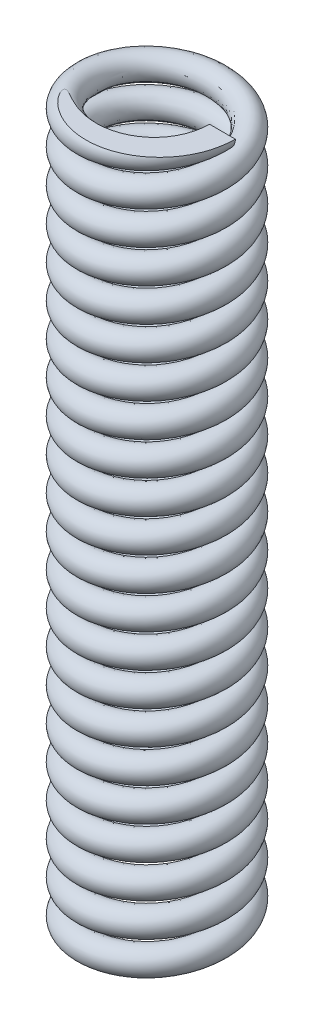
ISO-10303-21;
HEADER;
FILE_DESCRIPTION(('STEP AP214'),'2;1');
FILE_NAME('part.step','',(''),(''),'','','');
FILE_SCHEMA(('AUTOMOTIVE_DESIGN { 1 0 10303 214 1 1 1 1 }'));
ENDSEC;
DATA;
#1=APPLICATION_CONTEXT('core data for automotive mechanical design processes');
#2=APPLICATION_PROTOCOL_DEFINITION('international standard','automotive_design',2000,#1);
#3=PRODUCT_CONTEXT('',#1,'mechanical');
#4=PRODUCT('Part','Part','',(#3));
#5=PRODUCT_RELATED_PRODUCT_CATEGORY('part','',(#4));
#6=PRODUCT_DEFINITION_FORMATION('','',#4);
#7=PRODUCT_DEFINITION_CONTEXT('part definition',#1,'design');
#8=PRODUCT_DEFINITION('design','',#6,#7);
#9=PRODUCT_DEFINITION_SHAPE('','',#8);
#10=(LENGTH_UNIT() NAMED_UNIT(*) SI_UNIT(.MILLI.,.METRE.));
#11=(NAMED_UNIT(*) PLANE_ANGLE_UNIT() SI_UNIT($,.RADIAN.));
#12=(NAMED_UNIT(*) SI_UNIT($,.STERADIAN.) SOLID_ANGLE_UNIT());
#13=UNCERTAINTY_MEASURE_WITH_UNIT(LENGTH_MEASURE(1.E-05),#10,'distance_accuracy_value','');
#14=(GEOMETRIC_REPRESENTATION_CONTEXT(3) GLOBAL_UNCERTAINTY_ASSIGNED_CONTEXT((#13)) GLOBAL_UNIT_ASSIGNED_CONTEXT((#10,
#11,#12)) REPRESENTATION_CONTEXT('',''));
#15=CARTESIAN_POINT('',(0.,0.,0.));
#16=DIRECTION('',(0.,0.,1.));
#17=DIRECTION('',(1.,0.,0.));
#18=AXIS2_PLACEMENT_3D('',#15,#16,#17);
#19=CARTESIAN_POINT('',(0.,0.,0.));
#20=DIRECTION('',(0.,0.,1.));
#21=DIRECTION('',(1.,0.,0.));
#22=AXIS2_PLACEMENT_3D('',#19,#20,#21);
#23=PLANE('',#22);
#24=DIRECTION('',(1.,0.,0.));
#25=VECTOR('',#24,1.);
#26=CARTESIAN_POINT('',(0.,0.,0.));
#27=LINE('',#26,#25);
#28=CARTESIAN_POINT('',(-0.5715,0.,0.));
#29=VERTEX_POINT('',#28);
#30=CARTESIAN_POINT('',(0.5715,0.,0.));
#31=VERTEX_POINT('',#30);
#32=EDGE_CURVE('E51',#29,#31,#27,.T.);
#33=ORIENTED_EDGE('',*,*,#32,.F.);
#34=CARTESIAN_POINT('',(0.,0.,0.));
#35=DIRECTION('',(0.,0.,1.));
#36=DIRECTION('',(1.,0.,0.));
#37=AXIS2_PLACEMENT_3D('',#34,#35,#36);
#38=CIRCLE('',#37,0.5715);
#39=EDGE_CURVE('E67',#31,#29,#38,.T.);
#40=ORIENTED_EDGE('',*,*,#39,.F.);
#41=EDGE_LOOP('',(#33,#40));
#42=FACE_BOUND('',#41,.T.);
#43=ADVANCED_FACE('F33',(#42),#23,.F.);
#44=CARTESIAN_POINT('',(0.5715,0.,0.));
#45=CARTESIAN_POINT('',(0.5715,0.12278381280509,1.34181976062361));
#46=CARTESIAN_POINT('',(1.73355,0.24556762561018,2.01272964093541));
#47=CARTESIAN_POINT('',(2.8956,0.36835143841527,2.68363952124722));
#48=CARTESIAN_POINT('',(4.05765,0.49113525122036,2.01272964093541));
#49=CARTESIAN_POINT('',(5.2197,0.613919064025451,1.34181976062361));
#50=CARTESIAN_POINT('',(5.2197,0.736702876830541,0.));
#51=CARTESIAN_POINT('',(5.2197,0.859486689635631,-1.34181976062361));
#52=CARTESIAN_POINT('',(4.05765,0.982270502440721,-2.01272964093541));
#53=CARTESIAN_POINT('',(2.8956,1.10505431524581,-2.68363952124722));
#54=CARTESIAN_POINT('',(1.73355,1.2278381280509,-2.01272964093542));
#55=CARTESIAN_POINT('',(0.571500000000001,1.35062194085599,-1.34181976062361));
#56=CARTESIAN_POINT('',(0.5715,1.47340575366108,0.));
#57=CARTESIAN_POINT('',(0.5715,1.59618956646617,1.34181976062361));
#58=CARTESIAN_POINT('',(1.73355,1.71897337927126,2.01272964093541));
#59=CARTESIAN_POINT('',(2.8956,1.84175719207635,2.68363952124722));
#60=CARTESIAN_POINT('',(4.05765,1.96454100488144,2.01272964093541));
#61=CARTESIAN_POINT('',(5.2197,2.08732481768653,1.34181976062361));
#62=CARTESIAN_POINT('',(5.2197,2.21010863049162,0.));
#63=CARTESIAN_POINT('',(5.2197,2.33289244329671,-1.34181976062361));
#64=CARTESIAN_POINT('',(4.05765,2.4556762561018,-2.01272964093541));
#65=CARTESIAN_POINT('',(2.8956,2.57846006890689,-2.68363952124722));
#66=CARTESIAN_POINT('',(1.73355,2.70124388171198,-2.01272964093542));
#67=CARTESIAN_POINT('',(0.571500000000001,2.82402769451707,-1.34181976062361));
#68=CARTESIAN_POINT('',(0.5715,2.94681150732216,0.));
#69=CARTESIAN_POINT('',(0.5715,3.06959532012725,1.34181976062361));
#70=CARTESIAN_POINT('',(1.73355,3.19237913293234,2.01272964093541));
#71=CARTESIAN_POINT('',(2.8956,3.31516294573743,2.68363952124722));
#72=CARTESIAN_POINT('',(4.05765,3.43794675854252,2.01272964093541));
#73=CARTESIAN_POINT('',(5.2197,3.56073057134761,1.34181976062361));
#74=CARTESIAN_POINT('',(5.2197,3.6835143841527,0.));
#75=CARTESIAN_POINT('',(5.2197,3.80629819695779,-1.34181976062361));
#76=CARTESIAN_POINT('',(4.05765,3.92908200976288,-2.01272964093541));
#77=CARTESIAN_POINT('',(2.8956,4.05186582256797,-2.68363952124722));
#78=CARTESIAN_POINT('',(1.73355,4.17464963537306,-2.01272964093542));
#79=CARTESIAN_POINT('',(0.571500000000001,4.29743344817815,-1.34181976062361));
#80=CARTESIAN_POINT('',(0.5715,4.42021726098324,0.));
#81=CARTESIAN_POINT('',(0.5715,4.54300107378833,1.34181976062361));
#82=CARTESIAN_POINT('',(1.73355,4.66578488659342,2.01272964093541));
#83=CARTESIAN_POINT('',(2.8956,4.78856869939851,2.68363952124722));
#84=CARTESIAN_POINT('',(4.05765,4.9113525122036,2.01272964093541));
#85=CARTESIAN_POINT('',(5.2197,5.03413632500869,1.34181976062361));
#86=CARTESIAN_POINT('',(5.2197,5.15692013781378,0.));
#87=CARTESIAN_POINT('',(5.2197,5.27970395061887,-1.34181976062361));
#88=CARTESIAN_POINT('',(4.05765,5.40248776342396,-2.01272964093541));
#89=CARTESIAN_POINT('',(2.8956,5.52527157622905,-2.68363952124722));
#90=CARTESIAN_POINT('',(1.73355,5.64805538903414,-2.01272964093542));
#91=CARTESIAN_POINT('',(0.571500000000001,5.77083920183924,-1.34181976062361));
#92=CARTESIAN_POINT('',(0.5715,5.89362301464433,0.));
#93=CARTESIAN_POINT('',(0.5715,6.01640682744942,1.34181976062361));
#94=CARTESIAN_POINT('',(1.73355,6.13919064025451,2.01272964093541));
#95=CARTESIAN_POINT('',(2.8956,6.2619744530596,2.68363952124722));
#96=CARTESIAN_POINT('',(4.05765,6.38475826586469,2.01272964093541));
#97=CARTESIAN_POINT('',(5.2197,6.50754207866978,1.34181976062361));
#98=CARTESIAN_POINT('',(5.2197,6.63032589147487,0.));
#99=CARTESIAN_POINT('',(5.2197,6.75310970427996,-1.34181976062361));
#100=CARTESIAN_POINT('',(4.05765,6.87589351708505,-2.01272964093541));
#101=CARTESIAN_POINT('',(2.8956,6.99867732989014,-2.68363952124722));
#102=CARTESIAN_POINT('',(1.73355,7.12146114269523,-2.01272964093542));
#103=CARTESIAN_POINT('',(0.571500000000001,7.24424495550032,-1.34181976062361));
#104=CARTESIAN_POINT('',(0.5715,7.36702876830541,0.));
#105=CARTESIAN_POINT('',(0.5715,7.4898125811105,1.34181976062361));
#106=CARTESIAN_POINT('',(1.73355,7.61259639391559,2.01272964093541));
#107=CARTESIAN_POINT('',(2.8956,7.73538020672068,2.68363952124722));
#108=CARTESIAN_POINT('',(4.05765,7.85816401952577,2.01272964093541));
#109=CARTESIAN_POINT('',(5.2197,7.98094783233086,1.34181976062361));
#110=CARTESIAN_POINT('',(5.2197,8.10373164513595,0.));
#111=CARTESIAN_POINT('',(5.2197,8.22651545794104,-1.34181976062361));
#112=CARTESIAN_POINT('',(4.05765,8.34929927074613,-2.01272964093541));
#113=CARTESIAN_POINT('',(2.8956,8.47208308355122,-2.68363952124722));
#114=CARTESIAN_POINT('',(1.73355,8.59486689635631,-2.01272964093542));
#115=CARTESIAN_POINT('',(0.571500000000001,8.7176507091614,-1.34181976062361));
#116=CARTESIAN_POINT('',(0.5715,8.84043452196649,0.));
#117=CARTESIAN_POINT('',(0.5715,8.96321833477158,1.34181976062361));
#118=CARTESIAN_POINT('',(1.73355,9.08600214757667,2.01272964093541));
#119=CARTESIAN_POINT('',(2.8956,9.20878596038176,2.68363952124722));
#120=CARTESIAN_POINT('',(4.05765,9.33156977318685,2.01272964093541));
#121=CARTESIAN_POINT('',(5.2197,9.45435358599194,1.34181976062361));
#122=CARTESIAN_POINT('',(5.2197,9.57713739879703,0.));
#123=CARTESIAN_POINT('',(5.2197,9.69992121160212,-1.34181976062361));
#124=CARTESIAN_POINT('',(4.05765,9.82270502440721,-2.01272964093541));
#125=CARTESIAN_POINT('',(2.8956,9.9454888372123,-2.68363952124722));
#126=CARTESIAN_POINT('',(1.73355,10.0682726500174,-2.01272964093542));
#127=CARTESIAN_POINT('',(0.571500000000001,10.1910564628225,-1.34181976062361));
#128=CARTESIAN_POINT('',(0.5715,10.3138402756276,0.));
#129=CARTESIAN_POINT('',(0.5715,10.4366240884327,1.34181976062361));
#130=CARTESIAN_POINT('',(1.73355,10.5594079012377,2.01272964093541));
#131=CARTESIAN_POINT('',(2.8956,10.6821917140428,2.68363952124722));
#132=CARTESIAN_POINT('',(4.05765,10.8049755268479,2.01272964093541));
#133=CARTESIAN_POINT('',(5.2197,10.927759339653,1.34181976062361));
#134=CARTESIAN_POINT('',(5.2197,11.0505431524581,0.));
#135=CARTESIAN_POINT('',(5.2197,11.1733269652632,-1.34181976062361));
#136=CARTESIAN_POINT('',(4.05765,11.2961107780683,-2.01272964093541));
#137=CARTESIAN_POINT('',(2.8956,11.4188945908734,-2.68363952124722));
#138=CARTESIAN_POINT('',(1.73355,11.5416784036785,-2.01272964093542));
#139=CARTESIAN_POINT('',(0.571500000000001,11.6644622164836,-1.34181976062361));
#140=CARTESIAN_POINT('',(0.5715,11.7872460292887,0.));
#141=CARTESIAN_POINT('',(0.5715,11.9100298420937,1.34181976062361));
#142=CARTESIAN_POINT('',(1.73355,12.0328136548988,2.01272964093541));
#143=CARTESIAN_POINT('',(2.8956,12.1555974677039,2.68363952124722));
#144=CARTESIAN_POINT('',(4.05765,12.278381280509,2.01272964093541));
#145=CARTESIAN_POINT('',(5.2197,12.4011650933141,1.34181976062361));
#146=CARTESIAN_POINT('',(5.2197,12.5239489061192,0.));
#147=CARTESIAN_POINT('',(5.2197,12.6467327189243,-1.34181976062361));
#148=CARTESIAN_POINT('',(4.05765,12.7695165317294,-2.01272964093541));
#149=CARTESIAN_POINT('',(2.8956,12.8923003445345,-2.68363952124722));
#150=CARTESIAN_POINT('',(1.73355,13.0150841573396,-2.01272964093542));
#151=CARTESIAN_POINT('',(0.571500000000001,13.1378679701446,-1.34181976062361));
#152=CARTESIAN_POINT('',(0.5715,13.2606517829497,0.));
#153=CARTESIAN_POINT('',(0.5715,13.3834355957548,1.34181976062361));
#154=CARTESIAN_POINT('',(1.73355,13.5062194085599,2.01272964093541));
#155=CARTESIAN_POINT('',(2.8956,13.629003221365,2.68363952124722));
#156=CARTESIAN_POINT('',(4.05765,13.7517870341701,2.01272964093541));
#157=CARTESIAN_POINT('',(5.2197,13.8745708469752,1.34181976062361));
#158=CARTESIAN_POINT('',(5.2197,13.9973546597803,0.));
#159=CARTESIAN_POINT('',(5.2197,14.1201384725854,-1.34181976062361));
#160=CARTESIAN_POINT('',(4.05765,14.2429222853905,-2.01272964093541));
#161=CARTESIAN_POINT('',(2.8956,14.3657060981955,-2.68363952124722));
#162=CARTESIAN_POINT('',(1.73355,14.4884899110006,-2.01272964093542));
#163=CARTESIAN_POINT('',(0.571500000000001,14.6112737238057,-1.34181976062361));
#164=CARTESIAN_POINT('',(0.5715,14.7340575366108,0.));
#165=CARTESIAN_POINT('',(0.5715,14.8568413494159,1.34181976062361));
#166=CARTESIAN_POINT('',(1.73355,14.979625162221,2.01272964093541));
#167=CARTESIAN_POINT('',(2.8956,15.1024089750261,2.68363952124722));
#168=CARTESIAN_POINT('',(4.05765,15.2251927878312,2.01272964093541));
#169=CARTESIAN_POINT('',(5.2197,15.3479766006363,1.34181976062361));
#170=CARTESIAN_POINT('',(5.2197,15.4707604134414,0.));
#171=CARTESIAN_POINT('',(5.2197,15.5935442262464,-1.34181976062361));
#172=CARTESIAN_POINT('',(4.05765,15.7163280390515,-2.01272964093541));
#173=CARTESIAN_POINT('',(2.8956,15.8391118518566,-2.68363952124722));
#174=CARTESIAN_POINT('',(1.73355,15.9618956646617,-2.01272964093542));
#175=CARTESIAN_POINT('',(0.571500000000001,16.0846794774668,-1.34181976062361));
#176=CARTESIAN_POINT('',(0.5715,16.2074632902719,0.));
#177=CARTESIAN_POINT('',(0.5715,16.330247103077,1.34181976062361));
#178=CARTESIAN_POINT('',(1.73355,16.4530309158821,2.01272964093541));
#179=CARTESIAN_POINT('',(2.8956,16.5758147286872,2.68363952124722));
#180=CARTESIAN_POINT('',(4.05765,16.6985985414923,2.01272964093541));
#181=CARTESIAN_POINT('',(5.2197,16.8213823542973,1.34181976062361));
#182=CARTESIAN_POINT('',(5.2197,16.9441661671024,0.));
#183=CARTESIAN_POINT('',(5.2197,17.0669499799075,-1.34181976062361));
#184=CARTESIAN_POINT('',(4.05765,17.1897337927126,-2.01272964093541));
#185=CARTESIAN_POINT('',(2.8956,17.3125176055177,-2.68363952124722));
#186=CARTESIAN_POINT('',(1.73355,17.4353014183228,-2.01272964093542));
#187=CARTESIAN_POINT('',(0.571500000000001,17.5580852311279,-1.34181976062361));
#188=CARTESIAN_POINT('',(0.5715,17.680869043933,0.));
#189=CARTESIAN_POINT('',(0.5715,17.8036528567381,1.34181976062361));
#190=CARTESIAN_POINT('',(1.73355,17.9264366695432,2.01272964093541));
#191=CARTESIAN_POINT('',(2.8956,18.0492204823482,2.68363952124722));
#192=CARTESIAN_POINT('',(4.05765,18.1720042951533,2.01272964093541));
#193=CARTESIAN_POINT('',(5.2197,18.2947881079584,1.34181976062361));
#194=CARTESIAN_POINT('',(5.2197,18.4175719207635,0.));
#195=CARTESIAN_POINT('',(5.2197,18.5403557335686,-1.34181976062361));
#196=CARTESIAN_POINT('',(4.05765,18.6631395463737,-2.01272964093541));
#197=CARTESIAN_POINT('',(2.8956,18.7859233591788,-2.68363952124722));
#198=CARTESIAN_POINT('',(1.73355,18.9087071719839,-2.01272964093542));
#199=CARTESIAN_POINT('',(0.571500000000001,19.031490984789,-1.34181976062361));
#200=CARTESIAN_POINT('',(0.5715,19.1542747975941,0.));
#201=CARTESIAN_POINT('',(0.5715,19.2770586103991,1.34181976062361));
#202=CARTESIAN_POINT('',(1.73355,19.3998424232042,2.01272964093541));
#203=CARTESIAN_POINT('',(2.8956,19.5226262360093,2.68363952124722));
#204=CARTESIAN_POINT('',(4.05765,19.6454100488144,2.01272964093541));
#205=CARTESIAN_POINT('',(5.2197,19.7681938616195,1.34181976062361));
#206=CARTESIAN_POINT('',(5.2197,19.8909776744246,0.));
#207=CARTESIAN_POINT('',(5.2197,20.0137614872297,-1.34181976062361));
#208=CARTESIAN_POINT('',(4.05765,20.1365453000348,-2.01272964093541));
#209=CARTESIAN_POINT('',(2.8956,20.2593291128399,-2.68363952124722));
#210=CARTESIAN_POINT('',(1.73355,20.382112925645,-2.01272964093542));
#211=CARTESIAN_POINT('',(0.571500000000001,20.5048967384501,-1.34181976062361));
#212=CARTESIAN_POINT('',(0.5715,20.6276805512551,0.));
#213=CARTESIAN_POINT('',(0.5715,20.7504643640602,1.34181976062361));
#214=CARTESIAN_POINT('',(1.73355,20.8732481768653,2.01272964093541));
#215=CARTESIAN_POINT('',(2.8956,20.9960319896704,2.68363952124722));
#216=CARTESIAN_POINT('',(4.05765,21.1188158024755,2.01272964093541));
#217=CARTESIAN_POINT('',(5.2197,21.2415996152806,1.34181976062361));
#218=CARTESIAN_POINT('',(5.2197,21.3643834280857,0.));
#219=CARTESIAN_POINT('',(5.2197,21.4871672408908,-1.34181976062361));
#220=CARTESIAN_POINT('',(4.05765,21.6099510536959,-2.01272964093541));
#221=CARTESIAN_POINT('',(2.8956,21.732734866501,-2.68363952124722));
#222=CARTESIAN_POINT('',(1.73355,21.855518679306,-2.01272964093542));
#223=CARTESIAN_POINT('',(0.571500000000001,21.9783024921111,-1.34181976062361));
#224=CARTESIAN_POINT('',(0.5715,22.1010863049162,0.));
#225=CARTESIAN_POINT('',(0.5715,22.2238701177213,1.34181976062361));
#226=CARTESIAN_POINT('',(1.73355,22.3466539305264,2.01272964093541));
#227=CARTESIAN_POINT('',(2.8956,22.4694377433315,2.68363952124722));
#228=CARTESIAN_POINT('',(4.05765,22.5922215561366,2.01272964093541));
#229=CARTESIAN_POINT('',(5.2197,22.7150053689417,1.34181976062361));
#230=CARTESIAN_POINT('',(5.2197,22.8377891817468,0.));
#231=CARTESIAN_POINT('',(5.2197,22.9605729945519,-1.34181976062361));
#232=CARTESIAN_POINT('',(4.05765,23.0833568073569,-2.01272964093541));
#233=CARTESIAN_POINT('',(2.8956,23.206140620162,-2.68363952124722));
#234=CARTESIAN_POINT('',(1.73355,23.3289244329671,-2.01272964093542));
#235=CARTESIAN_POINT('',(0.571500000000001,23.4517082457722,-1.34181976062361));
#236=CARTESIAN_POINT('',(0.5715,23.5744920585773,0.));
#237=CARTESIAN_POINT('',(0.5715,23.6972758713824,1.34181976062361));
#238=CARTESIAN_POINT('',(1.73355,23.8200596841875,2.01272964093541));
#239=CARTESIAN_POINT('',(2.8956,23.9428434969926,2.68363952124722));
#240=CARTESIAN_POINT('',(4.05765,24.0656273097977,2.01272964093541));
#241=CARTESIAN_POINT('',(5.2197,24.1884111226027,1.34181976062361));
#242=CARTESIAN_POINT('',(5.2197,24.3111949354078,0.));
#243=CARTESIAN_POINT('',(5.2197,24.4339787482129,-1.34181976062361));
#244=CARTESIAN_POINT('',(4.05765,24.556762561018,-2.01272964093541));
#245=CARTESIAN_POINT('',(2.8956,24.6795463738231,-2.68363952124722));
#246=CARTESIAN_POINT('',(1.73355,24.8023301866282,-2.01272964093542));
#247=CARTESIAN_POINT('',(0.571500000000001,24.9251139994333,-1.34181976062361));
#248=CARTESIAN_POINT('',(0.5715,25.0478978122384,0.));
#249=CARTESIAN_POINT('',(0.5715,25.1706816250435,1.34181976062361));
#250=CARTESIAN_POINT('',(1.73355,25.2934654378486,2.01272964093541));
#251=CARTESIAN_POINT('',(2.8956,25.4162492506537,2.68363952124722));
#252=CARTESIAN_POINT('',(4.05765,25.5390330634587,2.01272964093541));
#253=CARTESIAN_POINT('',(5.2197,25.6618168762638,1.34181976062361));
#254=CARTESIAN_POINT('',(5.2197,25.7846006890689,0.));
#255=CARTESIAN_POINT('',(5.2197,25.907384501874,-1.34181976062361));
#256=CARTESIAN_POINT('',(4.05765,26.0301683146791,-2.01272964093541));
#257=CARTESIAN_POINT('',(2.8956,26.1529521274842,-2.68363952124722));
#258=CARTESIAN_POINT('',(1.73355,26.2757359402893,-2.01272964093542));
#259=CARTESIAN_POINT('',(0.571500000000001,26.3985197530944,-1.34181976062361));
#260=CARTESIAN_POINT('',(0.5715,26.5213035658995,0.));
#261=CARTESIAN_POINT('',(0.5715,26.6440873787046,1.34181976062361));
#262=CARTESIAN_POINT('',(1.73355,26.7668711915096,2.01272964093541));
#263=CARTESIAN_POINT('',(2.8956,26.8896550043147,2.68363952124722));
#264=CARTESIAN_POINT('',(4.05765,27.0124388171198,2.01272964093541));
#265=CARTESIAN_POINT('',(5.2197,27.1352226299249,1.34181976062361));
#266=CARTESIAN_POINT('',(5.2197,27.25800644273,0.));
#267=CARTESIAN_POINT('',(5.2197,27.3807902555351,-1.34181976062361));
#268=CARTESIAN_POINT('',(4.05765,27.5035740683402,-2.01272964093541));
#269=CARTESIAN_POINT('',(2.8956,27.6263578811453,-2.68363952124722));
#270=CARTESIAN_POINT('',(1.73355,27.7491416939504,-2.01272964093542));
#271=CARTESIAN_POINT('',(0.571500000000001,27.8719255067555,-1.34181976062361));
#272=CARTESIAN_POINT('',(0.5715,27.9947093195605,0.));
#273=CARTESIAN_POINT('',(0.5715,28.1174931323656,1.34181976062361));
#274=CARTESIAN_POINT('',(1.73355,28.2402769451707,2.01272964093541));
#275=CARTESIAN_POINT('',(2.8956,28.3630607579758,2.68363952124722));
#276=CARTESIAN_POINT('',(4.05765,28.4858445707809,2.01272964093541));
#277=CARTESIAN_POINT('',(5.2197,28.608628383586,1.34181976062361));
#278=CARTESIAN_POINT('',(5.2197,28.7314121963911,0.));
#279=CARTESIAN_POINT('',(5.2197,28.8541960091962,-1.34181976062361));
#280=CARTESIAN_POINT('',(4.05765,28.9769798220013,-2.01272964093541));
#281=CARTESIAN_POINT('',(2.8956,29.0997636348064,-2.68363952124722));
#282=CARTESIAN_POINT('',(1.73355,29.2225474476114,-2.01272964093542));
#283=CARTESIAN_POINT('',(0.571500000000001,29.3453312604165,-1.34181976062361));
#284=CARTESIAN_POINT('',(0.5715,29.4681150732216,0.));
#285=CARTESIAN_POINT('',(0.5715,29.5908988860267,1.34181976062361));
#286=CARTESIAN_POINT('',(1.73355,29.7136826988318,2.01272964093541));
#287=CARTESIAN_POINT('',(2.8956,29.8364665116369,2.68363952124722));
#288=CARTESIAN_POINT('',(4.05765,29.959250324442,2.01272964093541));
#289=CARTESIAN_POINT('',(5.2197,30.0820341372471,1.34181976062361));
#290=CARTESIAN_POINT('',(5.2197,30.2048179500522,0.));
#291=CARTESIAN_POINT('',(5.2197,30.3276017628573,-1.34181976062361));
#292=CARTESIAN_POINT('',(4.05765,30.4503855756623,-2.01272964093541));
#293=CARTESIAN_POINT('',(2.8956,30.5731693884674,-2.68363952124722));
#294=CARTESIAN_POINT('',(1.73355,30.6959532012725,-2.01272964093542));
#295=CARTESIAN_POINT('',(0.571500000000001,30.8187370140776,-1.34181976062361));
#296=CARTESIAN_POINT('',(0.5715,30.9415208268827,0.));
#297=CARTESIAN_POINT('',(0.5715,31.0643046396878,1.34181976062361));
#298=CARTESIAN_POINT('',(1.73355,31.1870884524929,2.01272964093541));
#299=CARTESIAN_POINT('',(2.8956,31.309872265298,2.68363952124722));
#300=CARTESIAN_POINT('',(4.05765,31.4326560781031,2.01272964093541));
#301=CARTESIAN_POINT('',(5.2197,31.5554398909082,1.34181976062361));
#302=CARTESIAN_POINT('',(5.2197,31.6782237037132,0.));
#303=CARTESIAN_POINT('',(5.2197,31.8010075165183,-1.34181976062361));
#304=CARTESIAN_POINT('',(4.05765,31.9237913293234,-2.01272964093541));
#305=CARTESIAN_POINT('',(2.8956,32.0465751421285,-2.68363952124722));
#306=CARTESIAN_POINT('',(1.73355,32.1693589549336,-2.01272964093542));
#307=CARTESIAN_POINT('',(0.571500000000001,32.2921427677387,-1.34181976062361));
#308=CARTESIAN_POINT('',(0.5715,32.4149265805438,0.));
#309=CARTESIAN_POINT('',(0.5715,1.143,0.));
#310=CARTESIAN_POINT('',(0.5715,1.26578381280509,1.34181976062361));
#311=CARTESIAN_POINT('',(1.73355,1.38856762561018,2.01272964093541));
#312=CARTESIAN_POINT('',(2.8956,1.51135143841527,2.68363952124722));
#313=CARTESIAN_POINT('',(4.05765,1.63413525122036,2.01272964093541));
#314=CARTESIAN_POINT('',(5.2197,1.75691906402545,1.34181976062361));
#315=CARTESIAN_POINT('',(5.2197,1.87970287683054,0.));
#316=CARTESIAN_POINT('',(5.2197,2.00248668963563,-1.34181976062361));
#317=CARTESIAN_POINT('',(4.05765,2.12527050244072,-2.01272964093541));
#318=CARTESIAN_POINT('',(2.8956,2.24805431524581,-2.68363952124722));
#319=CARTESIAN_POINT('',(1.73355,2.3708381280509,-2.01272964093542));
#320=CARTESIAN_POINT('',(0.571500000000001,2.49362194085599,-1.34181976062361));
#321=CARTESIAN_POINT('',(0.5715,2.61640575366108,0.));
#322=CARTESIAN_POINT('',(0.5715,2.73918956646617,1.34181976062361));
#323=CARTESIAN_POINT('',(1.73355,2.86197337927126,2.01272964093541));
#324=CARTESIAN_POINT('',(2.8956,2.98475719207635,2.68363952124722));
#325=CARTESIAN_POINT('',(4.05765,3.10754100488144,2.01272964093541));
#326=CARTESIAN_POINT('',(5.2197,3.23032481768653,1.34181976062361));
#327=CARTESIAN_POINT('',(5.2197,3.35310863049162,0.));
#328=CARTESIAN_POINT('',(5.2197,3.47589244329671,-1.34181976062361));
#329=CARTESIAN_POINT('',(4.05765,3.5986762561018,-2.01272964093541));
#330=CARTESIAN_POINT('',(2.8956,3.72146006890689,-2.68363952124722));
#331=CARTESIAN_POINT('',(1.73355,3.84424388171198,-2.01272964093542));
#332=CARTESIAN_POINT('',(0.571500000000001,3.96702769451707,-1.34181976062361));
#333=CARTESIAN_POINT('',(0.5715,4.08981150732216,0.));
#334=CARTESIAN_POINT('',(0.5715,4.21259532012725,1.34181976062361));
#335=CARTESIAN_POINT('',(1.73355,4.33537913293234,2.01272964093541));
#336=CARTESIAN_POINT('',(2.8956,4.45816294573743,2.68363952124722));
#337=CARTESIAN_POINT('',(4.05765,4.58094675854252,2.01272964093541));
#338=CARTESIAN_POINT('',(5.2197,4.70373057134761,1.34181976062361));
#339=CARTESIAN_POINT('',(5.2197,4.8265143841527,0.));
#340=CARTESIAN_POINT('',(5.2197,4.94929819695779,-1.34181976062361));
#341=CARTESIAN_POINT('',(4.05765,5.07208200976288,-2.01272964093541));
#342=CARTESIAN_POINT('',(2.8956,5.19486582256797,-2.68363952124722));
#343=CARTESIAN_POINT('',(1.73355,5.31764963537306,-2.01272964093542));
#344=CARTESIAN_POINT('',(0.571500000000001,5.44043344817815,-1.34181976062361));
#345=CARTESIAN_POINT('',(0.5715,5.56321726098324,0.));
#346=CARTESIAN_POINT('',(0.5715,5.68600107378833,1.34181976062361));
#347=CARTESIAN_POINT('',(1.73355,5.80878488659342,2.01272964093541));
#348=CARTESIAN_POINT('',(2.8956,5.93156869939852,2.68363952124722));
#349=CARTESIAN_POINT('',(4.05765,6.0543525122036,2.01272964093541));
#350=CARTESIAN_POINT('',(5.2197,6.17713632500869,1.34181976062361));
#351=CARTESIAN_POINT('',(5.2197,6.29992013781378,0.));
#352=CARTESIAN_POINT('',(5.2197,6.42270395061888,-1.34181976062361));
#353=CARTESIAN_POINT('',(4.05765,6.54548776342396,-2.01272964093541));
#354=CARTESIAN_POINT('',(2.8956,6.66827157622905,-2.68363952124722));
#355=CARTESIAN_POINT('',(1.73355,6.79105538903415,-2.01272964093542));
#356=CARTESIAN_POINT('',(0.571500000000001,6.91383920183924,-1.34181976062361));
#357=CARTESIAN_POINT('',(0.5715,7.03662301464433,0.));
#358=CARTESIAN_POINT('',(0.5715,7.15940682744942,1.34181976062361));
#359=CARTESIAN_POINT('',(1.73355,7.28219064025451,2.01272964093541));
#360=CARTESIAN_POINT('',(2.8956,7.4049744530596,2.68363952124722));
#361=CARTESIAN_POINT('',(4.05765,7.52775826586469,2.01272964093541));
#362=CARTESIAN_POINT('',(5.2197,7.65054207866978,1.34181976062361));
#363=CARTESIAN_POINT('',(5.2197,7.77332589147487,0.));
#364=CARTESIAN_POINT('',(5.2197,7.89610970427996,-1.34181976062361));
#365=CARTESIAN_POINT('',(4.05765,8.01889351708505,-2.01272964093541));
#366=CARTESIAN_POINT('',(2.8956,8.14167732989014,-2.68363952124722));
#367=CARTESIAN_POINT('',(1.73355,8.26446114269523,-2.01272964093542));
#368=CARTESIAN_POINT('',(0.571500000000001,8.38724495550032,-1.34181976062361));
#369=CARTESIAN_POINT('',(0.5715,8.51002876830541,0.));
#370=CARTESIAN_POINT('',(0.5715,8.6328125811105,1.34181976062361));
#371=CARTESIAN_POINT('',(1.73355,8.75559639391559,2.01272964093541));
#372=CARTESIAN_POINT('',(2.8956,8.87838020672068,2.68363952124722));
#373=CARTESIAN_POINT('',(4.05765,9.00116401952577,2.01272964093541));
#374=CARTESIAN_POINT('',(5.2197,9.12394783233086,1.34181976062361));
#375=CARTESIAN_POINT('',(5.2197,9.24673164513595,0.));
#376=CARTESIAN_POINT('',(5.2197,9.36951545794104,-1.34181976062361));
#377=CARTESIAN_POINT('',(4.05765,9.49229927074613,-2.01272964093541));
#378=CARTESIAN_POINT('',(2.8956,9.61508308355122,-2.68363952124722));
#379=CARTESIAN_POINT('',(1.73355,9.73786689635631,-2.01272964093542));
#380=CARTESIAN_POINT('',(0.571500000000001,9.8606507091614,-1.34181976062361));
#381=CARTESIAN_POINT('',(0.5715,9.98343452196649,0.));
#382=CARTESIAN_POINT('',(0.5715,10.1062183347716,1.34181976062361));
#383=CARTESIAN_POINT('',(1.73355,10.2290021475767,2.01272964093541));
#384=CARTESIAN_POINT('',(2.8956,10.3517859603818,2.68363952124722));
#385=CARTESIAN_POINT('',(4.05765,10.4745697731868,2.01272964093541));
#386=CARTESIAN_POINT('',(5.2197,10.5973535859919,1.34181976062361));
#387=CARTESIAN_POINT('',(5.2197,10.720137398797,0.));
#388=CARTESIAN_POINT('',(5.2197,10.8429212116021,-1.34181976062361));
#389=CARTESIAN_POINT('',(4.05765,10.9657050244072,-2.01272964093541));
#390=CARTESIAN_POINT('',(2.8956,11.0884888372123,-2.68363952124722));
#391=CARTESIAN_POINT('',(1.73355,11.2112726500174,-2.01272964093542));
#392=CARTESIAN_POINT('',(0.571500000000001,11.3340564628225,-1.34181976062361));
#393=CARTESIAN_POINT('',(0.5715,11.4568402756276,0.));
#394=CARTESIAN_POINT('',(0.5715,11.5796240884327,1.34181976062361));
#395=CARTESIAN_POINT('',(1.73355,11.7024079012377,2.01272964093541));
#396=CARTESIAN_POINT('',(2.8956,11.8251917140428,2.68363952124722));
#397=CARTESIAN_POINT('',(4.05765,11.9479755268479,2.01272964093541));
#398=CARTESIAN_POINT('',(5.2197,12.070759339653,1.34181976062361));
#399=CARTESIAN_POINT('',(5.2197,12.1935431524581,0.));
#400=CARTESIAN_POINT('',(5.2197,12.3163269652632,-1.34181976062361));
#401=CARTESIAN_POINT('',(4.05765,12.4391107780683,-2.01272964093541));
#402=CARTESIAN_POINT('',(2.8956,12.5618945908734,-2.68363952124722));
#403=CARTESIAN_POINT('',(1.73355,12.6846784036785,-2.01272964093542));
#404=CARTESIAN_POINT('',(0.571500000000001,12.8074622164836,-1.34181976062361));
#405=CARTESIAN_POINT('',(0.5715,12.9302460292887,0.));
#406=CARTESIAN_POINT('',(0.5715,13.0530298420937,1.34181976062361));
#407=CARTESIAN_POINT('',(1.73355,13.1758136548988,2.01272964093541));
#408=CARTESIAN_POINT('',(2.8956,13.2985974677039,2.68363952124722));
#409=CARTESIAN_POINT('',(4.05765,13.421381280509,2.01272964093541));
#410=CARTESIAN_POINT('',(5.2197,13.5441650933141,1.34181976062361));
#411=CARTESIAN_POINT('',(5.2197,13.6669489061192,0.));
#412=CARTESIAN_POINT('',(5.2197,13.7897327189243,-1.34181976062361));
#413=CARTESIAN_POINT('',(4.05765,13.9125165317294,-2.01272964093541));
#414=CARTESIAN_POINT('',(2.8956,14.0353003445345,-2.68363952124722));
#415=CARTESIAN_POINT('',(1.73355,14.1580841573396,-2.01272964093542));
#416=CARTESIAN_POINT('',(0.571500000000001,14.2808679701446,-1.34181976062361));
#417=CARTESIAN_POINT('',(0.5715,14.4036517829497,0.));
#418=CARTESIAN_POINT('',(0.5715,14.5264355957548,1.34181976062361));
#419=CARTESIAN_POINT('',(1.73355,14.6492194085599,2.01272964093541));
#420=CARTESIAN_POINT('',(2.8956,14.772003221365,2.68363952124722));
#421=CARTESIAN_POINT('',(4.05765,14.8947870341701,2.01272964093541));
#422=CARTESIAN_POINT('',(5.2197,15.0175708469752,1.34181976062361));
#423=CARTESIAN_POINT('',(5.2197,15.1403546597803,0.));
#424=CARTESIAN_POINT('',(5.2197,15.2631384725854,-1.34181976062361));
#425=CARTESIAN_POINT('',(4.05765,15.3859222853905,-2.01272964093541));
#426=CARTESIAN_POINT('',(2.8956,15.5087060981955,-2.68363952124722));
#427=CARTESIAN_POINT('',(1.73355,15.6314899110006,-2.01272964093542));
#428=CARTESIAN_POINT('',(0.571500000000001,15.7542737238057,-1.34181976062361));
#429=CARTESIAN_POINT('',(0.5715,15.8770575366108,0.));
#430=CARTESIAN_POINT('',(0.5715,15.9998413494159,1.34181976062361));
#431=CARTESIAN_POINT('',(1.73355,16.122625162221,2.01272964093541));
#432=CARTESIAN_POINT('',(2.8956,16.2454089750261,2.68363952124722));
#433=CARTESIAN_POINT('',(4.05765,16.3681927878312,2.01272964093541));
#434=CARTESIAN_POINT('',(5.2197,16.4909766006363,1.34181976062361));
#435=CARTESIAN_POINT('',(5.2197,16.6137604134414,0.));
#436=CARTESIAN_POINT('',(5.2197,16.7365442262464,-1.34181976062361));
#437=CARTESIAN_POINT('',(4.05765,16.8593280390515,-2.01272964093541));
#438=CARTESIAN_POINT('',(2.8956,16.9821118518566,-2.68363952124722));
#439=CARTESIAN_POINT('',(1.73355,17.1048956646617,-2.01272964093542));
#440=CARTESIAN_POINT('',(0.571500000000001,17.2276794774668,-1.34181976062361));
#441=CARTESIAN_POINT('',(0.5715,17.3504632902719,0.));
#442=CARTESIAN_POINT('',(0.5715,17.473247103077,1.34181976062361));
#443=CARTESIAN_POINT('',(1.73355,17.5960309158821,2.01272964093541));
#444=CARTESIAN_POINT('',(2.8956,17.7188147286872,2.68363952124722));
#445=CARTESIAN_POINT('',(4.05765,17.8415985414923,2.01272964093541));
#446=CARTESIAN_POINT('',(5.2197,17.9643823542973,1.34181976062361));
#447=CARTESIAN_POINT('',(5.2197,18.0871661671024,0.));
#448=CARTESIAN_POINT('',(5.2197,18.2099499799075,-1.34181976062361));
#449=CARTESIAN_POINT('',(4.05765,18.3327337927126,-2.01272964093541));
#450=CARTESIAN_POINT('',(2.8956,18.4555176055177,-2.68363952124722));
#451=CARTESIAN_POINT('',(1.73355,18.5783014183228,-2.01272964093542));
#452=CARTESIAN_POINT('',(0.571500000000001,18.7010852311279,-1.34181976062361));
#453=CARTESIAN_POINT('',(0.5715,18.823869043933,0.));
#454=CARTESIAN_POINT('',(0.5715,18.9466528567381,1.34181976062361));
#455=CARTESIAN_POINT('',(1.73355,19.0694366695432,2.01272964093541));
#456=CARTESIAN_POINT('',(2.8956,19.1922204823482,2.68363952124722));
#457=CARTESIAN_POINT('',(4.05765,19.3150042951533,2.01272964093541));
#458=CARTESIAN_POINT('',(5.2197,19.4377881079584,1.34181976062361));
#459=CARTESIAN_POINT('',(5.2197,19.5605719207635,0.));
#460=CARTESIAN_POINT('',(5.2197,19.6833557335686,-1.34181976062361));
#461=CARTESIAN_POINT('',(4.05765,19.8061395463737,-2.01272964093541));
#462=CARTESIAN_POINT('',(2.8956,19.9289233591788,-2.68363952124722));
#463=CARTESIAN_POINT('',(1.73355,20.0517071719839,-2.01272964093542));
#464=CARTESIAN_POINT('',(0.571500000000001,20.174490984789,-1.34181976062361));
#465=CARTESIAN_POINT('',(0.5715,20.2972747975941,0.));
#466=CARTESIAN_POINT('',(0.5715,20.4200586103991,1.34181976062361));
#467=CARTESIAN_POINT('',(1.73355,20.5428424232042,2.01272964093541));
#468=CARTESIAN_POINT('',(2.8956,20.6656262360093,2.68363952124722));
#469=CARTESIAN_POINT('',(4.05765,20.7884100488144,2.01272964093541));
#470=CARTESIAN_POINT('',(5.2197,20.9111938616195,1.34181976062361));
#471=CARTESIAN_POINT('',(5.2197,21.0339776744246,0.));
#472=CARTESIAN_POINT('',(5.2197,21.1567614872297,-1.34181976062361));
#473=CARTESIAN_POINT('',(4.05765,21.2795453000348,-2.01272964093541));
#474=CARTESIAN_POINT('',(2.8956,21.4023291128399,-2.68363952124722));
#475=CARTESIAN_POINT('',(1.73355,21.525112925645,-2.01272964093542));
#476=CARTESIAN_POINT('',(0.571500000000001,21.64789673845,-1.34181976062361));
#477=CARTESIAN_POINT('',(0.5715,21.7706805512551,0.));
#478=CARTESIAN_POINT('',(0.5715,21.8934643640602,1.34181976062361));
#479=CARTESIAN_POINT('',(1.73355,22.0162481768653,2.01272964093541));
#480=CARTESIAN_POINT('',(2.8956,22.1390319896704,2.68363952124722));
#481=CARTESIAN_POINT('',(4.05765,22.2618158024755,2.01272964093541));
#482=CARTESIAN_POINT('',(5.2197,22.3845996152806,1.34181976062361));
#483=CARTESIAN_POINT('',(5.2197,22.5073834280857,0.));
#484=CARTESIAN_POINT('',(5.2197,22.6301672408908,-1.34181976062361));
#485=CARTESIAN_POINT('',(4.05765,22.7529510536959,-2.01272964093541));
#486=CARTESIAN_POINT('',(2.8956,22.8757348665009,-2.68363952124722));
#487=CARTESIAN_POINT('',(1.73355,22.998518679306,-2.01272964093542));
#488=CARTESIAN_POINT('',(0.571500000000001,23.1213024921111,-1.34181976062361));
#489=CARTESIAN_POINT('',(0.5715,23.2440863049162,0.));
#490=CARTESIAN_POINT('',(0.5715,23.3668701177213,1.34181976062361));
#491=CARTESIAN_POINT('',(1.73355,23.4896539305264,2.01272964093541));
#492=CARTESIAN_POINT('',(2.8956,23.6124377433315,2.68363952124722));
#493=CARTESIAN_POINT('',(4.05765,23.7352215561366,2.01272964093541));
#494=CARTESIAN_POINT('',(5.2197,23.8580053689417,1.34181976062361));
#495=CARTESIAN_POINT('',(5.2197,23.9807891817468,0.));
#496=CARTESIAN_POINT('',(5.2197,24.1035729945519,-1.34181976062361));
#497=CARTESIAN_POINT('',(4.05765,24.2263568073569,-2.01272964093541));
#498=CARTESIAN_POINT('',(2.8956,24.349140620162,-2.68363952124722));
#499=CARTESIAN_POINT('',(1.73355,24.4719244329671,-2.01272964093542));
#500=CARTESIAN_POINT('',(0.571500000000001,24.5947082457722,-1.34181976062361));
#501=CARTESIAN_POINT('',(0.5715,24.7174920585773,0.));
#502=CARTESIAN_POINT('',(0.5715,24.8402758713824,1.34181976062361));
#503=CARTESIAN_POINT('',(1.73355,24.9630596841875,2.01272964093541));
#504=CARTESIAN_POINT('',(2.8956,25.0858434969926,2.68363952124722));
#505=CARTESIAN_POINT('',(4.05765,25.2086273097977,2.01272964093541));
#506=CARTESIAN_POINT('',(5.2197,25.3314111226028,1.34181976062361));
#507=CARTESIAN_POINT('',(5.2197,25.4541949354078,0.));
#508=CARTESIAN_POINT('',(5.2197,25.5769787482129,-1.34181976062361));
#509=CARTESIAN_POINT('',(4.05765,25.699762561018,-2.01272964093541));
#510=CARTESIAN_POINT('',(2.8956,25.8225463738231,-2.68363952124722));
#511=CARTESIAN_POINT('',(1.73355,25.9453301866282,-2.01272964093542));
#512=CARTESIAN_POINT('',(0.571500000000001,26.0681139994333,-1.34181976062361));
#513=CARTESIAN_POINT('',(0.5715,26.1908978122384,0.));
#514=CARTESIAN_POINT('',(0.5715,26.3136816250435,1.34181976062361));
#515=CARTESIAN_POINT('',(1.73355,26.4364654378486,2.01272964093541));
#516=CARTESIAN_POINT('',(2.8956,26.5592492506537,2.68363952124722));
#517=CARTESIAN_POINT('',(4.05765,26.6820330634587,2.01272964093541));
#518=CARTESIAN_POINT('',(5.2197,26.8048168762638,1.34181976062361));
#519=CARTESIAN_POINT('',(5.2197,26.9276006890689,0.));
#520=CARTESIAN_POINT('',(5.2197,27.050384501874,-1.34181976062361));
#521=CARTESIAN_POINT('',(4.05765,27.1731683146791,-2.01272964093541));
#522=CARTESIAN_POINT('',(2.8956,27.2959521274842,-2.68363952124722));
#523=CARTESIAN_POINT('',(1.73355,27.4187359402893,-2.01272964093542));
#524=CARTESIAN_POINT('',(0.571500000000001,27.5415197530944,-1.34181976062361));
#525=CARTESIAN_POINT('',(0.5715,27.6643035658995,0.));
#526=CARTESIAN_POINT('',(0.5715,27.7870873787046,1.34181976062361));
#527=CARTESIAN_POINT('',(1.73355,27.9098711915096,2.01272964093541));
#528=CARTESIAN_POINT('',(2.8956,28.0326550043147,2.68363952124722));
#529=CARTESIAN_POINT('',(4.05765,28.1554388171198,2.01272964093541));
#530=CARTESIAN_POINT('',(5.2197,28.2782226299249,1.34181976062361));
#531=CARTESIAN_POINT('',(5.2197,28.40100644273,0.));
#532=CARTESIAN_POINT('',(5.2197,28.5237902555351,-1.34181976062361));
#533=CARTESIAN_POINT('',(4.05765,28.6465740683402,-2.01272964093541));
#534=CARTESIAN_POINT('',(2.8956,28.7693578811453,-2.68363952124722));
#535=CARTESIAN_POINT('',(1.73355,28.8921416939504,-2.01272964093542));
#536=CARTESIAN_POINT('',(0.571500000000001,29.0149255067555,-1.34181976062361));
#537=CARTESIAN_POINT('',(0.5715,29.1377093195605,0.));
#538=CARTESIAN_POINT('',(0.5715,29.2604931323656,1.34181976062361));
#539=CARTESIAN_POINT('',(1.73355,29.3832769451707,2.01272964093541));
#540=CARTESIAN_POINT('',(2.8956,29.5060607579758,2.68363952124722));
#541=CARTESIAN_POINT('',(4.05765,29.6288445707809,2.01272964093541));
#542=CARTESIAN_POINT('',(5.2197,29.751628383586,1.34181976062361));
#543=CARTESIAN_POINT('',(5.2197,29.8744121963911,0.));
#544=CARTESIAN_POINT('',(5.2197,29.9971960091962,-1.34181976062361));
#545=CARTESIAN_POINT('',(4.05765,30.1199798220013,-2.01272964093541));
#546=CARTESIAN_POINT('',(2.8956,30.2427636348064,-2.68363952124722));
#547=CARTESIAN_POINT('',(1.73355,30.3655474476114,-2.01272964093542));
#548=CARTESIAN_POINT('',(0.571500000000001,30.4883312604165,-1.34181976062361));
#549=CARTESIAN_POINT('',(0.5715,30.6111150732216,0.));
#550=CARTESIAN_POINT('',(0.5715,30.7338988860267,1.34181976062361));
#551=CARTESIAN_POINT('',(1.73355,30.8566826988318,2.01272964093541));
#552=CARTESIAN_POINT('',(2.8956,30.9794665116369,2.68363952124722));
#553=CARTESIAN_POINT('',(4.05765,31.102250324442,2.01272964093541));
#554=CARTESIAN_POINT('',(5.2197,31.2250341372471,1.34181976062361));
#555=CARTESIAN_POINT('',(5.2197,31.3478179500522,0.));
#556=CARTESIAN_POINT('',(5.2197,31.4706017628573,-1.34181976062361));
#557=CARTESIAN_POINT('',(4.05765,31.5933855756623,-2.01272964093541));
#558=CARTESIAN_POINT('',(2.8956,31.7161693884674,-2.68363952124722));
#559=CARTESIAN_POINT('',(1.73355,31.8389532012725,-2.01272964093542));
#560=CARTESIAN_POINT('',(0.571500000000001,31.9617370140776,-1.34181976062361));
#561=CARTESIAN_POINT('',(0.5715,32.0845208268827,0.));
#562=CARTESIAN_POINT('',(0.5715,32.2073046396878,1.34181976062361));
#563=CARTESIAN_POINT('',(1.73355,32.3300884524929,2.01272964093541));
#564=CARTESIAN_POINT('',(2.8956,32.452872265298,2.68363952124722));
#565=CARTESIAN_POINT('',(4.05765,32.5756560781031,2.01272964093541));
#566=CARTESIAN_POINT('',(5.2197,32.6984398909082,1.34181976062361));
#567=CARTESIAN_POINT('',(5.2197,32.8212237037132,0.));
#568=CARTESIAN_POINT('',(5.2197,32.9440075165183,-1.34181976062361));
#569=CARTESIAN_POINT('',(4.05765,33.0667913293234,-2.01272964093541));
#570=CARTESIAN_POINT('',(2.8956,33.1895751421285,-2.68363952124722));
#571=CARTESIAN_POINT('',(1.73355,33.3123589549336,-2.01272964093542));
#572=CARTESIAN_POINT('',(0.571500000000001,33.4351427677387,-1.34181976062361));
#573=CARTESIAN_POINT('',(0.5715,33.5579265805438,0.));
#574=CARTESIAN_POINT('',(-0.5715,1.143,0.));
#575=CARTESIAN_POINT('',(-0.5715,1.26578381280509,2.00173111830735));
#576=CARTESIAN_POINT('',(1.16205,1.38856762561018,3.00259667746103));
#577=CARTESIAN_POINT('',(2.8956,1.51135143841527,4.0034622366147));
#578=CARTESIAN_POINT('',(4.62915,1.63413525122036,3.00259667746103));
#579=CARTESIAN_POINT('',(6.3627,1.75691906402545,2.00173111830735));
#580=CARTESIAN_POINT('',(6.3627,1.87970287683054,0.));
#581=CARTESIAN_POINT('',(6.3627,2.00248668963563,-2.00173111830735));
#582=CARTESIAN_POINT('',(4.62915,2.12527050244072,-3.00259667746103));
#583=CARTESIAN_POINT('',(2.8956,2.24805431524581,-4.0034622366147));
#584=CARTESIAN_POINT('',(1.16205,2.3708381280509,-3.00259667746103));
#585=CARTESIAN_POINT('',(-0.571499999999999,2.49362194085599,-2.00173111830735));
#586=CARTESIAN_POINT('',(-0.5715,2.61640575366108,0.));
#587=CARTESIAN_POINT('',(-0.5715,2.73918956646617,2.00173111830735));
#588=CARTESIAN_POINT('',(1.16205,2.86197337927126,3.00259667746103));
#589=CARTESIAN_POINT('',(2.8956,2.98475719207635,4.0034622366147));
#590=CARTESIAN_POINT('',(4.62915,3.10754100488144,3.00259667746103));
#591=CARTESIAN_POINT('',(6.3627,3.23032481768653,2.00173111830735));
#592=CARTESIAN_POINT('',(6.3627,3.35310863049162,0.));
#593=CARTESIAN_POINT('',(6.3627,3.47589244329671,-2.00173111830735));
#594=CARTESIAN_POINT('',(4.62915,3.5986762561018,-3.00259667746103));
#595=CARTESIAN_POINT('',(2.8956,3.72146006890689,-4.0034622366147));
#596=CARTESIAN_POINT('',(1.16205,3.84424388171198,-3.00259667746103));
#597=CARTESIAN_POINT('',(-0.571499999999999,3.96702769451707,-2.00173111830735));
#598=CARTESIAN_POINT('',(-0.5715,4.08981150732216,0.));
#599=CARTESIAN_POINT('',(-0.5715,4.21259532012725,2.00173111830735));
#600=CARTESIAN_POINT('',(1.16205,4.33537913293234,3.00259667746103));
#601=CARTESIAN_POINT('',(2.8956,4.45816294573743,4.0034622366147));
#602=CARTESIAN_POINT('',(4.62915,4.58094675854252,3.00259667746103));
#603=CARTESIAN_POINT('',(6.3627,4.70373057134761,2.00173111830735));
#604=CARTESIAN_POINT('',(6.3627,4.8265143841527,0.));
#605=CARTESIAN_POINT('',(6.3627,4.94929819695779,-2.00173111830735));
#606=CARTESIAN_POINT('',(4.62915,5.07208200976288,-3.00259667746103));
#607=CARTESIAN_POINT('',(2.8956,5.19486582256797,-4.0034622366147));
#608=CARTESIAN_POINT('',(1.16205,5.31764963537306,-3.00259667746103));
#609=CARTESIAN_POINT('',(-0.571499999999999,5.44043344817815,-2.00173111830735));
#610=CARTESIAN_POINT('',(-0.5715,5.56321726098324,0.));
#611=CARTESIAN_POINT('',(-0.5715,5.68600107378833,2.00173111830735));
#612=CARTESIAN_POINT('',(1.16205,5.80878488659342,3.00259667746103));
#613=CARTESIAN_POINT('',(2.8956,5.93156869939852,4.0034622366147));
#614=CARTESIAN_POINT('',(4.62915,6.0543525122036,3.00259667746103));
#615=CARTESIAN_POINT('',(6.3627,6.17713632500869,2.00173111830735));
#616=CARTESIAN_POINT('',(6.3627,6.29992013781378,0.));
#617=CARTESIAN_POINT('',(6.3627,6.42270395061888,-2.00173111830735));
#618=CARTESIAN_POINT('',(4.62915,6.54548776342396,-3.00259667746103));
#619=CARTESIAN_POINT('',(2.8956,6.66827157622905,-4.0034622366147));
#620=CARTESIAN_POINT('',(1.16205,6.79105538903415,-3.00259667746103));
#621=CARTESIAN_POINT('',(-0.571499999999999,6.91383920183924,-2.00173111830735));
#622=CARTESIAN_POINT('',(-0.5715,7.03662301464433,0.));
#623=CARTESIAN_POINT('',(-0.5715,7.15940682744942,2.00173111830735));
#624=CARTESIAN_POINT('',(1.16205,7.28219064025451,3.00259667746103));
#625=CARTESIAN_POINT('',(2.8956,7.4049744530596,4.0034622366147));
#626=CARTESIAN_POINT('',(4.62915,7.52775826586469,3.00259667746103));
#627=CARTESIAN_POINT('',(6.3627,7.65054207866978,2.00173111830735));
#628=CARTESIAN_POINT('',(6.3627,7.77332589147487,0.));
#629=CARTESIAN_POINT('',(6.3627,7.89610970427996,-2.00173111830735));
#630=CARTESIAN_POINT('',(4.62915,8.01889351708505,-3.00259667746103));
#631=CARTESIAN_POINT('',(2.8956,8.14167732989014,-4.0034622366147));
#632=CARTESIAN_POINT('',(1.16205,8.26446114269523,-3.00259667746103));
#633=CARTESIAN_POINT('',(-0.571499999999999,8.38724495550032,-2.00173111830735));
#634=CARTESIAN_POINT('',(-0.5715,8.51002876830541,0.));
#635=CARTESIAN_POINT('',(-0.5715,8.6328125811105,2.00173111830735));
#636=CARTESIAN_POINT('',(1.16205,8.75559639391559,3.00259667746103));
#637=CARTESIAN_POINT('',(2.8956,8.87838020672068,4.0034622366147));
#638=CARTESIAN_POINT('',(4.62915,9.00116401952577,3.00259667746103));
#639=CARTESIAN_POINT('',(6.3627,9.12394783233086,2.00173111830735));
#640=CARTESIAN_POINT('',(6.3627,9.24673164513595,0.));
#641=CARTESIAN_POINT('',(6.3627,9.36951545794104,-2.00173111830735));
#642=CARTESIAN_POINT('',(4.62915,9.49229927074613,-3.00259667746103));
#643=CARTESIAN_POINT('',(2.8956,9.61508308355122,-4.0034622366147));
#644=CARTESIAN_POINT('',(1.16205,9.73786689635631,-3.00259667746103));
#645=CARTESIAN_POINT('',(-0.571499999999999,9.8606507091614,-2.00173111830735));
#646=CARTESIAN_POINT('',(-0.5715,9.98343452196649,0.));
#647=CARTESIAN_POINT('',(-0.5715,10.1062183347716,2.00173111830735));
#648=CARTESIAN_POINT('',(1.16205,10.2290021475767,3.00259667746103));
#649=CARTESIAN_POINT('',(2.8956,10.3517859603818,4.0034622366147));
#650=CARTESIAN_POINT('',(4.62915,10.4745697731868,3.00259667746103));
#651=CARTESIAN_POINT('',(6.3627,10.5973535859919,2.00173111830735));
#652=CARTESIAN_POINT('',(6.3627,10.720137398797,0.));
#653=CARTESIAN_POINT('',(6.3627,10.8429212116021,-2.00173111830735));
#654=CARTESIAN_POINT('',(4.62915,10.9657050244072,-3.00259667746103));
#655=CARTESIAN_POINT('',(2.8956,11.0884888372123,-4.0034622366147));
#656=CARTESIAN_POINT('',(1.16205,11.2112726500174,-3.00259667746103));
#657=CARTESIAN_POINT('',(-0.571499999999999,11.3340564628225,-2.00173111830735));
#658=CARTESIAN_POINT('',(-0.5715,11.4568402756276,0.));
#659=CARTESIAN_POINT('',(-0.5715,11.5796240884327,2.00173111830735));
#660=CARTESIAN_POINT('',(1.16205,11.7024079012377,3.00259667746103));
#661=CARTESIAN_POINT('',(2.8956,11.8251917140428,4.0034622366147));
#662=CARTESIAN_POINT('',(4.62915,11.9479755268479,3.00259667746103));
#663=CARTESIAN_POINT('',(6.3627,12.070759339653,2.00173111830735));
#664=CARTESIAN_POINT('',(6.3627,12.1935431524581,0.));
#665=CARTESIAN_POINT('',(6.3627,12.3163269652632,-2.00173111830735));
#666=CARTESIAN_POINT('',(4.62915,12.4391107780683,-3.00259667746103));
#667=CARTESIAN_POINT('',(2.8956,12.5618945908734,-4.0034622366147));
#668=CARTESIAN_POINT('',(1.16205,12.6846784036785,-3.00259667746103));
#669=CARTESIAN_POINT('',(-0.571499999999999,12.8074622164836,-2.00173111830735));
#670=CARTESIAN_POINT('',(-0.5715,12.9302460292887,0.));
#671=CARTESIAN_POINT('',(-0.5715,13.0530298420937,2.00173111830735));
#672=CARTESIAN_POINT('',(1.16205,13.1758136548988,3.00259667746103));
#673=CARTESIAN_POINT('',(2.8956,13.2985974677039,4.0034622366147));
#674=CARTESIAN_POINT('',(4.62915,13.421381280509,3.00259667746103));
#675=CARTESIAN_POINT('',(6.3627,13.5441650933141,2.00173111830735));
#676=CARTESIAN_POINT('',(6.3627,13.6669489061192,0.));
#677=CARTESIAN_POINT('',(6.3627,13.7897327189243,-2.00173111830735));
#678=CARTESIAN_POINT('',(4.62915,13.9125165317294,-3.00259667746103));
#679=CARTESIAN_POINT('',(2.8956,14.0353003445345,-4.0034622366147));
#680=CARTESIAN_POINT('',(1.16205,14.1580841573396,-3.00259667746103));
#681=CARTESIAN_POINT('',(-0.571499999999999,14.2808679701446,-2.00173111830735));
#682=CARTESIAN_POINT('',(-0.5715,14.4036517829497,0.));
#683=CARTESIAN_POINT('',(-0.5715,14.5264355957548,2.00173111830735));
#684=CARTESIAN_POINT('',(1.16205,14.6492194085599,3.00259667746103));
#685=CARTESIAN_POINT('',(2.8956,14.772003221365,4.0034622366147));
#686=CARTESIAN_POINT('',(4.62915,14.8947870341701,3.00259667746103));
#687=CARTESIAN_POINT('',(6.3627,15.0175708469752,2.00173111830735));
#688=CARTESIAN_POINT('',(6.3627,15.1403546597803,0.));
#689=CARTESIAN_POINT('',(6.3627,15.2631384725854,-2.00173111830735));
#690=CARTESIAN_POINT('',(4.62915,15.3859222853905,-3.00259667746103));
#691=CARTESIAN_POINT('',(2.8956,15.5087060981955,-4.0034622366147));
#692=CARTESIAN_POINT('',(1.16205,15.6314899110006,-3.00259667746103));
#693=CARTESIAN_POINT('',(-0.571499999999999,15.7542737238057,-2.00173111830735));
#694=CARTESIAN_POINT('',(-0.5715,15.8770575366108,0.));
#695=CARTESIAN_POINT('',(-0.5715,15.9998413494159,2.00173111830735));
#696=CARTESIAN_POINT('',(1.16205,16.122625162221,3.00259667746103));
#697=CARTESIAN_POINT('',(2.8956,16.2454089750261,4.0034622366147));
#698=CARTESIAN_POINT('',(4.62915,16.3681927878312,3.00259667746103));
#699=CARTESIAN_POINT('',(6.3627,16.4909766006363,2.00173111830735));
#700=CARTESIAN_POINT('',(6.3627,16.6137604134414,0.));
#701=CARTESIAN_POINT('',(6.3627,16.7365442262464,-2.00173111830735));
#702=CARTESIAN_POINT('',(4.62915,16.8593280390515,-3.00259667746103));
#703=CARTESIAN_POINT('',(2.8956,16.9821118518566,-4.0034622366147));
#704=CARTESIAN_POINT('',(1.16205,17.1048956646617,-3.00259667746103));
#705=CARTESIAN_POINT('',(-0.571499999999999,17.2276794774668,-2.00173111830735));
#706=CARTESIAN_POINT('',(-0.5715,17.3504632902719,0.));
#707=CARTESIAN_POINT('',(-0.5715,17.473247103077,2.00173111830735));
#708=CARTESIAN_POINT('',(1.16205,17.5960309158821,3.00259667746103));
#709=CARTESIAN_POINT('',(2.8956,17.7188147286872,4.0034622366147));
#710=CARTESIAN_POINT('',(4.62915,17.8415985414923,3.00259667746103));
#711=CARTESIAN_POINT('',(6.3627,17.9643823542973,2.00173111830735));
#712=CARTESIAN_POINT('',(6.3627,18.0871661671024,0.));
#713=CARTESIAN_POINT('',(6.3627,18.2099499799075,-2.00173111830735));
#714=CARTESIAN_POINT('',(4.62915,18.3327337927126,-3.00259667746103));
#715=CARTESIAN_POINT('',(2.8956,18.4555176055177,-4.0034622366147));
#716=CARTESIAN_POINT('',(1.16205,18.5783014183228,-3.00259667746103));
#717=CARTESIAN_POINT('',(-0.571499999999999,18.7010852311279,-2.00173111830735));
#718=CARTESIAN_POINT('',(-0.5715,18.823869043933,0.));
#719=CARTESIAN_POINT('',(-0.5715,18.9466528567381,2.00173111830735));
#720=CARTESIAN_POINT('',(1.16205,19.0694366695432,3.00259667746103));
#721=CARTESIAN_POINT('',(2.8956,19.1922204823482,4.0034622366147));
#722=CARTESIAN_POINT('',(4.62915,19.3150042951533,3.00259667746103));
#723=CARTESIAN_POINT('',(6.3627,19.4377881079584,2.00173111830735));
#724=CARTESIAN_POINT('',(6.3627,19.5605719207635,0.));
#725=CARTESIAN_POINT('',(6.3627,19.6833557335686,-2.00173111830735));
#726=CARTESIAN_POINT('',(4.62915,19.8061395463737,-3.00259667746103));
#727=CARTESIAN_POINT('',(2.8956,19.9289233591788,-4.0034622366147));
#728=CARTESIAN_POINT('',(1.16205,20.0517071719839,-3.00259667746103));
#729=CARTESIAN_POINT('',(-0.571499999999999,20.174490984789,-2.00173111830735));
#730=CARTESIAN_POINT('',(-0.5715,20.2972747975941,0.));
#731=CARTESIAN_POINT('',(-0.5715,20.4200586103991,2.00173111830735));
#732=CARTESIAN_POINT('',(1.16205,20.5428424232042,3.00259667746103));
#733=CARTESIAN_POINT('',(2.8956,20.6656262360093,4.0034622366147));
#734=CARTESIAN_POINT('',(4.62915,20.7884100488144,3.00259667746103));
#735=CARTESIAN_POINT('',(6.3627,20.9111938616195,2.00173111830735));
#736=CARTESIAN_POINT('',(6.3627,21.0339776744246,0.));
#737=CARTESIAN_POINT('',(6.3627,21.1567614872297,-2.00173111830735));
#738=CARTESIAN_POINT('',(4.62915,21.2795453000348,-3.00259667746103));
#739=CARTESIAN_POINT('',(2.8956,21.4023291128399,-4.0034622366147));
#740=CARTESIAN_POINT('',(1.16205,21.525112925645,-3.00259667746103));
#741=CARTESIAN_POINT('',(-0.571499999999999,21.64789673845,-2.00173111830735));
#742=CARTESIAN_POINT('',(-0.5715,21.7706805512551,0.));
#743=CARTESIAN_POINT('',(-0.5715,21.8934643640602,2.00173111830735));
#744=CARTESIAN_POINT('',(1.16205,22.0162481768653,3.00259667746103));
#745=CARTESIAN_POINT('',(2.8956,22.1390319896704,4.0034622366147));
#746=CARTESIAN_POINT('',(4.62915,22.2618158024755,3.00259667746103));
#747=CARTESIAN_POINT('',(6.3627,22.3845996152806,2.00173111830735));
#748=CARTESIAN_POINT('',(6.3627,22.5073834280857,0.));
#749=CARTESIAN_POINT('',(6.3627,22.6301672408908,-2.00173111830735));
#750=CARTESIAN_POINT('',(4.62915,22.7529510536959,-3.00259667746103));
#751=CARTESIAN_POINT('',(2.8956,22.8757348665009,-4.0034622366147));
#752=CARTESIAN_POINT('',(1.16205,22.998518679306,-3.00259667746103));
#753=CARTESIAN_POINT('',(-0.571499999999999,23.1213024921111,-2.00173111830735));
#754=CARTESIAN_POINT('',(-0.5715,23.2440863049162,0.));
#755=CARTESIAN_POINT('',(-0.5715,23.3668701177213,2.00173111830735));
#756=CARTESIAN_POINT('',(1.16205,23.4896539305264,3.00259667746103));
#757=CARTESIAN_POINT('',(2.8956,23.6124377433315,4.0034622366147));
#758=CARTESIAN_POINT('',(4.62915,23.7352215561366,3.00259667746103));
#759=CARTESIAN_POINT('',(6.3627,23.8580053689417,2.00173111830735));
#760=CARTESIAN_POINT('',(6.3627,23.9807891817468,0.));
#761=CARTESIAN_POINT('',(6.3627,24.1035729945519,-2.00173111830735));
#762=CARTESIAN_POINT('',(4.62915,24.2263568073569,-3.00259667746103));
#763=CARTESIAN_POINT('',(2.8956,24.349140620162,-4.0034622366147));
#764=CARTESIAN_POINT('',(1.16205,24.4719244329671,-3.00259667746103));
#765=CARTESIAN_POINT('',(-0.571499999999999,24.5947082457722,-2.00173111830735));
#766=CARTESIAN_POINT('',(-0.5715,24.7174920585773,0.));
#767=CARTESIAN_POINT('',(-0.5715,24.8402758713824,2.00173111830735));
#768=CARTESIAN_POINT('',(1.16205,24.9630596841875,3.00259667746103));
#769=CARTESIAN_POINT('',(2.8956,25.0858434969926,4.0034622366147));
#770=CARTESIAN_POINT('',(4.62915,25.2086273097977,3.00259667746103));
#771=CARTESIAN_POINT('',(6.3627,25.3314111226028,2.00173111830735));
#772=CARTESIAN_POINT('',(6.3627,25.4541949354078,0.));
#773=CARTESIAN_POINT('',(6.3627,25.5769787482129,-2.00173111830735));
#774=CARTESIAN_POINT('',(4.62915,25.699762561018,-3.00259667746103));
#775=CARTESIAN_POINT('',(2.8956,25.8225463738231,-4.0034622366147));
#776=CARTESIAN_POINT('',(1.16205,25.9453301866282,-3.00259667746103));
#777=CARTESIAN_POINT('',(-0.571499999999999,26.0681139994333,-2.00173111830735));
#778=CARTESIAN_POINT('',(-0.5715,26.1908978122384,0.));
#779=CARTESIAN_POINT('',(-0.5715,26.3136816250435,2.00173111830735));
#780=CARTESIAN_POINT('',(1.16205,26.4364654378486,3.00259667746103));
#781=CARTESIAN_POINT('',(2.8956,26.5592492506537,4.0034622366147));
#782=CARTESIAN_POINT('',(4.62915,26.6820330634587,3.00259667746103));
#783=CARTESIAN_POINT('',(6.3627,26.8048168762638,2.00173111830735));
#784=CARTESIAN_POINT('',(6.3627,26.9276006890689,0.));
#785=CARTESIAN_POINT('',(6.3627,27.050384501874,-2.00173111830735));
#786=CARTESIAN_POINT('',(4.62915,27.1731683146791,-3.00259667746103));
#787=CARTESIAN_POINT('',(2.8956,27.2959521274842,-4.0034622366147));
#788=CARTESIAN_POINT('',(1.16205,27.4187359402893,-3.00259667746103));
#789=CARTESIAN_POINT('',(-0.571499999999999,27.5415197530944,-2.00173111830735));
#790=CARTESIAN_POINT('',(-0.5715,27.6643035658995,0.));
#791=CARTESIAN_POINT('',(-0.5715,27.7870873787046,2.00173111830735));
#792=CARTESIAN_POINT('',(1.16205,27.9098711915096,3.00259667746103));
#793=CARTESIAN_POINT('',(2.8956,28.0326550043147,4.0034622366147));
#794=CARTESIAN_POINT('',(4.62915,28.1554388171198,3.00259667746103));
#795=CARTESIAN_POINT('',(6.3627,28.2782226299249,2.00173111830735));
#796=CARTESIAN_POINT('',(6.3627,28.40100644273,0.));
#797=CARTESIAN_POINT('',(6.3627,28.5237902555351,-2.00173111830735));
#798=CARTESIAN_POINT('',(4.62915,28.6465740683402,-3.00259667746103));
#799=CARTESIAN_POINT('',(2.8956,28.7693578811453,-4.0034622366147));
#800=CARTESIAN_POINT('',(1.16205,28.8921416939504,-3.00259667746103));
#801=CARTESIAN_POINT('',(-0.571499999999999,29.0149255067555,-2.00173111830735));
#802=CARTESIAN_POINT('',(-0.5715,29.1377093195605,0.));
#803=CARTESIAN_POINT('',(-0.5715,29.2604931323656,2.00173111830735));
#804=CARTESIAN_POINT('',(1.16205,29.3832769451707,3.00259667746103));
#805=CARTESIAN_POINT('',(2.8956,29.5060607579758,4.0034622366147));
#806=CARTESIAN_POINT('',(4.62915,29.6288445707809,3.00259667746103));
#807=CARTESIAN_POINT('',(6.3627,29.751628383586,2.00173111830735));
#808=CARTESIAN_POINT('',(6.3627,29.8744121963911,0.));
#809=CARTESIAN_POINT('',(6.3627,29.9971960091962,-2.00173111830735));
#810=CARTESIAN_POINT('',(4.62915,30.1199798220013,-3.00259667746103));
#811=CARTESIAN_POINT('',(2.8956,30.2427636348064,-4.0034622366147));
#812=CARTESIAN_POINT('',(1.16205,30.3655474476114,-3.00259667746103));
#813=CARTESIAN_POINT('',(-0.571499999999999,30.4883312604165,-2.00173111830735));
#814=CARTESIAN_POINT('',(-0.5715,30.6111150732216,0.));
#815=CARTESIAN_POINT('',(-0.5715,30.7338988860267,2.00173111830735));
#816=CARTESIAN_POINT('',(1.16205,30.8566826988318,3.00259667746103));
#817=CARTESIAN_POINT('',(2.8956,30.9794665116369,4.0034622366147));
#818=CARTESIAN_POINT('',(4.62915,31.102250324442,3.00259667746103));
#819=CARTESIAN_POINT('',(6.3627,31.2250341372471,2.00173111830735));
#820=CARTESIAN_POINT('',(6.3627,31.3478179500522,0.));
#821=CARTESIAN_POINT('',(6.3627,31.4706017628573,-2.00173111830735));
#822=CARTESIAN_POINT('',(4.62915,31.5933855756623,-3.00259667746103));
#823=CARTESIAN_POINT('',(2.8956,31.7161693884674,-4.0034622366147));
#824=CARTESIAN_POINT('',(1.16205,31.8389532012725,-3.00259667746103));
#825=CARTESIAN_POINT('',(-0.571499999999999,31.9617370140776,-2.00173111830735));
#826=CARTESIAN_POINT('',(-0.5715,32.0845208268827,0.));
#827=CARTESIAN_POINT('',(-0.5715,32.2073046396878,2.00173111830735));
#828=CARTESIAN_POINT('',(1.16205,32.3300884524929,3.00259667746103));
#829=CARTESIAN_POINT('',(2.8956,32.452872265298,4.0034622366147));
#830=CARTESIAN_POINT('',(4.62915,32.5756560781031,3.00259667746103));
#831=CARTESIAN_POINT('',(6.3627,32.6984398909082,2.00173111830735));
#832=CARTESIAN_POINT('',(6.3627,32.8212237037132,0.));
#833=CARTESIAN_POINT('',(6.3627,32.9440075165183,-2.00173111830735));
#834=CARTESIAN_POINT('',(4.62915,33.0667913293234,-3.00259667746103));
#835=CARTESIAN_POINT('',(2.8956,33.1895751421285,-4.0034622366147));
#836=CARTESIAN_POINT('',(1.16205,33.3123589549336,-3.00259667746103));
#837=CARTESIAN_POINT('',(-0.571499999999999,33.4351427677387,-2.00173111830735));
#838=CARTESIAN_POINT('',(-0.5715,33.5579265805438,0.));
#839=CARTESIAN_POINT('',(-0.5715,0.,0.));
#840=CARTESIAN_POINT('',(-0.5715,0.12278381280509,2.00173111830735));
#841=CARTESIAN_POINT('',(1.16205,0.24556762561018,3.00259667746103));
#842=CARTESIAN_POINT('',(2.8956,0.36835143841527,4.0034622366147));
#843=CARTESIAN_POINT('',(4.62915,0.491135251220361,3.00259667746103));
#844=CARTESIAN_POINT('',(6.3627,0.613919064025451,2.00173111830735));
#845=CARTESIAN_POINT('',(6.3627,0.736702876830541,0.));
#846=CARTESIAN_POINT('',(6.3627,0.859486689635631,-2.00173111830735));
#847=CARTESIAN_POINT('',(4.62915,0.982270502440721,-3.00259667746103));
#848=CARTESIAN_POINT('',(2.8956,1.10505431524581,-4.0034622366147));
#849=CARTESIAN_POINT('',(1.16205,1.2278381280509,-3.00259667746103));
#850=CARTESIAN_POINT('',(-0.571499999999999,1.35062194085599,-2.00173111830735));
#851=CARTESIAN_POINT('',(-0.5715,1.47340575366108,0.));
#852=CARTESIAN_POINT('',(-0.5715,1.59618956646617,2.00173111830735));
#853=CARTESIAN_POINT('',(1.16205,1.71897337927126,3.00259667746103));
#854=CARTESIAN_POINT('',(2.8956,1.84175719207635,4.0034622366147));
#855=CARTESIAN_POINT('',(4.62915,1.96454100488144,3.00259667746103));
#856=CARTESIAN_POINT('',(6.3627,2.08732481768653,2.00173111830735));
#857=CARTESIAN_POINT('',(6.3627,2.21010863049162,0.));
#858=CARTESIAN_POINT('',(6.3627,2.33289244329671,-2.00173111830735));
#859=CARTESIAN_POINT('',(4.62915,2.4556762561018,-3.00259667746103));
#860=CARTESIAN_POINT('',(2.8956,2.57846006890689,-4.0034622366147));
#861=CARTESIAN_POINT('',(1.16205,2.70124388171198,-3.00259667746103));
#862=CARTESIAN_POINT('',(-0.571499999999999,2.82402769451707,-2.00173111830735));
#863=CARTESIAN_POINT('',(-0.5715,2.94681150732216,0.));
#864=CARTESIAN_POINT('',(-0.5715,3.06959532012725,2.00173111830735));
#865=CARTESIAN_POINT('',(1.16205,3.19237913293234,3.00259667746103));
#866=CARTESIAN_POINT('',(2.8956,3.31516294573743,4.0034622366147));
#867=CARTESIAN_POINT('',(4.62915,3.43794675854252,3.00259667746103));
#868=CARTESIAN_POINT('',(6.3627,3.56073057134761,2.00173111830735));
#869=CARTESIAN_POINT('',(6.3627,3.6835143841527,0.));
#870=CARTESIAN_POINT('',(6.3627,3.80629819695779,-2.00173111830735));
#871=CARTESIAN_POINT('',(4.62915,3.92908200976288,-3.00259667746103));
#872=CARTESIAN_POINT('',(2.8956,4.05186582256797,-4.0034622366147));
#873=CARTESIAN_POINT('',(1.16205,4.17464963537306,-3.00259667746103));
#874=CARTESIAN_POINT('',(-0.571499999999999,4.29743344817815,-2.00173111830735));
#875=CARTESIAN_POINT('',(-0.5715,4.42021726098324,0.));
#876=CARTESIAN_POINT('',(-0.5715,4.54300107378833,2.00173111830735));
#877=CARTESIAN_POINT('',(1.16205,4.66578488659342,3.00259667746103));
#878=CARTESIAN_POINT('',(2.8956,4.78856869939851,4.0034622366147));
#879=CARTESIAN_POINT('',(4.62915,4.9113525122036,3.00259667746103));
#880=CARTESIAN_POINT('',(6.3627,5.03413632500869,2.00173111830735));
#881=CARTESIAN_POINT('',(6.3627,5.15692013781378,0.));
#882=CARTESIAN_POINT('',(6.3627,5.27970395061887,-2.00173111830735));
#883=CARTESIAN_POINT('',(4.62915,5.40248776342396,-3.00259667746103));
#884=CARTESIAN_POINT('',(2.8956,5.52527157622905,-4.0034622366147));
#885=CARTESIAN_POINT('',(1.16205,5.64805538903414,-3.00259667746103));
#886=CARTESIAN_POINT('',(-0.571499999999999,5.77083920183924,-2.00173111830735));
#887=CARTESIAN_POINT('',(-0.5715,5.89362301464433,0.));
#888=CARTESIAN_POINT('',(-0.5715,6.01640682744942,2.00173111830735));
#889=CARTESIAN_POINT('',(1.16205,6.13919064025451,3.00259667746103));
#890=CARTESIAN_POINT('',(2.8956,6.2619744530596,4.0034622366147));
#891=CARTESIAN_POINT('',(4.62915,6.38475826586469,3.00259667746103));
#892=CARTESIAN_POINT('',(6.3627,6.50754207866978,2.00173111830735));
#893=CARTESIAN_POINT('',(6.3627,6.63032589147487,0.));
#894=CARTESIAN_POINT('',(6.3627,6.75310970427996,-2.00173111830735));
#895=CARTESIAN_POINT('',(4.62915,6.87589351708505,-3.00259667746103));
#896=CARTESIAN_POINT('',(2.8956,6.99867732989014,-4.0034622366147));
#897=CARTESIAN_POINT('',(1.16205,7.12146114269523,-3.00259667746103));
#898=CARTESIAN_POINT('',(-0.571499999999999,7.24424495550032,-2.00173111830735));
#899=CARTESIAN_POINT('',(-0.5715,7.36702876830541,0.));
#900=CARTESIAN_POINT('',(-0.5715,7.4898125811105,2.00173111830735));
#901=CARTESIAN_POINT('',(1.16205,7.61259639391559,3.00259667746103));
#902=CARTESIAN_POINT('',(2.8956,7.73538020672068,4.0034622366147));
#903=CARTESIAN_POINT('',(4.62915,7.85816401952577,3.00259667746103));
#904=CARTESIAN_POINT('',(6.3627,7.98094783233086,2.00173111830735));
#905=CARTESIAN_POINT('',(6.3627,8.10373164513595,0.));
#906=CARTESIAN_POINT('',(6.3627,8.22651545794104,-2.00173111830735));
#907=CARTESIAN_POINT('',(4.62915,8.34929927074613,-3.00259667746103));
#908=CARTESIAN_POINT('',(2.8956,8.47208308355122,-4.0034622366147));
#909=CARTESIAN_POINT('',(1.16205,8.59486689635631,-3.00259667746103));
#910=CARTESIAN_POINT('',(-0.571499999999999,8.7176507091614,-2.00173111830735));
#911=CARTESIAN_POINT('',(-0.5715,8.84043452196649,0.));
#912=CARTESIAN_POINT('',(-0.5715,8.96321833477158,2.00173111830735));
#913=CARTESIAN_POINT('',(1.16205,9.08600214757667,3.00259667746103));
#914=CARTESIAN_POINT('',(2.8956,9.20878596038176,4.0034622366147));
#915=CARTESIAN_POINT('',(4.62915,9.33156977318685,3.00259667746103));
#916=CARTESIAN_POINT('',(6.3627,9.45435358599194,2.00173111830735));
#917=CARTESIAN_POINT('',(6.3627,9.57713739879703,0.));
#918=CARTESIAN_POINT('',(6.3627,9.69992121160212,-2.00173111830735));
#919=CARTESIAN_POINT('',(4.62915,9.82270502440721,-3.00259667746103));
#920=CARTESIAN_POINT('',(2.8956,9.9454888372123,-4.0034622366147));
#921=CARTESIAN_POINT('',(1.16205,10.0682726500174,-3.00259667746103));
#922=CARTESIAN_POINT('',(-0.571499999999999,10.1910564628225,-2.00173111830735));
#923=CARTESIAN_POINT('',(-0.5715,10.3138402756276,0.));
#924=CARTESIAN_POINT('',(-0.5715,10.4366240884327,2.00173111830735));
#925=CARTESIAN_POINT('',(1.16205,10.5594079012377,3.00259667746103));
#926=CARTESIAN_POINT('',(2.8956,10.6821917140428,4.0034622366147));
#927=CARTESIAN_POINT('',(4.62915,10.8049755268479,3.00259667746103));
#928=CARTESIAN_POINT('',(6.3627,10.927759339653,2.00173111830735));
#929=CARTESIAN_POINT('',(6.3627,11.0505431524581,0.));
#930=CARTESIAN_POINT('',(6.3627,11.1733269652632,-2.00173111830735));
#931=CARTESIAN_POINT('',(4.62915,11.2961107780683,-3.00259667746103));
#932=CARTESIAN_POINT('',(2.8956,11.4188945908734,-4.0034622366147));
#933=CARTESIAN_POINT('',(1.16205,11.5416784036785,-3.00259667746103));
#934=CARTESIAN_POINT('',(-0.571499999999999,11.6644622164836,-2.00173111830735));
#935=CARTESIAN_POINT('',(-0.5715,11.7872460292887,0.));
#936=CARTESIAN_POINT('',(-0.5715,11.9100298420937,2.00173111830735));
#937=CARTESIAN_POINT('',(1.16205,12.0328136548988,3.00259667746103));
#938=CARTESIAN_POINT('',(2.8956,12.1555974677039,4.0034622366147));
#939=CARTESIAN_POINT('',(4.62915,12.278381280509,3.00259667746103));
#940=CARTESIAN_POINT('',(6.3627,12.4011650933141,2.00173111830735));
#941=CARTESIAN_POINT('',(6.3627,12.5239489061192,0.));
#942=CARTESIAN_POINT('',(6.3627,12.6467327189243,-2.00173111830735));
#943=CARTESIAN_POINT('',(4.62915,12.7695165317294,-3.00259667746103));
#944=CARTESIAN_POINT('',(2.8956,12.8923003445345,-4.0034622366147));
#945=CARTESIAN_POINT('',(1.16205,13.0150841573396,-3.00259667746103));
#946=CARTESIAN_POINT('',(-0.571499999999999,13.1378679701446,-2.00173111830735));
#947=CARTESIAN_POINT('',(-0.5715,13.2606517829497,0.));
#948=CARTESIAN_POINT('',(-0.5715,13.3834355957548,2.00173111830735));
#949=CARTESIAN_POINT('',(1.16205,13.5062194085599,3.00259667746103));
#950=CARTESIAN_POINT('',(2.8956,13.629003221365,4.0034622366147));
#951=CARTESIAN_POINT('',(4.62915,13.7517870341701,3.00259667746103));
#952=CARTESIAN_POINT('',(6.3627,13.8745708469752,2.00173111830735));
#953=CARTESIAN_POINT('',(6.3627,13.9973546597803,0.));
#954=CARTESIAN_POINT('',(6.3627,14.1201384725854,-2.00173111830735));
#955=CARTESIAN_POINT('',(4.62915,14.2429222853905,-3.00259667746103));
#956=CARTESIAN_POINT('',(2.8956,14.3657060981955,-4.0034622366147));
#957=CARTESIAN_POINT('',(1.16205,14.4884899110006,-3.00259667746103));
#958=CARTESIAN_POINT('',(-0.571499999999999,14.6112737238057,-2.00173111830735));
#959=CARTESIAN_POINT('',(-0.5715,14.7340575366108,0.));
#960=CARTESIAN_POINT('',(-0.5715,14.8568413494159,2.00173111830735));
#961=CARTESIAN_POINT('',(1.16205,14.979625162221,3.00259667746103));
#962=CARTESIAN_POINT('',(2.8956,15.1024089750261,4.0034622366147));
#963=CARTESIAN_POINT('',(4.62915,15.2251927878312,3.00259667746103));
#964=CARTESIAN_POINT('',(6.3627,15.3479766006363,2.00173111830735));
#965=CARTESIAN_POINT('',(6.3627,15.4707604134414,0.));
#966=CARTESIAN_POINT('',(6.3627,15.5935442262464,-2.00173111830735));
#967=CARTESIAN_POINT('',(4.62915,15.7163280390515,-3.00259667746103));
#968=CARTESIAN_POINT('',(2.8956,15.8391118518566,-4.0034622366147));
#969=CARTESIAN_POINT('',(1.16205,15.9618956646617,-3.00259667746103));
#970=CARTESIAN_POINT('',(-0.571499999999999,16.0846794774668,-2.00173111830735));
#971=CARTESIAN_POINT('',(-0.5715,16.2074632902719,0.));
#972=CARTESIAN_POINT('',(-0.5715,16.330247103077,2.00173111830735));
#973=CARTESIAN_POINT('',(1.16205,16.4530309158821,3.00259667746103));
#974=CARTESIAN_POINT('',(2.8956,16.5758147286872,4.0034622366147));
#975=CARTESIAN_POINT('',(4.62915,16.6985985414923,3.00259667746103));
#976=CARTESIAN_POINT('',(6.3627,16.8213823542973,2.00173111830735));
#977=CARTESIAN_POINT('',(6.3627,16.9441661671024,0.));
#978=CARTESIAN_POINT('',(6.3627,17.0669499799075,-2.00173111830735));
#979=CARTESIAN_POINT('',(4.62915,17.1897337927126,-3.00259667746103));
#980=CARTESIAN_POINT('',(2.8956,17.3125176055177,-4.0034622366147));
#981=CARTESIAN_POINT('',(1.16205,17.4353014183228,-3.00259667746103));
#982=CARTESIAN_POINT('',(-0.571499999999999,17.5580852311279,-2.00173111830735));
#983=CARTESIAN_POINT('',(-0.5715,17.680869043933,0.));
#984=CARTESIAN_POINT('',(-0.5715,17.8036528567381,2.00173111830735));
#985=CARTESIAN_POINT('',(1.16205,17.9264366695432,3.00259667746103));
#986=CARTESIAN_POINT('',(2.8956,18.0492204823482,4.0034622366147));
#987=CARTESIAN_POINT('',(4.62915,18.1720042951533,3.00259667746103));
#988=CARTESIAN_POINT('',(6.3627,18.2947881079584,2.00173111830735));
#989=CARTESIAN_POINT('',(6.3627,18.4175719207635,0.));
#990=CARTESIAN_POINT('',(6.3627,18.5403557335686,-2.00173111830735));
#991=CARTESIAN_POINT('',(4.62915,18.6631395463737,-3.00259667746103));
#992=CARTESIAN_POINT('',(2.8956,18.7859233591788,-4.0034622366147));
#993=CARTESIAN_POINT('',(1.16205,18.9087071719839,-3.00259667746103));
#994=CARTESIAN_POINT('',(-0.571499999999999,19.031490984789,-2.00173111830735));
#995=CARTESIAN_POINT('',(-0.5715,19.1542747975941,0.));
#996=CARTESIAN_POINT('',(-0.5715,19.2770586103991,2.00173111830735));
#997=CARTESIAN_POINT('',(1.16205,19.3998424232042,3.00259667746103));
#998=CARTESIAN_POINT('',(2.8956,19.5226262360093,4.0034622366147));
#999=CARTESIAN_POINT('',(4.62915,19.6454100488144,3.00259667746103));
#1000=CARTESIAN_POINT('',(6.3627,19.7681938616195,2.00173111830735));
#1001=CARTESIAN_POINT('',(6.3627,19.8909776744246,0.));
#1002=CARTESIAN_POINT('',(6.3627,20.0137614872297,-2.00173111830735));
#1003=CARTESIAN_POINT('',(4.62915,20.1365453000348,-3.00259667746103));
#1004=CARTESIAN_POINT('',(2.8956,20.2593291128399,-4.0034622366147));
#1005=CARTESIAN_POINT('',(1.16205,20.382112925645,-3.00259667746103));
#1006=CARTESIAN_POINT('',(-0.571499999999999,20.5048967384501,-2.00173111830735));
#1007=CARTESIAN_POINT('',(-0.5715,20.6276805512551,0.));
#1008=CARTESIAN_POINT('',(-0.5715,20.7504643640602,2.00173111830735));
#1009=CARTESIAN_POINT('',(1.16205,20.8732481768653,3.00259667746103));
#1010=CARTESIAN_POINT('',(2.8956,20.9960319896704,4.0034622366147));
#1011=CARTESIAN_POINT('',(4.62915,21.1188158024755,3.00259667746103));
#1012=CARTESIAN_POINT('',(6.3627,21.2415996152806,2.00173111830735));
#1013=CARTESIAN_POINT('',(6.3627,21.3643834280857,0.));
#1014=CARTESIAN_POINT('',(6.3627,21.4871672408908,-2.00173111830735));
#1015=CARTESIAN_POINT('',(4.62915,21.6099510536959,-3.00259667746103));
#1016=CARTESIAN_POINT('',(2.8956,21.732734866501,-4.0034622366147));
#1017=CARTESIAN_POINT('',(1.16205,21.855518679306,-3.00259667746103));
#1018=CARTESIAN_POINT('',(-0.571499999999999,21.9783024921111,-2.00173111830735));
#1019=CARTESIAN_POINT('',(-0.5715,22.1010863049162,0.));
#1020=CARTESIAN_POINT('',(-0.5715,22.2238701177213,2.00173111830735));
#1021=CARTESIAN_POINT('',(1.16205,22.3466539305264,3.00259667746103));
#1022=CARTESIAN_POINT('',(2.8956,22.4694377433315,4.0034622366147));
#1023=CARTESIAN_POINT('',(4.62915,22.5922215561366,3.00259667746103));
#1024=CARTESIAN_POINT('',(6.3627,22.7150053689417,2.00173111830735));
#1025=CARTESIAN_POINT('',(6.3627,22.8377891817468,0.));
#1026=CARTESIAN_POINT('',(6.3627,22.9605729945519,-2.00173111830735));
#1027=CARTESIAN_POINT('',(4.62915,23.0833568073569,-3.00259667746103));
#1028=CARTESIAN_POINT('',(2.8956,23.206140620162,-4.0034622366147));
#1029=CARTESIAN_POINT('',(1.16205,23.3289244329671,-3.00259667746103));
#1030=CARTESIAN_POINT('',(-0.571499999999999,23.4517082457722,-2.00173111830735));
#1031=CARTESIAN_POINT('',(-0.5715,23.5744920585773,0.));
#1032=CARTESIAN_POINT('',(-0.5715,23.6972758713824,2.00173111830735));
#1033=CARTESIAN_POINT('',(1.16205,23.8200596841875,3.00259667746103));
#1034=CARTESIAN_POINT('',(2.8956,23.9428434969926,4.0034622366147));
#1035=CARTESIAN_POINT('',(4.62915,24.0656273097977,3.00259667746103));
#1036=CARTESIAN_POINT('',(6.3627,24.1884111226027,2.00173111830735));
#1037=CARTESIAN_POINT('',(6.3627,24.3111949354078,0.));
#1038=CARTESIAN_POINT('',(6.3627,24.4339787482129,-2.00173111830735));
#1039=CARTESIAN_POINT('',(4.62915,24.556762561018,-3.00259667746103));
#1040=CARTESIAN_POINT('',(2.8956,24.6795463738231,-4.0034622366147));
#1041=CARTESIAN_POINT('',(1.16205,24.8023301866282,-3.00259667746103));
#1042=CARTESIAN_POINT('',(-0.571499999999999,24.9251139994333,-2.00173111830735));
#1043=CARTESIAN_POINT('',(-0.5715,25.0478978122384,0.));
#1044=CARTESIAN_POINT('',(-0.5715,25.1706816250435,2.00173111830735));
#1045=CARTESIAN_POINT('',(1.16205,25.2934654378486,3.00259667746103));
#1046=CARTESIAN_POINT('',(2.8956,25.4162492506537,4.0034622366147));
#1047=CARTESIAN_POINT('',(4.62915,25.5390330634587,3.00259667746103));
#1048=CARTESIAN_POINT('',(6.3627,25.6618168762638,2.00173111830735));
#1049=CARTESIAN_POINT('',(6.3627,25.7846006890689,0.));
#1050=CARTESIAN_POINT('',(6.3627,25.907384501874,-2.00173111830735));
#1051=CARTESIAN_POINT('',(4.62915,26.0301683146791,-3.00259667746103));
#1052=CARTESIAN_POINT('',(2.8956,26.1529521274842,-4.0034622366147));
#1053=CARTESIAN_POINT('',(1.16205,26.2757359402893,-3.00259667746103));
#1054=CARTESIAN_POINT('',(-0.571499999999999,26.3985197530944,-2.00173111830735));
#1055=CARTESIAN_POINT('',(-0.5715,26.5213035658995,0.));
#1056=CARTESIAN_POINT('',(-0.5715,26.6440873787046,2.00173111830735));
#1057=CARTESIAN_POINT('',(1.16205,26.7668711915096,3.00259667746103));
#1058=CARTESIAN_POINT('',(2.8956,26.8896550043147,4.0034622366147));
#1059=CARTESIAN_POINT('',(4.62915,27.0124388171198,3.00259667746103));
#1060=CARTESIAN_POINT('',(6.3627,27.1352226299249,2.00173111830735));
#1061=CARTESIAN_POINT('',(6.3627,27.25800644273,0.));
#1062=CARTESIAN_POINT('',(6.3627,27.3807902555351,-2.00173111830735));
#1063=CARTESIAN_POINT('',(4.62915,27.5035740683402,-3.00259667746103));
#1064=CARTESIAN_POINT('',(2.8956,27.6263578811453,-4.0034622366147));
#1065=CARTESIAN_POINT('',(1.16205,27.7491416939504,-3.00259667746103));
#1066=CARTESIAN_POINT('',(-0.571499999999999,27.8719255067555,-2.00173111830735));
#1067=CARTESIAN_POINT('',(-0.5715,27.9947093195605,0.));
#1068=CARTESIAN_POINT('',(-0.5715,28.1174931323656,2.00173111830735));
#1069=CARTESIAN_POINT('',(1.16205,28.2402769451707,3.00259667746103));
#1070=CARTESIAN_POINT('',(2.8956,28.3630607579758,4.0034622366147));
#1071=CARTESIAN_POINT('',(4.62915,28.4858445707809,3.00259667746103));
#1072=CARTESIAN_POINT('',(6.3627,28.608628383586,2.00173111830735));
#1073=CARTESIAN_POINT('',(6.3627,28.7314121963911,0.));
#1074=CARTESIAN_POINT('',(6.3627,28.8541960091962,-2.00173111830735));
#1075=CARTESIAN_POINT('',(4.62915,28.9769798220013,-3.00259667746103));
#1076=CARTESIAN_POINT('',(2.8956,29.0997636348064,-4.0034622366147));
#1077=CARTESIAN_POINT('',(1.16205,29.2225474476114,-3.00259667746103));
#1078=CARTESIAN_POINT('',(-0.571499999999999,29.3453312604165,-2.00173111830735));
#1079=CARTESIAN_POINT('',(-0.5715,29.4681150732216,0.));
#1080=CARTESIAN_POINT('',(-0.5715,29.5908988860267,2.00173111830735));
#1081=CARTESIAN_POINT('',(1.16205,29.7136826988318,3.00259667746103));
#1082=CARTESIAN_POINT('',(2.8956,29.8364665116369,4.0034622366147));
#1083=CARTESIAN_POINT('',(4.62915,29.959250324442,3.00259667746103));
#1084=CARTESIAN_POINT('',(6.3627,30.0820341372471,2.00173111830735));
#1085=CARTESIAN_POINT('',(6.3627,30.2048179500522,0.));
#1086=CARTESIAN_POINT('',(6.3627,30.3276017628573,-2.00173111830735));
#1087=CARTESIAN_POINT('',(4.62915,30.4503855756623,-3.00259667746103));
#1088=CARTESIAN_POINT('',(2.8956,30.5731693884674,-4.0034622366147));
#1089=CARTESIAN_POINT('',(1.16205,30.6959532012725,-3.00259667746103));
#1090=CARTESIAN_POINT('',(-0.571499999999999,30.8187370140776,-2.00173111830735));
#1091=CARTESIAN_POINT('',(-0.5715,30.9415208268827,0.));
#1092=CARTESIAN_POINT('',(-0.5715,31.0643046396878,2.00173111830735));
#1093=CARTESIAN_POINT('',(1.16205,31.1870884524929,3.00259667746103));
#1094=CARTESIAN_POINT('',(2.8956,31.309872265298,4.0034622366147));
#1095=CARTESIAN_POINT('',(4.62915,31.4326560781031,3.00259667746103));
#1096=CARTESIAN_POINT('',(6.3627,31.5554398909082,2.00173111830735));
#1097=CARTESIAN_POINT('',(6.3627,31.6782237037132,0.));
#1098=CARTESIAN_POINT('',(6.3627,31.8010075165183,-2.00173111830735));
#1099=CARTESIAN_POINT('',(4.62915,31.9237913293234,-3.00259667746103));
#1100=CARTESIAN_POINT('',(2.8956,32.0465751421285,-4.0034622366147));
#1101=CARTESIAN_POINT('',(1.16205,32.1693589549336,-3.00259667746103));
#1102=CARTESIAN_POINT('',(-0.571499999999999,32.2921427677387,-2.00173111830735));
#1103=CARTESIAN_POINT('',(-0.5715,32.4149265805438,0.));
#1104=CARTESIAN_POINT('',(-0.5715,-1.143,0.));
#1105=CARTESIAN_POINT('',(-0.5715,-1.02021618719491,2.00173111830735));
#1106=CARTESIAN_POINT('',(1.16205,-0.897432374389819,3.00259667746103));
#1107=CARTESIAN_POINT('',(2.8956,-0.774648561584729,4.0034622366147));
#1108=CARTESIAN_POINT('',(4.62915,-0.651864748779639,3.00259667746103));
#1109=CARTESIAN_POINT('',(6.3627,-0.529080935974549,2.00173111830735));
#1110=CARTESIAN_POINT('',(6.3627,-0.406297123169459,0.));
#1111=CARTESIAN_POINT('',(6.3627,-0.283513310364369,-2.00173111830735));
#1112=CARTESIAN_POINT('',(4.62915,-0.160729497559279,-3.00259667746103));
#1113=CARTESIAN_POINT('',(2.8956,-0.0379456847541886,-4.0034622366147));
#1114=CARTESIAN_POINT('',(1.16205,0.0848381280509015,-3.00259667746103));
#1115=CARTESIAN_POINT('',(-0.571499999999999,0.207621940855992,-2.00173111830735));
#1116=CARTESIAN_POINT('',(-0.5715,0.330405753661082,0.));
#1117=CARTESIAN_POINT('',(-0.5715,0.453189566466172,2.00173111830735));
#1118=CARTESIAN_POINT('',(1.16205,0.575973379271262,3.00259667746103));
#1119=CARTESIAN_POINT('',(2.8956,0.698757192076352,4.0034622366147));
#1120=CARTESIAN_POINT('',(4.62915,0.821541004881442,3.00259667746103));
#1121=CARTESIAN_POINT('',(6.3627,0.944324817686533,2.00173111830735));
#1122=CARTESIAN_POINT('',(6.3627,1.06710863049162,0.));
#1123=CARTESIAN_POINT('',(6.3627,1.18989244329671,-2.00173111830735));
#1124=CARTESIAN_POINT('',(4.62915,1.3126762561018,-3.00259667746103));
#1125=CARTESIAN_POINT('',(2.8956,1.43546006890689,-4.0034622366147));
#1126=CARTESIAN_POINT('',(1.16205,1.55824388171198,-3.00259667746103));
#1127=CARTESIAN_POINT('',(-0.571499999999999,1.68102769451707,-2.00173111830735));
#1128=CARTESIAN_POINT('',(-0.5715,1.80381150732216,0.));
#1129=CARTESIAN_POINT('',(-0.5715,1.92659532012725,2.00173111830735));
#1130=CARTESIAN_POINT('',(1.16205,2.04937913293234,3.00259667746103));
#1131=CARTESIAN_POINT('',(2.8956,2.17216294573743,4.0034622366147));
#1132=CARTESIAN_POINT('',(4.62915,2.29494675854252,3.00259667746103));
#1133=CARTESIAN_POINT('',(6.3627,2.41773057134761,2.00173111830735));
#1134=CARTESIAN_POINT('',(6.3627,2.5405143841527,0.));
#1135=CARTESIAN_POINT('',(6.3627,2.66329819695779,-2.00173111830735));
#1136=CARTESIAN_POINT('',(4.62915,2.78608200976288,-3.00259667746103));
#1137=CARTESIAN_POINT('',(2.8956,2.90886582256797,-4.0034622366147));
#1138=CARTESIAN_POINT('',(1.16205,3.03164963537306,-3.00259667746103));
#1139=CARTESIAN_POINT('',(-0.571499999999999,3.15443344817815,-2.00173111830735));
#1140=CARTESIAN_POINT('',(-0.5715,3.27721726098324,0.));
#1141=CARTESIAN_POINT('',(-0.5715,3.40000107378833,2.00173111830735));
#1142=CARTESIAN_POINT('',(1.16205,3.52278488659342,3.00259667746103));
#1143=CARTESIAN_POINT('',(2.8956,3.64556869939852,4.0034622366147));
#1144=CARTESIAN_POINT('',(4.62915,3.76835251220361,3.00259667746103));
#1145=CARTESIAN_POINT('',(6.3627,3.89113632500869,2.00173111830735));
#1146=CARTESIAN_POINT('',(6.3627,4.01392013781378,0.));
#1147=CARTESIAN_POINT('',(6.3627,4.13670395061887,-2.00173111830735));
#1148=CARTESIAN_POINT('',(4.62915,4.25948776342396,-3.00259667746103));
#1149=CARTESIAN_POINT('',(2.8956,4.38227157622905,-4.0034622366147));
#1150=CARTESIAN_POINT('',(1.16205,4.50505538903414,-3.00259667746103));
#1151=CARTESIAN_POINT('',(-0.571499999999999,4.62783920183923,-2.00173111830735));
#1152=CARTESIAN_POINT('',(-0.5715,4.75062301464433,0.));
#1153=CARTESIAN_POINT('',(-0.5715,4.87340682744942,2.00173111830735));
#1154=CARTESIAN_POINT('',(1.16205,4.99619064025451,3.00259667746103));
#1155=CARTESIAN_POINT('',(2.8956,5.1189744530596,4.0034622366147));
#1156=CARTESIAN_POINT('',(4.62915,5.24175826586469,3.00259667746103));
#1157=CARTESIAN_POINT('',(6.3627,5.36454207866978,2.00173111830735));
#1158=CARTESIAN_POINT('',(6.3627,5.48732589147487,0.));
#1159=CARTESIAN_POINT('',(6.3627,5.61010970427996,-2.00173111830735));
#1160=CARTESIAN_POINT('',(4.62915,5.73289351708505,-3.00259667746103));
#1161=CARTESIAN_POINT('',(2.8956,5.85567732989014,-4.0034622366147));
#1162=CARTESIAN_POINT('',(1.16205,5.97846114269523,-3.00259667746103));
#1163=CARTESIAN_POINT('',(-0.571499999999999,6.10124495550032,-2.00173111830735));
#1164=CARTESIAN_POINT('',(-0.5715,6.22402876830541,0.));
#1165=CARTESIAN_POINT('',(-0.5715,6.3468125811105,2.00173111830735));
#1166=CARTESIAN_POINT('',(1.16205,6.46959639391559,3.00259667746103));
#1167=CARTESIAN_POINT('',(2.8956,6.59238020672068,4.0034622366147));
#1168=CARTESIAN_POINT('',(4.62915,6.71516401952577,3.00259667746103));
#1169=CARTESIAN_POINT('',(6.3627,6.83794783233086,2.00173111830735));
#1170=CARTESIAN_POINT('',(6.3627,6.96073164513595,0.));
#1171=CARTESIAN_POINT('',(6.3627,7.08351545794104,-2.00173111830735));
#1172=CARTESIAN_POINT('',(4.62915,7.20629927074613,-3.00259667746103));
#1173=CARTESIAN_POINT('',(2.8956,7.32908308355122,-4.0034622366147));
#1174=CARTESIAN_POINT('',(1.16205,7.45186689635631,-3.00259667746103));
#1175=CARTESIAN_POINT('',(-0.571499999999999,7.5746507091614,-2.00173111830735));
#1176=CARTESIAN_POINT('',(-0.5715,7.69743452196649,0.));
#1177=CARTESIAN_POINT('',(-0.5715,7.82021833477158,2.00173111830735));
#1178=CARTESIAN_POINT('',(1.16205,7.94300214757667,3.00259667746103));
#1179=CARTESIAN_POINT('',(2.8956,8.06578596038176,4.0034622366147));
#1180=CARTESIAN_POINT('',(4.62915,8.18856977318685,3.00259667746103));
#1181=CARTESIAN_POINT('',(6.3627,8.31135358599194,2.00173111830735));
#1182=CARTESIAN_POINT('',(6.3627,8.43413739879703,0.));
#1183=CARTESIAN_POINT('',(6.3627,8.55692121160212,-2.00173111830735));
#1184=CARTESIAN_POINT('',(4.62915,8.67970502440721,-3.00259667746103));
#1185=CARTESIAN_POINT('',(2.8956,8.8024888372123,-4.0034622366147));
#1186=CARTESIAN_POINT('',(1.16205,8.92527265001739,-3.00259667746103));
#1187=CARTESIAN_POINT('',(-0.571499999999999,9.04805646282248,-2.00173111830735));
#1188=CARTESIAN_POINT('',(-0.5715,9.17084027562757,0.));
#1189=CARTESIAN_POINT('',(-0.5715,9.29362408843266,2.00173111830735));
#1190=CARTESIAN_POINT('',(1.16205,9.41640790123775,3.00259667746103));
#1191=CARTESIAN_POINT('',(2.8956,9.53919171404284,4.0034622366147));
#1192=CARTESIAN_POINT('',(4.62915,9.66197552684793,3.00259667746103));
#1193=CARTESIAN_POINT('',(6.3627,9.78475933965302,2.00173111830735));
#1194=CARTESIAN_POINT('',(6.3627,9.90754315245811,0.));
#1195=CARTESIAN_POINT('',(6.3627,10.0303269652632,-2.00173111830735));
#1196=CARTESIAN_POINT('',(4.62915,10.1531107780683,-3.00259667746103));
#1197=CARTESIAN_POINT('',(2.8956,10.2758945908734,-4.0034622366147));
#1198=CARTESIAN_POINT('',(1.16205,10.3986784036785,-3.00259667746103));
#1199=CARTESIAN_POINT('',(-0.571499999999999,10.5214622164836,-2.00173111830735));
#1200=CARTESIAN_POINT('',(-0.5715,10.6442460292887,0.));
#1201=CARTESIAN_POINT('',(-0.5715,10.7670298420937,2.00173111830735));
#1202=CARTESIAN_POINT('',(1.16205,10.8898136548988,3.00259667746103));
#1203=CARTESIAN_POINT('',(2.8956,11.0125974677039,4.0034622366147));
#1204=CARTESIAN_POINT('',(4.62915,11.135381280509,3.00259667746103));
#1205=CARTESIAN_POINT('',(6.3627,11.2581650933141,2.00173111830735));
#1206=CARTESIAN_POINT('',(6.3627,11.3809489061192,0.));
#1207=CARTESIAN_POINT('',(6.3627,11.5037327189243,-2.00173111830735));
#1208=CARTESIAN_POINT('',(4.62915,11.6265165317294,-3.00259667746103));
#1209=CARTESIAN_POINT('',(2.8956,11.7493003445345,-4.0034622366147));
#1210=CARTESIAN_POINT('',(1.16205,11.8720841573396,-3.00259667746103));
#1211=CARTESIAN_POINT('',(-0.571499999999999,11.9948679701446,-2.00173111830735));
#1212=CARTESIAN_POINT('',(-0.5715,12.1176517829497,0.));
#1213=CARTESIAN_POINT('',(-0.5715,12.2404355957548,2.00173111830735));
#1214=CARTESIAN_POINT('',(1.16205,12.3632194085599,3.00259667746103));
#1215=CARTESIAN_POINT('',(2.8956,12.486003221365,4.0034622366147));
#1216=CARTESIAN_POINT('',(4.62915,12.6087870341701,3.00259667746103));
#1217=CARTESIAN_POINT('',(6.3627,12.7315708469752,2.00173111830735));
#1218=CARTESIAN_POINT('',(6.3627,12.8543546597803,0.));
#1219=CARTESIAN_POINT('',(6.3627,12.9771384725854,-2.00173111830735));
#1220=CARTESIAN_POINT('',(4.62915,13.0999222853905,-3.00259667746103));
#1221=CARTESIAN_POINT('',(2.8956,13.2227060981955,-4.0034622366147));
#1222=CARTESIAN_POINT('',(1.16205,13.3454899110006,-3.00259667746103));
#1223=CARTESIAN_POINT('',(-0.571499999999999,13.4682737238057,-2.00173111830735));
#1224=CARTESIAN_POINT('',(-0.5715,13.5910575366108,0.));
#1225=CARTESIAN_POINT('',(-0.5715,13.7138413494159,2.00173111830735));
#1226=CARTESIAN_POINT('',(1.16205,13.836625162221,3.00259667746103));
#1227=CARTESIAN_POINT('',(2.8956,13.9594089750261,4.0034622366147));
#1228=CARTESIAN_POINT('',(4.62915,14.0821927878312,3.00259667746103));
#1229=CARTESIAN_POINT('',(6.3627,14.2049766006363,2.00173111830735));
#1230=CARTESIAN_POINT('',(6.3627,14.3277604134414,0.));
#1231=CARTESIAN_POINT('',(6.3627,14.4505442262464,-2.00173111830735));
#1232=CARTESIAN_POINT('',(4.62915,14.5733280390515,-3.00259667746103));
#1233=CARTESIAN_POINT('',(2.8956,14.6961118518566,-4.0034622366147));
#1234=CARTESIAN_POINT('',(1.16205,14.8188956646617,-3.00259667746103));
#1235=CARTESIAN_POINT('',(-0.571499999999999,14.9416794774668,-2.00173111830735));
#1236=CARTESIAN_POINT('',(-0.5715,15.0644632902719,0.));
#1237=CARTESIAN_POINT('',(-0.5715,15.187247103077,2.00173111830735));
#1238=CARTESIAN_POINT('',(1.16205,15.3100309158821,3.00259667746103));
#1239=CARTESIAN_POINT('',(2.8956,15.4328147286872,4.0034622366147));
#1240=CARTESIAN_POINT('',(4.62915,15.5555985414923,3.00259667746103));
#1241=CARTESIAN_POINT('',(6.3627,15.6783823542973,2.00173111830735));
#1242=CARTESIAN_POINT('',(6.3627,15.8011661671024,0.));
#1243=CARTESIAN_POINT('',(6.3627,15.9239499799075,-2.00173111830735));
#1244=CARTESIAN_POINT('',(4.62915,16.0467337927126,-3.00259667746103));
#1245=CARTESIAN_POINT('',(2.8956,16.1695176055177,-4.0034622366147));
#1246=CARTESIAN_POINT('',(1.16205,16.2923014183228,-3.00259667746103));
#1247=CARTESIAN_POINT('',(-0.571499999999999,16.4150852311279,-2.00173111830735));
#1248=CARTESIAN_POINT('',(-0.5715,16.537869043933,0.));
#1249=CARTESIAN_POINT('',(-0.5715,16.6606528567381,2.00173111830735));
#1250=CARTESIAN_POINT('',(1.16205,16.7834366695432,3.00259667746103));
#1251=CARTESIAN_POINT('',(2.8956,16.9062204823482,4.0034622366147));
#1252=CARTESIAN_POINT('',(4.62915,17.0290042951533,3.00259667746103));
#1253=CARTESIAN_POINT('',(6.3627,17.1517881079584,2.00173111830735));
#1254=CARTESIAN_POINT('',(6.3627,17.2745719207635,0.));
#1255=CARTESIAN_POINT('',(6.3627,17.3973557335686,-2.00173111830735));
#1256=CARTESIAN_POINT('',(4.62915,17.5201395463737,-3.00259667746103));
#1257=CARTESIAN_POINT('',(2.8956,17.6429233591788,-4.0034622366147));
#1258=CARTESIAN_POINT('',(1.16205,17.7657071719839,-3.00259667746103));
#1259=CARTESIAN_POINT('',(-0.571499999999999,17.888490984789,-2.00173111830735));
#1260=CARTESIAN_POINT('',(-0.5715,18.0112747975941,0.));
#1261=CARTESIAN_POINT('',(-0.5715,18.1340586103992,2.00173111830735));
#1262=CARTESIAN_POINT('',(1.16205,18.2568424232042,3.00259667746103));
#1263=CARTESIAN_POINT('',(2.8956,18.3796262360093,4.0034622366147));
#1264=CARTESIAN_POINT('',(4.62915,18.5024100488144,3.00259667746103));
#1265=CARTESIAN_POINT('',(6.3627,18.6251938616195,2.00173111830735));
#1266=CARTESIAN_POINT('',(6.3627,18.7479776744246,0.));
#1267=CARTESIAN_POINT('',(6.3627,18.8707614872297,-2.00173111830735));
#1268=CARTESIAN_POINT('',(4.62915,18.9935453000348,-3.00259667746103));
#1269=CARTESIAN_POINT('',(2.8956,19.1163291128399,-4.0034622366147));
#1270=CARTESIAN_POINT('',(1.16205,19.239112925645,-3.00259667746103));
#1271=CARTESIAN_POINT('',(-0.571499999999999,19.3618967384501,-2.00173111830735));
#1272=CARTESIAN_POINT('',(-0.5715,19.4846805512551,0.));
#1273=CARTESIAN_POINT('',(-0.5715,19.6074643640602,2.00173111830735));
#1274=CARTESIAN_POINT('',(1.16205,19.7302481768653,3.00259667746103));
#1275=CARTESIAN_POINT('',(2.8956,19.8530319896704,4.0034622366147));
#1276=CARTESIAN_POINT('',(4.62915,19.9758158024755,3.00259667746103));
#1277=CARTESIAN_POINT('',(6.3627,20.0985996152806,2.00173111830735));
#1278=CARTESIAN_POINT('',(6.3627,20.2213834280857,0.));
#1279=CARTESIAN_POINT('',(6.3627,20.3441672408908,-2.00173111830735));
#1280=CARTESIAN_POINT('',(4.62915,20.4669510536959,-3.00259667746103));
#1281=CARTESIAN_POINT('',(2.8956,20.589734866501,-4.0034622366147));
#1282=CARTESIAN_POINT('',(1.16205,20.712518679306,-3.00259667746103));
#1283=CARTESIAN_POINT('',(-0.571499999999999,20.8353024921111,-2.00173111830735));
#1284=CARTESIAN_POINT('',(-0.5715,20.9580863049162,0.));
#1285=CARTESIAN_POINT('',(-0.5715,21.0808701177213,2.00173111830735));
#1286=CARTESIAN_POINT('',(1.16205,21.2036539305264,3.00259667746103));
#1287=CARTESIAN_POINT('',(2.8956,21.3264377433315,4.0034622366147));
#1288=CARTESIAN_POINT('',(4.62915,21.4492215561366,3.00259667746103));
#1289=CARTESIAN_POINT('',(6.3627,21.5720053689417,2.00173111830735));
#1290=CARTESIAN_POINT('',(6.3627,21.6947891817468,0.));
#1291=CARTESIAN_POINT('',(6.3627,21.8175729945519,-2.00173111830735));
#1292=CARTESIAN_POINT('',(4.62915,21.9403568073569,-3.00259667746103));
#1293=CARTESIAN_POINT('',(2.8956,22.063140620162,-4.0034622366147));
#1294=CARTESIAN_POINT('',(1.16205,22.1859244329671,-3.00259667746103));
#1295=CARTESIAN_POINT('',(-0.571499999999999,22.3087082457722,-2.00173111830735));
#1296=CARTESIAN_POINT('',(-0.5715,22.4314920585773,0.));
#1297=CARTESIAN_POINT('',(-0.5715,22.5542758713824,2.00173111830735));
#1298=CARTESIAN_POINT('',(1.16205,22.6770596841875,3.00259667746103));
#1299=CARTESIAN_POINT('',(2.8956,22.7998434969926,4.0034622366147));
#1300=CARTESIAN_POINT('',(4.62915,22.9226273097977,3.00259667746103));
#1301=CARTESIAN_POINT('',(6.3627,23.0454111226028,2.00173111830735));
#1302=CARTESIAN_POINT('',(6.3627,23.1681949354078,0.));
#1303=CARTESIAN_POINT('',(6.3627,23.2909787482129,-2.00173111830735));
#1304=CARTESIAN_POINT('',(4.62915,23.413762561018,-3.00259667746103));
#1305=CARTESIAN_POINT('',(2.8956,23.5365463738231,-4.0034622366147));
#1306=CARTESIAN_POINT('',(1.16205,23.6593301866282,-3.00259667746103));
#1307=CARTESIAN_POINT('',(-0.571499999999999,23.7821139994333,-2.00173111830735));
#1308=CARTESIAN_POINT('',(-0.5715,23.9048978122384,0.));
#1309=CARTESIAN_POINT('',(-0.5715,24.0276816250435,2.00173111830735));
#1310=CARTESIAN_POINT('',(1.16205,24.1504654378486,3.00259667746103));
#1311=CARTESIAN_POINT('',(2.8956,24.2732492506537,4.0034622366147));
#1312=CARTESIAN_POINT('',(4.62915,24.3960330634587,3.00259667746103));
#1313=CARTESIAN_POINT('',(6.3627,24.5188168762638,2.00173111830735));
#1314=CARTESIAN_POINT('',(6.3627,24.6416006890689,0.));
#1315=CARTESIAN_POINT('',(6.3627,24.764384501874,-2.00173111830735));
#1316=CARTESIAN_POINT('',(4.62915,24.8871683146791,-3.00259667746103));
#1317=CARTESIAN_POINT('',(2.8956,25.0099521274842,-4.0034622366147));
#1318=CARTESIAN_POINT('',(1.16205,25.1327359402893,-3.00259667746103));
#1319=CARTESIAN_POINT('',(-0.571499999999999,25.2555197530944,-2.00173111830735));
#1320=CARTESIAN_POINT('',(-0.5715,25.3783035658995,0.));
#1321=CARTESIAN_POINT('',(-0.5715,25.5010873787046,2.00173111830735));
#1322=CARTESIAN_POINT('',(1.16205,25.6238711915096,3.00259667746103));
#1323=CARTESIAN_POINT('',(2.8956,25.7466550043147,4.0034622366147));
#1324=CARTESIAN_POINT('',(4.62915,25.8694388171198,3.00259667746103));
#1325=CARTESIAN_POINT('',(6.3627,25.9922226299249,2.00173111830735));
#1326=CARTESIAN_POINT('',(6.3627,26.11500644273,0.));
#1327=CARTESIAN_POINT('',(6.3627,26.2377902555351,-2.00173111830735));
#1328=CARTESIAN_POINT('',(4.62915,26.3605740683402,-3.00259667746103));
#1329=CARTESIAN_POINT('',(2.8956,26.4833578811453,-4.0034622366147));
#1330=CARTESIAN_POINT('',(1.16205,26.6061416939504,-3.00259667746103));
#1331=CARTESIAN_POINT('',(-0.571499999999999,26.7289255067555,-2.00173111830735));
#1332=CARTESIAN_POINT('',(-0.5715,26.8517093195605,0.));
#1333=CARTESIAN_POINT('',(-0.5715,26.9744931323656,2.00173111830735));
#1334=CARTESIAN_POINT('',(1.16205,27.0972769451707,3.00259667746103));
#1335=CARTESIAN_POINT('',(2.8956,27.2200607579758,4.0034622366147));
#1336=CARTESIAN_POINT('',(4.62915,27.3428445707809,3.00259667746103));
#1337=CARTESIAN_POINT('',(6.3627,27.465628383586,2.00173111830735));
#1338=CARTESIAN_POINT('',(6.3627,27.5884121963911,0.));
#1339=CARTESIAN_POINT('',(6.3627,27.7111960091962,-2.00173111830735));
#1340=CARTESIAN_POINT('',(4.62915,27.8339798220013,-3.00259667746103));
#1341=CARTESIAN_POINT('',(2.8956,27.9567636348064,-4.0034622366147));
#1342=CARTESIAN_POINT('',(1.16205,28.0795474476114,-3.00259667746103));
#1343=CARTESIAN_POINT('',(-0.571499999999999,28.2023312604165,-2.00173111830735));
#1344=CARTESIAN_POINT('',(-0.5715,28.3251150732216,0.));
#1345=CARTESIAN_POINT('',(-0.5715,28.4478988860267,2.00173111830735));
#1346=CARTESIAN_POINT('',(1.16205,28.5706826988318,3.00259667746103));
#1347=CARTESIAN_POINT('',(2.8956,28.6934665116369,4.0034622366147));
#1348=CARTESIAN_POINT('',(4.62915,28.816250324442,3.00259667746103));
#1349=CARTESIAN_POINT('',(6.3627,28.9390341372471,2.00173111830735));
#1350=CARTESIAN_POINT('',(6.3627,29.0618179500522,0.));
#1351=CARTESIAN_POINT('',(6.3627,29.1846017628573,-2.00173111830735));
#1352=CARTESIAN_POINT('',(4.62915,29.3073855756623,-3.00259667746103));
#1353=CARTESIAN_POINT('',(2.8956,29.4301693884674,-4.0034622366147));
#1354=CARTESIAN_POINT('',(1.16205,29.5529532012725,-3.00259667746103));
#1355=CARTESIAN_POINT('',(-0.571499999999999,29.6757370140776,-2.00173111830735));
#1356=CARTESIAN_POINT('',(-0.5715,29.7985208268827,0.));
#1357=CARTESIAN_POINT('',(-0.5715,29.9213046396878,2.00173111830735));
#1358=CARTESIAN_POINT('',(1.16205,30.0440884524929,3.00259667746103));
#1359=CARTESIAN_POINT('',(2.8956,30.166872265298,4.0034622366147));
#1360=CARTESIAN_POINT('',(4.62915,30.2896560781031,3.00259667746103));
#1361=CARTESIAN_POINT('',(6.3627,30.4124398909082,2.00173111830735));
#1362=CARTESIAN_POINT('',(6.3627,30.5352237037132,0.));
#1363=CARTESIAN_POINT('',(6.3627,30.6580075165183,-2.00173111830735));
#1364=CARTESIAN_POINT('',(4.62915,30.7807913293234,-3.00259667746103));
#1365=CARTESIAN_POINT('',(2.8956,30.9035751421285,-4.0034622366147));
#1366=CARTESIAN_POINT('',(1.16205,31.0263589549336,-3.00259667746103));
#1367=CARTESIAN_POINT('',(-0.571499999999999,31.1491427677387,-2.00173111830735));
#1368=CARTESIAN_POINT('',(-0.5715,31.2719265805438,0.));
#1369=CARTESIAN_POINT('',(0.5715,-1.143,0.));
#1370=CARTESIAN_POINT('',(0.5715,-1.02021618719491,1.34181976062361));
#1371=CARTESIAN_POINT('',(1.73355,-0.897432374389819,2.01272964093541));
#1372=CARTESIAN_POINT('',(2.8956,-0.774648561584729,2.68363952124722));
#1373=CARTESIAN_POINT('',(4.05765,-0.651864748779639,2.01272964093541));
#1374=CARTESIAN_POINT('',(5.2197,-0.529080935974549,1.34181976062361));
#1375=CARTESIAN_POINT('',(5.2197,-0.406297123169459,0.));
#1376=CARTESIAN_POINT('',(5.2197,-0.283513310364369,-1.34181976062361));
#1377=CARTESIAN_POINT('',(4.05765,-0.160729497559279,-2.01272964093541));
#1378=CARTESIAN_POINT('',(2.8956,-0.0379456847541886,-2.68363952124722));
#1379=CARTESIAN_POINT('',(1.73355,0.0848381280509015,-2.01272964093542));
#1380=CARTESIAN_POINT('',(0.571500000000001,0.207621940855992,-1.34181976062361));
#1381=CARTESIAN_POINT('',(0.5715,0.330405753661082,0.));
#1382=CARTESIAN_POINT('',(0.5715,0.453189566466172,1.34181976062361));
#1383=CARTESIAN_POINT('',(1.73355,0.575973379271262,2.01272964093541));
#1384=CARTESIAN_POINT('',(2.8956,0.698757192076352,2.68363952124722));
#1385=CARTESIAN_POINT('',(4.05765,0.821541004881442,2.01272964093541));
#1386=CARTESIAN_POINT('',(5.2197,0.944324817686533,1.34181976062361));
#1387=CARTESIAN_POINT('',(5.2197,1.06710863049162,0.));
#1388=CARTESIAN_POINT('',(5.2197,1.18989244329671,-1.34181976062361));
#1389=CARTESIAN_POINT('',(4.05765,1.3126762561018,-2.01272964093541));
#1390=CARTESIAN_POINT('',(2.8956,1.43546006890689,-2.68363952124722));
#1391=CARTESIAN_POINT('',(1.73355,1.55824388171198,-2.01272964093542));
#1392=CARTESIAN_POINT('',(0.571500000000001,1.68102769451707,-1.34181976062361));
#1393=CARTESIAN_POINT('',(0.5715,1.80381150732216,0.));
#1394=CARTESIAN_POINT('',(0.5715,1.92659532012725,1.34181976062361));
#1395=CARTESIAN_POINT('',(1.73355,2.04937913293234,2.01272964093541));
#1396=CARTESIAN_POINT('',(2.8956,2.17216294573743,2.68363952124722));
#1397=CARTESIAN_POINT('',(4.05765,2.29494675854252,2.01272964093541));
#1398=CARTESIAN_POINT('',(5.2197,2.41773057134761,1.34181976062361));
#1399=CARTESIAN_POINT('',(5.2197,2.5405143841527,0.));
#1400=CARTESIAN_POINT('',(5.2197,2.66329819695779,-1.34181976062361));
#1401=CARTESIAN_POINT('',(4.05765,2.78608200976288,-2.01272964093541));
#1402=CARTESIAN_POINT('',(2.8956,2.90886582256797,-2.68363952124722));
#1403=CARTESIAN_POINT('',(1.73355,3.03164963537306,-2.01272964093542));
#1404=CARTESIAN_POINT('',(0.571500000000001,3.15443344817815,-1.34181976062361));
#1405=CARTESIAN_POINT('',(0.5715,3.27721726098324,0.));
#1406=CARTESIAN_POINT('',(0.5715,3.40000107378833,1.34181976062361));
#1407=CARTESIAN_POINT('',(1.73355,3.52278488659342,2.01272964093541));
#1408=CARTESIAN_POINT('',(2.8956,3.64556869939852,2.68363952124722));
#1409=CARTESIAN_POINT('',(4.05765,3.76835251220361,2.01272964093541));
#1410=CARTESIAN_POINT('',(5.2197,3.89113632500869,1.34181976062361));
#1411=CARTESIAN_POINT('',(5.2197,4.01392013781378,0.));
#1412=CARTESIAN_POINT('',(5.2197,4.13670395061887,-1.34181976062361));
#1413=CARTESIAN_POINT('',(4.05765,4.25948776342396,-2.01272964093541));
#1414=CARTESIAN_POINT('',(2.8956,4.38227157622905,-2.68363952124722));
#1415=CARTESIAN_POINT('',(1.73355,4.50505538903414,-2.01272964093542));
#1416=CARTESIAN_POINT('',(0.571500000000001,4.62783920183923,-1.34181976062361));
#1417=CARTESIAN_POINT('',(0.5715,4.75062301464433,0.));
#1418=CARTESIAN_POINT('',(0.5715,4.87340682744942,1.34181976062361));
#1419=CARTESIAN_POINT('',(1.73355,4.99619064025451,2.01272964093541));
#1420=CARTESIAN_POINT('',(2.8956,5.1189744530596,2.68363952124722));
#1421=CARTESIAN_POINT('',(4.05765,5.24175826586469,2.01272964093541));
#1422=CARTESIAN_POINT('',(5.2197,5.36454207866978,1.34181976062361));
#1423=CARTESIAN_POINT('',(5.2197,5.48732589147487,0.));
#1424=CARTESIAN_POINT('',(5.2197,5.61010970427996,-1.34181976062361));
#1425=CARTESIAN_POINT('',(4.05765,5.73289351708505,-2.01272964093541));
#1426=CARTESIAN_POINT('',(2.8956,5.85567732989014,-2.68363952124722));
#1427=CARTESIAN_POINT('',(1.73355,5.97846114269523,-2.01272964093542));
#1428=CARTESIAN_POINT('',(0.571500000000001,6.10124495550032,-1.34181976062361));
#1429=CARTESIAN_POINT('',(0.5715,6.22402876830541,0.));
#1430=CARTESIAN_POINT('',(0.5715,6.3468125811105,1.34181976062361));
#1431=CARTESIAN_POINT('',(1.73355,6.46959639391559,2.01272964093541));
#1432=CARTESIAN_POINT('',(2.8956,6.59238020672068,2.68363952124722));
#1433=CARTESIAN_POINT('',(4.05765,6.71516401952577,2.01272964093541));
#1434=CARTESIAN_POINT('',(5.2197,6.83794783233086,1.34181976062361));
#1435=CARTESIAN_POINT('',(5.2197,6.96073164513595,0.));
#1436=CARTESIAN_POINT('',(5.2197,7.08351545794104,-1.34181976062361));
#1437=CARTESIAN_POINT('',(4.05765,7.20629927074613,-2.01272964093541));
#1438=CARTESIAN_POINT('',(2.8956,7.32908308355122,-2.68363952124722));
#1439=CARTESIAN_POINT('',(1.73355,7.45186689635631,-2.01272964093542));
#1440=CARTESIAN_POINT('',(0.571500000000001,7.5746507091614,-1.34181976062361));
#1441=CARTESIAN_POINT('',(0.5715,7.69743452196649,0.));
#1442=CARTESIAN_POINT('',(0.5715,7.82021833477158,1.34181976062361));
#1443=CARTESIAN_POINT('',(1.73355,7.94300214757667,2.01272964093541));
#1444=CARTESIAN_POINT('',(2.8956,8.06578596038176,2.68363952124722));
#1445=CARTESIAN_POINT('',(4.05765,8.18856977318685,2.01272964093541));
#1446=CARTESIAN_POINT('',(5.2197,8.31135358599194,1.34181976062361));
#1447=CARTESIAN_POINT('',(5.2197,8.43413739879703,0.));
#1448=CARTESIAN_POINT('',(5.2197,8.55692121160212,-1.34181976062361));
#1449=CARTESIAN_POINT('',(4.05765,8.67970502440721,-2.01272964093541));
#1450=CARTESIAN_POINT('',(2.8956,8.8024888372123,-2.68363952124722));
#1451=CARTESIAN_POINT('',(1.73355,8.92527265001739,-2.01272964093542));
#1452=CARTESIAN_POINT('',(0.571500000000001,9.04805646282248,-1.34181976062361));
#1453=CARTESIAN_POINT('',(0.5715,9.17084027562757,0.));
#1454=CARTESIAN_POINT('',(0.5715,9.29362408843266,1.34181976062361));
#1455=CARTESIAN_POINT('',(1.73355,9.41640790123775,2.01272964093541));
#1456=CARTESIAN_POINT('',(2.8956,9.53919171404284,2.68363952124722));
#1457=CARTESIAN_POINT('',(4.05765,9.66197552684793,2.01272964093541));
#1458=CARTESIAN_POINT('',(5.2197,9.78475933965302,1.34181976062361));
#1459=CARTESIAN_POINT('',(5.2197,9.90754315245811,0.));
#1460=CARTESIAN_POINT('',(5.2197,10.0303269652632,-1.34181976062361));
#1461=CARTESIAN_POINT('',(4.05765,10.1531107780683,-2.01272964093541));
#1462=CARTESIAN_POINT('',(2.8956,10.2758945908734,-2.68363952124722));
#1463=CARTESIAN_POINT('',(1.73355,10.3986784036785,-2.01272964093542));
#1464=CARTESIAN_POINT('',(0.571500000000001,10.5214622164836,-1.34181976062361));
#1465=CARTESIAN_POINT('',(0.5715,10.6442460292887,0.));
#1466=CARTESIAN_POINT('',(0.5715,10.7670298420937,1.34181976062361));
#1467=CARTESIAN_POINT('',(1.73355,10.8898136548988,2.01272964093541));
#1468=CARTESIAN_POINT('',(2.8956,11.0125974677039,2.68363952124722));
#1469=CARTESIAN_POINT('',(4.05765,11.135381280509,2.01272964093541));
#1470=CARTESIAN_POINT('',(5.2197,11.2581650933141,1.34181976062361));
#1471=CARTESIAN_POINT('',(5.2197,11.3809489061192,0.));
#1472=CARTESIAN_POINT('',(5.2197,11.5037327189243,-1.34181976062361));
#1473=CARTESIAN_POINT('',(4.05765,11.6265165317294,-2.01272964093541));
#1474=CARTESIAN_POINT('',(2.8956,11.7493003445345,-2.68363952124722));
#1475=CARTESIAN_POINT('',(1.73355,11.8720841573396,-2.01272964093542));
#1476=CARTESIAN_POINT('',(0.571500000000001,11.9948679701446,-1.34181976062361));
#1477=CARTESIAN_POINT('',(0.5715,12.1176517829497,0.));
#1478=CARTESIAN_POINT('',(0.5715,12.2404355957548,1.34181976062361));
#1479=CARTESIAN_POINT('',(1.73355,12.3632194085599,2.01272964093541));
#1480=CARTESIAN_POINT('',(2.8956,12.486003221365,2.68363952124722));
#1481=CARTESIAN_POINT('',(4.05765,12.6087870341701,2.01272964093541));
#1482=CARTESIAN_POINT('',(5.2197,12.7315708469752,1.34181976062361));
#1483=CARTESIAN_POINT('',(5.2197,12.8543546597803,0.));
#1484=CARTESIAN_POINT('',(5.2197,12.9771384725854,-1.34181976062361));
#1485=CARTESIAN_POINT('',(4.05765,13.0999222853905,-2.01272964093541));
#1486=CARTESIAN_POINT('',(2.8956,13.2227060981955,-2.68363952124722));
#1487=CARTESIAN_POINT('',(1.73355,13.3454899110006,-2.01272964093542));
#1488=CARTESIAN_POINT('',(0.571500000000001,13.4682737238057,-1.34181976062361));
#1489=CARTESIAN_POINT('',(0.5715,13.5910575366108,0.));
#1490=CARTESIAN_POINT('',(0.5715,13.7138413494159,1.34181976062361));
#1491=CARTESIAN_POINT('',(1.73355,13.836625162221,2.01272964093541));
#1492=CARTESIAN_POINT('',(2.8956,13.9594089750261,2.68363952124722));
#1493=CARTESIAN_POINT('',(4.05765,14.0821927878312,2.01272964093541));
#1494=CARTESIAN_POINT('',(5.2197,14.2049766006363,1.34181976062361));
#1495=CARTESIAN_POINT('',(5.2197,14.3277604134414,0.));
#1496=CARTESIAN_POINT('',(5.2197,14.4505442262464,-1.34181976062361));
#1497=CARTESIAN_POINT('',(4.05765,14.5733280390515,-2.01272964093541));
#1498=CARTESIAN_POINT('',(2.8956,14.6961118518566,-2.68363952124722));
#1499=CARTESIAN_POINT('',(1.73355,14.8188956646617,-2.01272964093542));
#1500=CARTESIAN_POINT('',(0.571500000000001,14.9416794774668,-1.34181976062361));
#1501=CARTESIAN_POINT('',(0.5715,15.0644632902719,0.));
#1502=CARTESIAN_POINT('',(0.5715,15.187247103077,1.34181976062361));
#1503=CARTESIAN_POINT('',(1.73355,15.3100309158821,2.01272964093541));
#1504=CARTESIAN_POINT('',(2.8956,15.4328147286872,2.68363952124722));
#1505=CARTESIAN_POINT('',(4.05765,15.5555985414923,2.01272964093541));
#1506=CARTESIAN_POINT('',(5.2197,15.6783823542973,1.34181976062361));
#1507=CARTESIAN_POINT('',(5.2197,15.8011661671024,0.));
#1508=CARTESIAN_POINT('',(5.2197,15.9239499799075,-1.34181976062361));
#1509=CARTESIAN_POINT('',(4.05765,16.0467337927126,-2.01272964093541));
#1510=CARTESIAN_POINT('',(2.8956,16.1695176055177,-2.68363952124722));
#1511=CARTESIAN_POINT('',(1.73355,16.2923014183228,-2.01272964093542));
#1512=CARTESIAN_POINT('',(0.571500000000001,16.4150852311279,-1.34181976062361));
#1513=CARTESIAN_POINT('',(0.5715,16.537869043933,0.));
#1514=CARTESIAN_POINT('',(0.5715,16.6606528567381,1.34181976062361));
#1515=CARTESIAN_POINT('',(1.73355,16.7834366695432,2.01272964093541));
#1516=CARTESIAN_POINT('',(2.8956,16.9062204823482,2.68363952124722));
#1517=CARTESIAN_POINT('',(4.05765,17.0290042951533,2.01272964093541));
#1518=CARTESIAN_POINT('',(5.2197,17.1517881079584,1.34181976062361));
#1519=CARTESIAN_POINT('',(5.2197,17.2745719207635,0.));
#1520=CARTESIAN_POINT('',(5.2197,17.3973557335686,-1.34181976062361));
#1521=CARTESIAN_POINT('',(4.05765,17.5201395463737,-2.01272964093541));
#1522=CARTESIAN_POINT('',(2.8956,17.6429233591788,-2.68363952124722));
#1523=CARTESIAN_POINT('',(1.73355,17.7657071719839,-2.01272964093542));
#1524=CARTESIAN_POINT('',(0.571500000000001,17.888490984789,-1.34181976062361));
#1525=CARTESIAN_POINT('',(0.5715,18.0112747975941,0.));
#1526=CARTESIAN_POINT('',(0.5715,18.1340586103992,1.34181976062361));
#1527=CARTESIAN_POINT('',(1.73355,18.2568424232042,2.01272964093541));
#1528=CARTESIAN_POINT('',(2.8956,18.3796262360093,2.68363952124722));
#1529=CARTESIAN_POINT('',(4.05765,18.5024100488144,2.01272964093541));
#1530=CARTESIAN_POINT('',(5.2197,18.6251938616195,1.34181976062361));
#1531=CARTESIAN_POINT('',(5.2197,18.7479776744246,0.));
#1532=CARTESIAN_POINT('',(5.2197,18.8707614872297,-1.34181976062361));
#1533=CARTESIAN_POINT('',(4.05765,18.9935453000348,-2.01272964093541));
#1534=CARTESIAN_POINT('',(2.8956,19.1163291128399,-2.68363952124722));
#1535=CARTESIAN_POINT('',(1.73355,19.239112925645,-2.01272964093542));
#1536=CARTESIAN_POINT('',(0.571500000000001,19.3618967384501,-1.34181976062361));
#1537=CARTESIAN_POINT('',(0.5715,19.4846805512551,0.));
#1538=CARTESIAN_POINT('',(0.5715,19.6074643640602,1.34181976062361));
#1539=CARTESIAN_POINT('',(1.73355,19.7302481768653,2.01272964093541));
#1540=CARTESIAN_POINT('',(2.8956,19.8530319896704,2.68363952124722));
#1541=CARTESIAN_POINT('',(4.05765,19.9758158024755,2.01272964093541));
#1542=CARTESIAN_POINT('',(5.2197,20.0985996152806,1.34181976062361));
#1543=CARTESIAN_POINT('',(5.2197,20.2213834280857,0.));
#1544=CARTESIAN_POINT('',(5.2197,20.3441672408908,-1.34181976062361));
#1545=CARTESIAN_POINT('',(4.05765,20.4669510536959,-2.01272964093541));
#1546=CARTESIAN_POINT('',(2.8956,20.589734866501,-2.68363952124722));
#1547=CARTESIAN_POINT('',(1.73355,20.712518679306,-2.01272964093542));
#1548=CARTESIAN_POINT('',(0.571500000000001,20.8353024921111,-1.34181976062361));
#1549=CARTESIAN_POINT('',(0.5715,20.9580863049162,0.));
#1550=CARTESIAN_POINT('',(0.5715,21.0808701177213,1.34181976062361));
#1551=CARTESIAN_POINT('',(1.73355,21.2036539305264,2.01272964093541));
#1552=CARTESIAN_POINT('',(2.8956,21.3264377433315,2.68363952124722));
#1553=CARTESIAN_POINT('',(4.05765,21.4492215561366,2.01272964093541));
#1554=CARTESIAN_POINT('',(5.2197,21.5720053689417,1.34181976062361));
#1555=CARTESIAN_POINT('',(5.2197,21.6947891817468,0.));
#1556=CARTESIAN_POINT('',(5.2197,21.8175729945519,-1.34181976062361));
#1557=CARTESIAN_POINT('',(4.05765,21.9403568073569,-2.01272964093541));
#1558=CARTESIAN_POINT('',(2.8956,22.063140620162,-2.68363952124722));
#1559=CARTESIAN_POINT('',(1.73355,22.1859244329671,-2.01272964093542));
#1560=CARTESIAN_POINT('',(0.571500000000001,22.3087082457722,-1.34181976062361));
#1561=CARTESIAN_POINT('',(0.5715,22.4314920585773,0.));
#1562=CARTESIAN_POINT('',(0.5715,22.5542758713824,1.34181976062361));
#1563=CARTESIAN_POINT('',(1.73355,22.6770596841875,2.01272964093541));
#1564=CARTESIAN_POINT('',(2.8956,22.7998434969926,2.68363952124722));
#1565=CARTESIAN_POINT('',(4.05765,22.9226273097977,2.01272964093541));
#1566=CARTESIAN_POINT('',(5.2197,23.0454111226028,1.34181976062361));
#1567=CARTESIAN_POINT('',(5.2197,23.1681949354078,0.));
#1568=CARTESIAN_POINT('',(5.2197,23.2909787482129,-1.34181976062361));
#1569=CARTESIAN_POINT('',(4.05765,23.413762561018,-2.01272964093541));
#1570=CARTESIAN_POINT('',(2.8956,23.5365463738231,-2.68363952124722));
#1571=CARTESIAN_POINT('',(1.73355,23.6593301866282,-2.01272964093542));
#1572=CARTESIAN_POINT('',(0.571500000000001,23.7821139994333,-1.34181976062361));
#1573=CARTESIAN_POINT('',(0.5715,23.9048978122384,0.));
#1574=CARTESIAN_POINT('',(0.5715,24.0276816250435,1.34181976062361));
#1575=CARTESIAN_POINT('',(1.73355,24.1504654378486,2.01272964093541));
#1576=CARTESIAN_POINT('',(2.8956,24.2732492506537,2.68363952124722));
#1577=CARTESIAN_POINT('',(4.05765,24.3960330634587,2.01272964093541));
#1578=CARTESIAN_POINT('',(5.2197,24.5188168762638,1.34181976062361));
#1579=CARTESIAN_POINT('',(5.2197,24.6416006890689,0.));
#1580=CARTESIAN_POINT('',(5.2197,24.764384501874,-1.34181976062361));
#1581=CARTESIAN_POINT('',(4.05765,24.8871683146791,-2.01272964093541));
#1582=CARTESIAN_POINT('',(2.8956,25.0099521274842,-2.68363952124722));
#1583=CARTESIAN_POINT('',(1.73355,25.1327359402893,-2.01272964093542));
#1584=CARTESIAN_POINT('',(0.571500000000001,25.2555197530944,-1.34181976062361));
#1585=CARTESIAN_POINT('',(0.5715,25.3783035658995,0.));
#1586=CARTESIAN_POINT('',(0.5715,25.5010873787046,1.34181976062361));
#1587=CARTESIAN_POINT('',(1.73355,25.6238711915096,2.01272964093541));
#1588=CARTESIAN_POINT('',(2.8956,25.7466550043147,2.68363952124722));
#1589=CARTESIAN_POINT('',(4.05765,25.8694388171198,2.01272964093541));
#1590=CARTESIAN_POINT('',(5.2197,25.9922226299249,1.34181976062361));
#1591=CARTESIAN_POINT('',(5.2197,26.11500644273,0.));
#1592=CARTESIAN_POINT('',(5.2197,26.2377902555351,-1.34181976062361));
#1593=CARTESIAN_POINT('',(4.05765,26.3605740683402,-2.01272964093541));
#1594=CARTESIAN_POINT('',(2.8956,26.4833578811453,-2.68363952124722));
#1595=CARTESIAN_POINT('',(1.73355,26.6061416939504,-2.01272964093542));
#1596=CARTESIAN_POINT('',(0.571500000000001,26.7289255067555,-1.34181976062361));
#1597=CARTESIAN_POINT('',(0.5715,26.8517093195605,0.));
#1598=CARTESIAN_POINT('',(0.5715,26.9744931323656,1.34181976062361));
#1599=CARTESIAN_POINT('',(1.73355,27.0972769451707,2.01272964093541));
#1600=CARTESIAN_POINT('',(2.8956,27.2200607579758,2.68363952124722));
#1601=CARTESIAN_POINT('',(4.05765,27.3428445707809,2.01272964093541));
#1602=CARTESIAN_POINT('',(5.2197,27.465628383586,1.34181976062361));
#1603=CARTESIAN_POINT('',(5.2197,27.5884121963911,0.));
#1604=CARTESIAN_POINT('',(5.2197,27.7111960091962,-1.34181976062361));
#1605=CARTESIAN_POINT('',(4.05765,27.8339798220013,-2.01272964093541));
#1606=CARTESIAN_POINT('',(2.8956,27.9567636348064,-2.68363952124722));
#1607=CARTESIAN_POINT('',(1.73355,28.0795474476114,-2.01272964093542));
#1608=CARTESIAN_POINT('',(0.571500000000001,28.2023312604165,-1.34181976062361));
#1609=CARTESIAN_POINT('',(0.5715,28.3251150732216,0.));
#1610=CARTESIAN_POINT('',(0.5715,28.4478988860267,1.34181976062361));
#1611=CARTESIAN_POINT('',(1.73355,28.5706826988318,2.01272964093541));
#1612=CARTESIAN_POINT('',(2.8956,28.6934665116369,2.68363952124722));
#1613=CARTESIAN_POINT('',(4.05765,28.816250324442,2.01272964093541));
#1614=CARTESIAN_POINT('',(5.2197,28.9390341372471,1.34181976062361));
#1615=CARTESIAN_POINT('',(5.2197,29.0618179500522,0.));
#1616=CARTESIAN_POINT('',(5.2197,29.1846017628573,-1.34181976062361));
#1617=CARTESIAN_POINT('',(4.05765,29.3073855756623,-2.01272964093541));
#1618=CARTESIAN_POINT('',(2.8956,29.4301693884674,-2.68363952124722));
#1619=CARTESIAN_POINT('',(1.73355,29.5529532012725,-2.01272964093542));
#1620=CARTESIAN_POINT('',(0.571500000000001,29.6757370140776,-1.34181976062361));
#1621=CARTESIAN_POINT('',(0.5715,29.7985208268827,0.));
#1622=CARTESIAN_POINT('',(0.5715,29.9213046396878,1.34181976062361));
#1623=CARTESIAN_POINT('',(1.73355,30.0440884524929,2.01272964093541));
#1624=CARTESIAN_POINT('',(2.8956,30.166872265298,2.68363952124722));
#1625=CARTESIAN_POINT('',(4.05765,30.2896560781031,2.01272964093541));
#1626=CARTESIAN_POINT('',(5.2197,30.4124398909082,1.34181976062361));
#1627=CARTESIAN_POINT('',(5.2197,30.5352237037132,0.));
#1628=CARTESIAN_POINT('',(5.2197,30.6580075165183,-1.34181976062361));
#1629=CARTESIAN_POINT('',(4.05765,30.7807913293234,-2.01272964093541));
#1630=CARTESIAN_POINT('',(2.8956,30.9035751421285,-2.68363952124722));
#1631=CARTESIAN_POINT('',(1.73355,31.0263589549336,-2.01272964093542));
#1632=CARTESIAN_POINT('',(0.571500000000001,31.1491427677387,-1.34181976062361));
#1633=CARTESIAN_POINT('',(0.5715,31.2719265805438,0.));
#1634=CARTESIAN_POINT('',(0.5715,0.,0.));
#1635=CARTESIAN_POINT('',(0.5715,0.12278381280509,1.34181976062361));
#1636=CARTESIAN_POINT('',(1.73355,0.24556762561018,2.01272964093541));
#1637=CARTESIAN_POINT('',(2.8956,0.36835143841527,2.68363952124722));
#1638=CARTESIAN_POINT('',(4.05765,0.49113525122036,2.01272964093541));
#1639=CARTESIAN_POINT('',(5.2197,0.613919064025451,1.34181976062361));
#1640=CARTESIAN_POINT('',(5.2197,0.736702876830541,0.));
#1641=CARTESIAN_POINT('',(5.2197,0.859486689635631,-1.34181976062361));
#1642=CARTESIAN_POINT('',(4.05765,0.982270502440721,-2.01272964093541));
#1643=CARTESIAN_POINT('',(2.8956,1.10505431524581,-2.68363952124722));
#1644=CARTESIAN_POINT('',(1.73355,1.2278381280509,-2.01272964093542));
#1645=CARTESIAN_POINT('',(0.571500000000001,1.35062194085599,-1.34181976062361));
#1646=CARTESIAN_POINT('',(0.5715,1.47340575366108,0.));
#1647=CARTESIAN_POINT('',(0.5715,1.59618956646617,1.34181976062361));
#1648=CARTESIAN_POINT('',(1.73355,1.71897337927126,2.01272964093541));
#1649=CARTESIAN_POINT('',(2.8956,1.84175719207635,2.68363952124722));
#1650=CARTESIAN_POINT('',(4.05765,1.96454100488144,2.01272964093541));
#1651=CARTESIAN_POINT('',(5.2197,2.08732481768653,1.34181976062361));
#1652=CARTESIAN_POINT('',(5.2197,2.21010863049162,0.));
#1653=CARTESIAN_POINT('',(5.2197,2.33289244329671,-1.34181976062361));
#1654=CARTESIAN_POINT('',(4.05765,2.4556762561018,-2.01272964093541));
#1655=CARTESIAN_POINT('',(2.8956,2.57846006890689,-2.68363952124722));
#1656=CARTESIAN_POINT('',(1.73355,2.70124388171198,-2.01272964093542));
#1657=CARTESIAN_POINT('',(0.571500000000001,2.82402769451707,-1.34181976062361));
#1658=CARTESIAN_POINT('',(0.5715,2.94681150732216,0.));
#1659=CARTESIAN_POINT('',(0.5715,3.06959532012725,1.34181976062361));
#1660=CARTESIAN_POINT('',(1.73355,3.19237913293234,2.01272964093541));
#1661=CARTESIAN_POINT('',(2.8956,3.31516294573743,2.68363952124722));
#1662=CARTESIAN_POINT('',(4.05765,3.43794675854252,2.01272964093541));
#1663=CARTESIAN_POINT('',(5.2197,3.56073057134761,1.34181976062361));
#1664=CARTESIAN_POINT('',(5.2197,3.6835143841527,0.));
#1665=CARTESIAN_POINT('',(5.2197,3.80629819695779,-1.34181976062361));
#1666=CARTESIAN_POINT('',(4.05765,3.92908200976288,-2.01272964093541));
#1667=CARTESIAN_POINT('',(2.8956,4.05186582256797,-2.68363952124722));
#1668=CARTESIAN_POINT('',(1.73355,4.17464963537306,-2.01272964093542));
#1669=CARTESIAN_POINT('',(0.571500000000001,4.29743344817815,-1.34181976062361));
#1670=CARTESIAN_POINT('',(0.5715,4.42021726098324,0.));
#1671=CARTESIAN_POINT('',(0.5715,4.54300107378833,1.34181976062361));
#1672=CARTESIAN_POINT('',(1.73355,4.66578488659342,2.01272964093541));
#1673=CARTESIAN_POINT('',(2.8956,4.78856869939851,2.68363952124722));
#1674=CARTESIAN_POINT('',(4.05765,4.9113525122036,2.01272964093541));
#1675=CARTESIAN_POINT('',(5.2197,5.03413632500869,1.34181976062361));
#1676=CARTESIAN_POINT('',(5.2197,5.15692013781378,0.));
#1677=CARTESIAN_POINT('',(5.2197,5.27970395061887,-1.34181976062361));
#1678=CARTESIAN_POINT('',(4.05765,5.40248776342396,-2.01272964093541));
#1679=CARTESIAN_POINT('',(2.8956,5.52527157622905,-2.68363952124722));
#1680=CARTESIAN_POINT('',(1.73355,5.64805538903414,-2.01272964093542));
#1681=CARTESIAN_POINT('',(0.571500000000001,5.77083920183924,-1.34181976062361));
#1682=CARTESIAN_POINT('',(0.5715,5.89362301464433,0.));
#1683=CARTESIAN_POINT('',(0.5715,6.01640682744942,1.34181976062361));
#1684=CARTESIAN_POINT('',(1.73355,6.13919064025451,2.01272964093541));
#1685=CARTESIAN_POINT('',(2.8956,6.2619744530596,2.68363952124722));
#1686=CARTESIAN_POINT('',(4.05765,6.38475826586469,2.01272964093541));
#1687=CARTESIAN_POINT('',(5.2197,6.50754207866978,1.34181976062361));
#1688=CARTESIAN_POINT('',(5.2197,6.63032589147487,0.));
#1689=CARTESIAN_POINT('',(5.2197,6.75310970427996,-1.34181976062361));
#1690=CARTESIAN_POINT('',(4.05765,6.87589351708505,-2.01272964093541));
#1691=CARTESIAN_POINT('',(2.8956,6.99867732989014,-2.68363952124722));
#1692=CARTESIAN_POINT('',(1.73355,7.12146114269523,-2.01272964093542));
#1693=CARTESIAN_POINT('',(0.571500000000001,7.24424495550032,-1.34181976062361));
#1694=CARTESIAN_POINT('',(0.5715,7.36702876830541,0.));
#1695=CARTESIAN_POINT('',(0.5715,7.4898125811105,1.34181976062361));
#1696=CARTESIAN_POINT('',(1.73355,7.61259639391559,2.01272964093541));
#1697=CARTESIAN_POINT('',(2.8956,7.73538020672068,2.68363952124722));
#1698=CARTESIAN_POINT('',(4.05765,7.85816401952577,2.01272964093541));
#1699=CARTESIAN_POINT('',(5.2197,7.98094783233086,1.34181976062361));
#1700=CARTESIAN_POINT('',(5.2197,8.10373164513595,0.));
#1701=CARTESIAN_POINT('',(5.2197,8.22651545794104,-1.34181976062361));
#1702=CARTESIAN_POINT('',(4.05765,8.34929927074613,-2.01272964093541));
#1703=CARTESIAN_POINT('',(2.8956,8.47208308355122,-2.68363952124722));
#1704=CARTESIAN_POINT('',(1.73355,8.59486689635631,-2.01272964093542));
#1705=CARTESIAN_POINT('',(0.571500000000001,8.7176507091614,-1.34181976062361));
#1706=CARTESIAN_POINT('',(0.5715,8.84043452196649,0.));
#1707=CARTESIAN_POINT('',(0.5715,8.96321833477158,1.34181976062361));
#1708=CARTESIAN_POINT('',(1.73355,9.08600214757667,2.01272964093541));
#1709=CARTESIAN_POINT('',(2.8956,9.20878596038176,2.68363952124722));
#1710=CARTESIAN_POINT('',(4.05765,9.33156977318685,2.01272964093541));
#1711=CARTESIAN_POINT('',(5.2197,9.45435358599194,1.34181976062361));
#1712=CARTESIAN_POINT('',(5.2197,9.57713739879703,0.));
#1713=CARTESIAN_POINT('',(5.2197,9.69992121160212,-1.34181976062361));
#1714=CARTESIAN_POINT('',(4.05765,9.82270502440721,-2.01272964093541));
#1715=CARTESIAN_POINT('',(2.8956,9.9454888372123,-2.68363952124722));
#1716=CARTESIAN_POINT('',(1.73355,10.0682726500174,-2.01272964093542));
#1717=CARTESIAN_POINT('',(0.571500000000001,10.1910564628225,-1.34181976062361));
#1718=CARTESIAN_POINT('',(0.5715,10.3138402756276,0.));
#1719=CARTESIAN_POINT('',(0.5715,10.4366240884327,1.34181976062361));
#1720=CARTESIAN_POINT('',(1.73355,10.5594079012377,2.01272964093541));
#1721=CARTESIAN_POINT('',(2.8956,10.6821917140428,2.68363952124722));
#1722=CARTESIAN_POINT('',(4.05765,10.8049755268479,2.01272964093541));
#1723=CARTESIAN_POINT('',(5.2197,10.927759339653,1.34181976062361));
#1724=CARTESIAN_POINT('',(5.2197,11.0505431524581,0.));
#1725=CARTESIAN_POINT('',(5.2197,11.1733269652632,-1.34181976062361));
#1726=CARTESIAN_POINT('',(4.05765,11.2961107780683,-2.01272964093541));
#1727=CARTESIAN_POINT('',(2.8956,11.4188945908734,-2.68363952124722));
#1728=CARTESIAN_POINT('',(1.73355,11.5416784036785,-2.01272964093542));
#1729=CARTESIAN_POINT('',(0.571500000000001,11.6644622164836,-1.34181976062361));
#1730=CARTESIAN_POINT('',(0.5715,11.7872460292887,0.));
#1731=CARTESIAN_POINT('',(0.5715,11.9100298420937,1.34181976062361));
#1732=CARTESIAN_POINT('',(1.73355,12.0328136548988,2.01272964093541));
#1733=CARTESIAN_POINT('',(2.8956,12.1555974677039,2.68363952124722));
#1734=CARTESIAN_POINT('',(4.05765,12.278381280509,2.01272964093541));
#1735=CARTESIAN_POINT('',(5.2197,12.4011650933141,1.34181976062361));
#1736=CARTESIAN_POINT('',(5.2197,12.5239489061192,0.));
#1737=CARTESIAN_POINT('',(5.2197,12.6467327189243,-1.34181976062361));
#1738=CARTESIAN_POINT('',(4.05765,12.7695165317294,-2.01272964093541));
#1739=CARTESIAN_POINT('',(2.8956,12.8923003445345,-2.68363952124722));
#1740=CARTESIAN_POINT('',(1.73355,13.0150841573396,-2.01272964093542));
#1741=CARTESIAN_POINT('',(0.571500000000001,13.1378679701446,-1.34181976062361));
#1742=CARTESIAN_POINT('',(0.5715,13.2606517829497,0.));
#1743=CARTESIAN_POINT('',(0.5715,13.3834355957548,1.34181976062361));
#1744=CARTESIAN_POINT('',(1.73355,13.5062194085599,2.01272964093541));
#1745=CARTESIAN_POINT('',(2.8956,13.629003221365,2.68363952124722));
#1746=CARTESIAN_POINT('',(4.05765,13.7517870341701,2.01272964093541));
#1747=CARTESIAN_POINT('',(5.2197,13.8745708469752,1.34181976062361));
#1748=CARTESIAN_POINT('',(5.2197,13.9973546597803,0.));
#1749=CARTESIAN_POINT('',(5.2197,14.1201384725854,-1.34181976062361));
#1750=CARTESIAN_POINT('',(4.05765,14.2429222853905,-2.01272964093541));
#1751=CARTESIAN_POINT('',(2.8956,14.3657060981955,-2.68363952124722));
#1752=CARTESIAN_POINT('',(1.73355,14.4884899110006,-2.01272964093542));
#1753=CARTESIAN_POINT('',(0.571500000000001,14.6112737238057,-1.34181976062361));
#1754=CARTESIAN_POINT('',(0.5715,14.7340575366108,0.));
#1755=CARTESIAN_POINT('',(0.5715,14.8568413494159,1.34181976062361));
#1756=CARTESIAN_POINT('',(1.73355,14.979625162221,2.01272964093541));
#1757=CARTESIAN_POINT('',(2.8956,15.1024089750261,2.68363952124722));
#1758=CARTESIAN_POINT('',(4.05765,15.2251927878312,2.01272964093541));
#1759=CARTESIAN_POINT('',(5.2197,15.3479766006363,1.34181976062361));
#1760=CARTESIAN_POINT('',(5.2197,15.4707604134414,0.));
#1761=CARTESIAN_POINT('',(5.2197,15.5935442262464,-1.34181976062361));
#1762=CARTESIAN_POINT('',(4.05765,15.7163280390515,-2.01272964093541));
#1763=CARTESIAN_POINT('',(2.8956,15.8391118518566,-2.68363952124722));
#1764=CARTESIAN_POINT('',(1.73355,15.9618956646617,-2.01272964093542));
#1765=CARTESIAN_POINT('',(0.571500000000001,16.0846794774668,-1.34181976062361));
#1766=CARTESIAN_POINT('',(0.5715,16.2074632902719,0.));
#1767=CARTESIAN_POINT('',(0.5715,16.330247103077,1.34181976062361));
#1768=CARTESIAN_POINT('',(1.73355,16.4530309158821,2.01272964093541));
#1769=CARTESIAN_POINT('',(2.8956,16.5758147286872,2.68363952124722));
#1770=CARTESIAN_POINT('',(4.05765,16.6985985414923,2.01272964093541));
#1771=CARTESIAN_POINT('',(5.2197,16.8213823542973,1.34181976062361));
#1772=CARTESIAN_POINT('',(5.2197,16.9441661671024,0.));
#1773=CARTESIAN_POINT('',(5.2197,17.0669499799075,-1.34181976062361));
#1774=CARTESIAN_POINT('',(4.05765,17.1897337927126,-2.01272964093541));
#1775=CARTESIAN_POINT('',(2.8956,17.3125176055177,-2.68363952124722));
#1776=CARTESIAN_POINT('',(1.73355,17.4353014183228,-2.01272964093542));
#1777=CARTESIAN_POINT('',(0.571500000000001,17.5580852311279,-1.34181976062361));
#1778=CARTESIAN_POINT('',(0.5715,17.680869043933,0.));
#1779=CARTESIAN_POINT('',(0.5715,17.8036528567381,1.34181976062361));
#1780=CARTESIAN_POINT('',(1.73355,17.9264366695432,2.01272964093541));
#1781=CARTESIAN_POINT('',(2.8956,18.0492204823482,2.68363952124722));
#1782=CARTESIAN_POINT('',(4.05765,18.1720042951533,2.01272964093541));
#1783=CARTESIAN_POINT('',(5.2197,18.2947881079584,1.34181976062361));
#1784=CARTESIAN_POINT('',(5.2197,18.4175719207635,0.));
#1785=CARTESIAN_POINT('',(5.2197,18.5403557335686,-1.34181976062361));
#1786=CARTESIAN_POINT('',(4.05765,18.6631395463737,-2.01272964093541));
#1787=CARTESIAN_POINT('',(2.8956,18.7859233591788,-2.68363952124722));
#1788=CARTESIAN_POINT('',(1.73355,18.9087071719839,-2.01272964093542));
#1789=CARTESIAN_POINT('',(0.571500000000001,19.031490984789,-1.34181976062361));
#1790=CARTESIAN_POINT('',(0.5715,19.1542747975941,0.));
#1791=CARTESIAN_POINT('',(0.5715,19.2770586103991,1.34181976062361));
#1792=CARTESIAN_POINT('',(1.73355,19.3998424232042,2.01272964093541));
#1793=CARTESIAN_POINT('',(2.8956,19.5226262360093,2.68363952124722));
#1794=CARTESIAN_POINT('',(4.05765,19.6454100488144,2.01272964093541));
#1795=CARTESIAN_POINT('',(5.2197,19.7681938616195,1.34181976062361));
#1796=CARTESIAN_POINT('',(5.2197,19.8909776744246,0.));
#1797=CARTESIAN_POINT('',(5.2197,20.0137614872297,-1.34181976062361));
#1798=CARTESIAN_POINT('',(4.05765,20.1365453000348,-2.01272964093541));
#1799=CARTESIAN_POINT('',(2.8956,20.2593291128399,-2.68363952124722));
#1800=CARTESIAN_POINT('',(1.73355,20.382112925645,-2.01272964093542));
#1801=CARTESIAN_POINT('',(0.571500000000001,20.5048967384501,-1.34181976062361));
#1802=CARTESIAN_POINT('',(0.5715,20.6276805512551,0.));
#1803=CARTESIAN_POINT('',(0.5715,20.7504643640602,1.34181976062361));
#1804=CARTESIAN_POINT('',(1.73355,20.8732481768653,2.01272964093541));
#1805=CARTESIAN_POINT('',(2.8956,20.9960319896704,2.68363952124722));
#1806=CARTESIAN_POINT('',(4.05765,21.1188158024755,2.01272964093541));
#1807=CARTESIAN_POINT('',(5.2197,21.2415996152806,1.34181976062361));
#1808=CARTESIAN_POINT('',(5.2197,21.3643834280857,0.));
#1809=CARTESIAN_POINT('',(5.2197,21.4871672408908,-1.34181976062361));
#1810=CARTESIAN_POINT('',(4.05765,21.6099510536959,-2.01272964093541));
#1811=CARTESIAN_POINT('',(2.8956,21.732734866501,-2.68363952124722));
#1812=CARTESIAN_POINT('',(1.73355,21.855518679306,-2.01272964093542));
#1813=CARTESIAN_POINT('',(0.571500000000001,21.9783024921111,-1.34181976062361));
#1814=CARTESIAN_POINT('',(0.5715,22.1010863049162,0.));
#1815=CARTESIAN_POINT('',(0.5715,22.2238701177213,1.34181976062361));
#1816=CARTESIAN_POINT('',(1.73355,22.3466539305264,2.01272964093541));
#1817=CARTESIAN_POINT('',(2.8956,22.4694377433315,2.68363952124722));
#1818=CARTESIAN_POINT('',(4.05765,22.5922215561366,2.01272964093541));
#1819=CARTESIAN_POINT('',(5.2197,22.7150053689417,1.34181976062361));
#1820=CARTESIAN_POINT('',(5.2197,22.8377891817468,0.));
#1821=CARTESIAN_POINT('',(5.2197,22.9605729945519,-1.34181976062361));
#1822=CARTESIAN_POINT('',(4.05765,23.0833568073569,-2.01272964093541));
#1823=CARTESIAN_POINT('',(2.8956,23.206140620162,-2.68363952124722));
#1824=CARTESIAN_POINT('',(1.73355,23.3289244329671,-2.01272964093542));
#1825=CARTESIAN_POINT('',(0.571500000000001,23.4517082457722,-1.34181976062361));
#1826=CARTESIAN_POINT('',(0.5715,23.5744920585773,0.));
#1827=CARTESIAN_POINT('',(0.5715,23.6972758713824,1.34181976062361));
#1828=CARTESIAN_POINT('',(1.73355,23.8200596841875,2.01272964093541));
#1829=CARTESIAN_POINT('',(2.8956,23.9428434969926,2.68363952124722));
#1830=CARTESIAN_POINT('',(4.05765,24.0656273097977,2.01272964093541));
#1831=CARTESIAN_POINT('',(5.2197,24.1884111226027,1.34181976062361));
#1832=CARTESIAN_POINT('',(5.2197,24.3111949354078,0.));
#1833=CARTESIAN_POINT('',(5.2197,24.4339787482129,-1.34181976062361));
#1834=CARTESIAN_POINT('',(4.05765,24.556762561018,-2.01272964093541));
#1835=CARTESIAN_POINT('',(2.8956,24.6795463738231,-2.68363952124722));
#1836=CARTESIAN_POINT('',(1.73355,24.8023301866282,-2.01272964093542));
#1837=CARTESIAN_POINT('',(0.571500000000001,24.9251139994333,-1.34181976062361));
#1838=CARTESIAN_POINT('',(0.5715,25.0478978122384,0.));
#1839=CARTESIAN_POINT('',(0.5715,25.1706816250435,1.34181976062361));
#1840=CARTESIAN_POINT('',(1.73355,25.2934654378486,2.01272964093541));
#1841=CARTESIAN_POINT('',(2.8956,25.4162492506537,2.68363952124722));
#1842=CARTESIAN_POINT('',(4.05765,25.5390330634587,2.01272964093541));
#1843=CARTESIAN_POINT('',(5.2197,25.6618168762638,1.34181976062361));
#1844=CARTESIAN_POINT('',(5.2197,25.7846006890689,0.));
#1845=CARTESIAN_POINT('',(5.2197,25.907384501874,-1.34181976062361));
#1846=CARTESIAN_POINT('',(4.05765,26.0301683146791,-2.01272964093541));
#1847=CARTESIAN_POINT('',(2.8956,26.1529521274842,-2.68363952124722));
#1848=CARTESIAN_POINT('',(1.73355,26.2757359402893,-2.01272964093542));
#1849=CARTESIAN_POINT('',(0.571500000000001,26.3985197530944,-1.34181976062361));
#1850=CARTESIAN_POINT('',(0.5715,26.5213035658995,0.));
#1851=CARTESIAN_POINT('',(0.5715,26.6440873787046,1.34181976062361));
#1852=CARTESIAN_POINT('',(1.73355,26.7668711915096,2.01272964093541));
#1853=CARTESIAN_POINT('',(2.8956,26.8896550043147,2.68363952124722));
#1854=CARTESIAN_POINT('',(4.05765,27.0124388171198,2.01272964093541));
#1855=CARTESIAN_POINT('',(5.2197,27.1352226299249,1.34181976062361));
#1856=CARTESIAN_POINT('',(5.2197,27.25800644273,0.));
#1857=CARTESIAN_POINT('',(5.2197,27.3807902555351,-1.34181976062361));
#1858=CARTESIAN_POINT('',(4.05765,27.5035740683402,-2.01272964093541));
#1859=CARTESIAN_POINT('',(2.8956,27.6263578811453,-2.68363952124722));
#1860=CARTESIAN_POINT('',(1.73355,27.7491416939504,-2.01272964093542));
#1861=CARTESIAN_POINT('',(0.571500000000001,27.8719255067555,-1.34181976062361));
#1862=CARTESIAN_POINT('',(0.5715,27.9947093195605,0.));
#1863=CARTESIAN_POINT('',(0.5715,28.1174931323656,1.34181976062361));
#1864=CARTESIAN_POINT('',(1.73355,28.2402769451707,2.01272964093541));
#1865=CARTESIAN_POINT('',(2.8956,28.3630607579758,2.68363952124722));
#1866=CARTESIAN_POINT('',(4.05765,28.4858445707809,2.01272964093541));
#1867=CARTESIAN_POINT('',(5.2197,28.608628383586,1.34181976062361));
#1868=CARTESIAN_POINT('',(5.2197,28.7314121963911,0.));
#1869=CARTESIAN_POINT('',(5.2197,28.8541960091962,-1.34181976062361));
#1870=CARTESIAN_POINT('',(4.05765,28.9769798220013,-2.01272964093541));
#1871=CARTESIAN_POINT('',(2.8956,29.0997636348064,-2.68363952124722));
#1872=CARTESIAN_POINT('',(1.73355,29.2225474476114,-2.01272964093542));
#1873=CARTESIAN_POINT('',(0.571500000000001,29.3453312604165,-1.34181976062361));
#1874=CARTESIAN_POINT('',(0.5715,29.4681150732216,0.));
#1875=CARTESIAN_POINT('',(0.5715,29.5908988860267,1.34181976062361));
#1876=CARTESIAN_POINT('',(1.73355,29.7136826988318,2.01272964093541));
#1877=CARTESIAN_POINT('',(2.8956,29.8364665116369,2.68363952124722));
#1878=CARTESIAN_POINT('',(4.05765,29.959250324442,2.01272964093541));
#1879=CARTESIAN_POINT('',(5.2197,30.0820341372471,1.34181976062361));
#1880=CARTESIAN_POINT('',(5.2197,30.2048179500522,0.));
#1881=CARTESIAN_POINT('',(5.2197,30.3276017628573,-1.34181976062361));
#1882=CARTESIAN_POINT('',(4.05765,30.4503855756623,-2.01272964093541));
#1883=CARTESIAN_POINT('',(2.8956,30.5731693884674,-2.68363952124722));
#1884=CARTESIAN_POINT('',(1.73355,30.6959532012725,-2.01272964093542));
#1885=CARTESIAN_POINT('',(0.571500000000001,30.8187370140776,-1.34181976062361));
#1886=CARTESIAN_POINT('',(0.5715,30.9415208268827,0.));
#1887=CARTESIAN_POINT('',(0.5715,31.0643046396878,1.34181976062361));
#1888=CARTESIAN_POINT('',(1.73355,31.1870884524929,2.01272964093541));
#1889=CARTESIAN_POINT('',(2.8956,31.309872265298,2.68363952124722));
#1890=CARTESIAN_POINT('',(4.05765,31.4326560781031,2.01272964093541));
#1891=CARTESIAN_POINT('',(5.2197,31.5554398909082,1.34181976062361));
#1892=CARTESIAN_POINT('',(5.2197,31.6782237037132,0.));
#1893=CARTESIAN_POINT('',(5.2197,31.8010075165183,-1.34181976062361));
#1894=CARTESIAN_POINT('',(4.05765,31.9237913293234,-2.01272964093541));
#1895=CARTESIAN_POINT('',(2.8956,32.0465751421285,-2.68363952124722));
#1896=CARTESIAN_POINT('',(1.73355,32.1693589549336,-2.01272964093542));
#1897=CARTESIAN_POINT('',(0.571500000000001,32.2921427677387,-1.34181976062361));
#1898=CARTESIAN_POINT('',(0.5715,32.4149265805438,0.));
#1899=(BOUNDED_SURFACE() B_SPLINE_SURFACE(3,2,((#44,#45,#46,#47,#48,#49,#50,#51,#52,#53,#54,#55,
#56,#57,#58,#59,#60,#61,#62,#63,#64,#65,#66,#67,#68,#69,#70,#71,#72,#73,#74,#75,#76,#77,#78,#79,
#80,#81,#82,#83,#84,#85,#86,#87,#88,#89,#90,#91,#92,#93,#94,#95,#96,#97,#98,#99,#100,#101,#102,
#103,#104,#105,#106,#107,#108,#109,#110,#111,#112,#113,#114,#115,#116,#117,#118,#119,#120,#121,
#122,#123,#124,#125,#126,#127,#128,#129,#130,#131,#132,#133,#134,#135,#136,#137,#138,#139,#140,
#141,#142,#143,#144,#145,#146,#147,#148,#149,#150,#151,#152,#153,#154,#155,#156,#157,#158,#159,
#160,#161,#162,#163,#164,#165,#166,#167,#168,#169,#170,#171,#172,#173,#174,#175,#176,#177,#178,
#179,#180,#181,#182,#183,#184,#185,#186,#187,#188,#189,#190,#191,#192,#193,#194,#195,#196,#197,
#198,#199,#200,#201,#202,#203,#204,#205,#206,#207,#208,#209,#210,#211,#212,#213,#214,#215,#216,
#217,#218,#219,#220,#221,#222,#223,#224,#225,#226,#227,#228,#229,#230,#231,#232,#233,#234,#235,
#236,#237,#238,#239,#240,#241,#242,#243,#244,#245,#246,#247,#248,#249,#250,#251,#252,#253,#254,
#255,#256,#257,#258,#259,#260,#261,#262,#263,#264,#265,#266,#267,#268,#269,#270,#271,#272,#273,
#274,#275,#276,#277,#278,#279,#280,#281,#282,#283,#284,#285,#286,#287,#288,#289,#290,#291,#292,
#293,#294,#295,#296,#297,#298,#299,#300,#301,#302,#303,#304,#305,#306,#307,#308),(#309,#310,
#311,#312,#313,#314,#315,#316,#317,#318,#319,#320,#321,#322,#323,#324,#325,#326,#327,#328,#329,
#330,#331,#332,#333,#334,#335,#336,#337,#338,#339,#340,#341,#342,#343,#344,#345,#346,#347,#348,
#349,#350,#351,#352,#353,#354,#355,#356,#357,#358,#359,#360,#361,#362,#363,#364,#365,#366,#367,
#368,#369,#370,#371,#372,#373,#374,#375,#376,#377,#378,#379,#380,#381,#382,#383,#384,#385,#386,
#387,#388,#389,#390,#391,#392,#393,#394,#395,#396,#397,#398,#399,#400,#401,#402,#403,#404,#405,
#406,#407,#408,#409,#410,#411,#412,#413,#414,#415,#416,#417,#418,#419,#420,#421,#422,#423,#424,
#425,#426,#427,#428,#429,#430,#431,#432,#433,#434,#435,#436,#437,#438,#439,#440,#441,#442,#443,
#444,#445,#446,#447,#448,#449,#450,#451,#452,#453,#454,#455,#456,#457,#458,#459,#460,#461,#462,
#463,#464,#465,#466,#467,#468,#469,#470,#471,#472,#473,#474,#475,#476,#477,#478,#479,#480,#481,
#482,#483,#484,#485,#486,#487,#488,#489,#490,#491,#492,#493,#494,#495,#496,#497,#498,#499,#500,
#501,#502,#503,#504,#505,#506,#507,#508,#509,#510,#511,#512,#513,#514,#515,#516,#517,#518,#519,
#520,#521,#522,#523,#524,#525,#526,#527,#528,#529,#530,#531,#532,#533,#534,#535,#536,#537,#538,
#539,#540,#541,#542,#543,#544,#545,#546,#547,#548,#549,#550,#551,#552,#553,#554,#555,#556,#557,
#558,#559,#560,#561,#562,#563,#564,#565,#566,#567,#568,#569,#570,#571,#572,#573),(#574,#575,
#576,#577,#578,#579,#580,#581,#582,#583,#584,#585,#586,#587,#588,#589,#590,#591,#592,#593,#594,
#595,#596,#597,#598,#599,#600,#601,#602,#603,#604,#605,#606,#607,#608,#609,#610,#611,#612,#613,
#614,#615,#616,#617,#618,#619,#620,#621,#622,#623,#624,#625,#626,#627,#628,#629,#630,#631,#632,
#633,#634,#635,#636,#637,#638,#639,#640,#641,#642,#643,#644,#645,#646,#647,#648,#649,#650,#651,
#652,#653,#654,#655,#656,#657,#658,#659,#660,#661,#662,#663,#664,#665,#666,#667,#668,#669,#670,
#671,#672,#673,#674,#675,#676,#677,#678,#679,#680,#681,#682,#683,#684,#685,#686,#687,#688,#689,
#690,#691,#692,#693,#694,#695,#696,#697,#698,#699,#700,#701,#702,#703,#704,#705,#706,#707,#708,
#709,#710,#711,#712,#713,#714,#715,#716,#717,#718,#719,#720,#721,#722,#723,#724,#725,#726,#727,
#728,#729,#730,#731,#732,#733,#734,#735,#736,#737,#738,#739,#740,#741,#742,#743,#744,#745,#746,
#747,#748,#749,#750,#751,#752,#753,#754,#755,#756,#757,#758,#759,#760,#761,#762,#763,#764,#765,
#766,#767,#768,#769,#770,#771,#772,#773,#774,#775,#776,#777,#778,#779,#780,#781,#782,#783,#784,
#785,#786,#787,#788,#789,#790,#791,#792,#793,#794,#795,#796,#797,#798,#799,#800,#801,#802,#803,
#804,#805,#806,#807,#808,#809,#810,#811,#812,#813,#814,#815,#816,#817,#818,#819,#820,#821,#822,
#823,#824,#825,#826,#827,#828,#829,#830,#831,#832,#833,#834,#835,#836,#837,#838),(#839,#840,
#841,#842,#843,#844,#845,#846,#847,#848,#849,#850,#851,#852,#853,#854,#855,#856,#857,#858,#859,
#860,#861,#862,#863,#864,#865,#866,#867,#868,#869,#870,#871,#872,#873,#874,#875,#876,#877,#878,
#879,#880,#881,#882,#883,#884,#885,#886,#887,#888,#889,#890,#891,#892,#893,#894,#895,#896,#897,
#898,#899,#900,#901,#902,#903,#904,#905,#906,#907,#908,#909,#910,#911,#912,#913,#914,#915,#916,
#917,#918,#919,#920,#921,#922,#923,#924,#925,#926,#927,#928,#929,#930,#931,#932,#933,#934,#935,
#936,#937,#938,#939,#940,#941,#942,#943,#944,#945,#946,#947,#948,#949,#950,#951,#952,#953,#954,
#955,#956,#957,#958,#959,#960,#961,#962,#963,#964,#965,#966,#967,#968,#969,#970,#971,#972,#973,
#974,#975,#976,#977,#978,#979,#980,#981,#982,#983,#984,#985,#986,#987,#988,#989,#990,#991,#992,
#993,#994,#995,#996,#997,#998,#999,#1000,#1001,#1002,#1003,#1004,#1005,#1006,#1007,#1008,#1009,
#1010,#1011,#1012,#1013,#1014,#1015,#1016,#1017,#1018,#1019,#1020,#1021,#1022,#1023,#1024,#1025,
#1026,#1027,#1028,#1029,#1030,#1031,#1032,#1033,#1034,#1035,#1036,#1037,#1038,#1039,#1040,#1041,
#1042,#1043,#1044,#1045,#1046,#1047,#1048,#1049,#1050,#1051,#1052,#1053,#1054,#1055,#1056,#1057,
#1058,#1059,#1060,#1061,#1062,#1063,#1064,#1065,#1066,#1067,#1068,#1069,#1070,#1071,#1072,#1073,
#1074,#1075,#1076,#1077,#1078,#1079,#1080,#1081,#1082,#1083,#1084,#1085,#1086,#1087,#1088,#1089,
#1090,#1091,#1092,#1093,#1094,#1095,#1096,#1097,#1098,#1099,#1100,#1101,#1102,#1103),(#1104,
#1105,#1106,#1107,#1108,#1109,#1110,#1111,#1112,#1113,#1114,#1115,#1116,#1117,#1118,#1119,#1120,
#1121,#1122,#1123,#1124,#1125,#1126,#1127,#1128,#1129,#1130,#1131,#1132,#1133,#1134,#1135,#1136,
#1137,#1138,#1139,#1140,#1141,#1142,#1143,#1144,#1145,#1146,#1147,#1148,#1149,#1150,#1151,#1152,
#1153,#1154,#1155,#1156,#1157,#1158,#1159,#1160,#1161,#1162,#1163,#1164,#1165,#1166,#1167,#1168,
#1169,#1170,#1171,#1172,#1173,#1174,#1175,#1176,#1177,#1178,#1179,#1180,#1181,#1182,#1183,#1184,
#1185,#1186,#1187,#1188,#1189,#1190,#1191,#1192,#1193,#1194,#1195,#1196,#1197,#1198,#1199,#1200,
#1201,#1202,#1203,#1204,#1205,#1206,#1207,#1208,#1209,#1210,#1211,#1212,#1213,#1214,#1215,#1216,
#1217,#1218,#1219,#1220,#1221,#1222,#1223,#1224,#1225,#1226,#1227,#1228,#1229,#1230,#1231,#1232,
#1233,#1234,#1235,#1236,#1237,#1238,#1239,#1240,#1241,#1242,#1243,#1244,#1245,#1246,#1247,#1248,
#1249,#1250,#1251,#1252,#1253,#1254,#1255,#1256,#1257,#1258,#1259,#1260,#1261,#1262,#1263,#1264,
#1265,#1266,#1267,#1268,#1269,#1270,#1271,#1272,#1273,#1274,#1275,#1276,#1277,#1278,#1279,#1280,
#1281,#1282,#1283,#1284,#1285,#1286,#1287,#1288,#1289,#1290,#1291,#1292,#1293,#1294,#1295,#1296,
#1297,#1298,#1299,#1300,#1301,#1302,#1303,#1304,#1305,#1306,#1307,#1308,#1309,#1310,#1311,#1312,
#1313,#1314,#1315,#1316,#1317,#1318,#1319,#1320,#1321,#1322,#1323,#1324,#1325,#1326,#1327,#1328,
#1329,#1330,#1331,#1332,#1333,#1334,#1335,#1336,#1337,#1338,#1339,#1340,#1341,#1342,#1343,#1344,
#1345,#1346,#1347,#1348,#1349,#1350,#1351,#1352,#1353,#1354,#1355,#1356,#1357,#1358,#1359,#1360,
#1361,#1362,#1363,#1364,#1365,#1366,#1367,#1368),(#1369,#1370,#1371,#1372,#1373,#1374,#1375,
#1376,#1377,#1378,#1379,#1380,#1381,#1382,#1383,#1384,#1385,#1386,#1387,#1388,#1389,#1390,#1391,
#1392,#1393,#1394,#1395,#1396,#1397,#1398,#1399,#1400,#1401,#1402,#1403,#1404,#1405,#1406,#1407,
#1408,#1409,#1410,#1411,#1412,#1413,#1414,#1415,#1416,#1417,#1418,#1419,#1420,#1421,#1422,#1423,
#1424,#1425,#1426,#1427,#1428,#1429,#1430,#1431,#1432,#1433,#1434,#1435,#1436,#1437,#1438,#1439,
#1440,#1441,#1442,#1443,#1444,#1445,#1446,#1447,#1448,#1449,#1450,#1451,#1452,#1453,#1454,#1455,
#1456,#1457,#1458,#1459,#1460,#1461,#1462,#1463,#1464,#1465,#1466,#1467,#1468,#1469,#1470,#1471,
#1472,#1473,#1474,#1475,#1476,#1477,#1478,#1479,#1480,#1481,#1482,#1483,#1484,#1485,#1486,#1487,
#1488,#1489,#1490,#1491,#1492,#1493,#1494,#1495,#1496,#1497,#1498,#1499,#1500,#1501,#1502,#1503,
#1504,#1505,#1506,#1507,#1508,#1509,#1510,#1511,#1512,#1513,#1514,#1515,#1516,#1517,#1518,#1519,
#1520,#1521,#1522,#1523,#1524,#1525,#1526,#1527,#1528,#1529,#1530,#1531,#1532,#1533,#1534,#1535,
#1536,#1537,#1538,#1539,#1540,#1541,#1542,#1543,#1544,#1545,#1546,#1547,#1548,#1549,#1550,#1551,
#1552,#1553,#1554,#1555,#1556,#1557,#1558,#1559,#1560,#1561,#1562,#1563,#1564,#1565,#1566,#1567,
#1568,#1569,#1570,#1571,#1572,#1573,#1574,#1575,#1576,#1577,#1578,#1579,#1580,#1581,#1582,#1583,
#1584,#1585,#1586,#1587,#1588,#1589,#1590,#1591,#1592,#1593,#1594,#1595,#1596,#1597,#1598,#1599,
#1600,#1601,#1602,#1603,#1604,#1605,#1606,#1607,#1608,#1609,#1610,#1611,#1612,#1613,#1614,#1615,
#1616,#1617,#1618,#1619,#1620,#1621,#1622,#1623,#1624,#1625,#1626,#1627,#1628,#1629,#1630,#1631,
#1632,#1633),(#1634,#1635,#1636,#1637,#1638,#1639,#1640,#1641,#1642,#1643,#1644,#1645,#1646,
#1647,#1648,#1649,#1650,#1651,#1652,#1653,#1654,#1655,#1656,#1657,#1658,#1659,#1660,#1661,#1662,
#1663,#1664,#1665,#1666,#1667,#1668,#1669,#1670,#1671,#1672,#1673,#1674,#1675,#1676,#1677,#1678,
#1679,#1680,#1681,#1682,#1683,#1684,#1685,#1686,#1687,#1688,#1689,#1690,#1691,#1692,#1693,#1694,
#1695,#1696,#1697,#1698,#1699,#1700,#1701,#1702,#1703,#1704,#1705,#1706,#1707,#1708,#1709,#1710,
#1711,#1712,#1713,#1714,#1715,#1716,#1717,#1718,#1719,#1720,#1721,#1722,#1723,#1724,#1725,#1726,
#1727,#1728,#1729,#1730,#1731,#1732,#1733,#1734,#1735,#1736,#1737,#1738,#1739,#1740,#1741,#1742,
#1743,#1744,#1745,#1746,#1747,#1748,#1749,#1750,#1751,#1752,#1753,#1754,#1755,#1756,#1757,#1758,
#1759,#1760,#1761,#1762,#1763,#1764,#1765,#1766,#1767,#1768,#1769,#1770,#1771,#1772,#1773,#1774,
#1775,#1776,#1777,#1778,#1779,#1780,#1781,#1782,#1783,#1784,#1785,#1786,#1787,#1788,#1789,#1790,
#1791,#1792,#1793,#1794,#1795,#1796,#1797,#1798,#1799,#1800,#1801,#1802,#1803,#1804,#1805,#1806,
#1807,#1808,#1809,#1810,#1811,#1812,#1813,#1814,#1815,#1816,#1817,#1818,#1819,#1820,#1821,#1822,
#1823,#1824,#1825,#1826,#1827,#1828,#1829,#1830,#1831,#1832,#1833,#1834,#1835,#1836,#1837,#1838,
#1839,#1840,#1841,#1842,#1843,#1844,#1845,#1846,#1847,#1848,#1849,#1850,#1851,#1852,#1853,#1854,
#1855,#1856,#1857,#1858,#1859,#1860,#1861,#1862,#1863,#1864,#1865,#1866,#1867,#1868,#1869,#1870,
#1871,#1872,#1873,#1874,#1875,#1876,#1877,#1878,#1879,#1880,#1881,#1882,#1883,#1884,#1885,#1886,
#1887,#1888,#1889,#1890,#1891,#1892,#1893,#1894,#1895,#1896,#1897,#1898)),.UNSPECIFIED.,.T.,.F.,
.F.) B_SPLINE_SURFACE_WITH_KNOTS((4,3,4),(3,2,2,2,2,2,2,2,2,2,2,2,2,2,2,2,2,2,2,2,2,2,2,2,2,2,2,
2,2,2,2,2,2,2,2,2,2,2,2,2,2,2,2,2,2,2,2,2,2,2,2,2,2,2,2,2,2,2,2,2,2,2,2,2,2,2,2,2,2,2,2,2,2,2,2,
2,2,2,2,2,2,2,2,2,2,2,2,2,2,2,2,2,2,2,2,2,2,2,2,2,2,2,2,2,2,2,2,2,2,2,2,2,2,2,2,2,2,2,2,2,2,2,2,
2,2,2,2,2,2,2,2,2,3),(0.,0.5,1.),(0.,0.00757575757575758,0.0151515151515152,0.0227272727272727,
0.0303030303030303,0.0378787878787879,0.0454545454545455,0.053030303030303,0.0606060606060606,
0.0681818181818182,0.0757575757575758,0.0833333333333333,0.0909090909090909,0.0984848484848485,
0.106060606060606,0.113636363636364,0.121212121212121,0.128787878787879,0.136363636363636,
0.143939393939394,0.151515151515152,0.159090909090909,0.166666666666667,0.174242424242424,
0.181818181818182,0.189393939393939,0.196969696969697,0.204545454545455,0.212121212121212,
0.21969696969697,0.227272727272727,0.234848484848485,0.242424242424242,0.25,0.257575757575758,
0.265151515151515,0.272727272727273,0.28030303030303,0.287878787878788,0.295454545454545,
0.303030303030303,0.310606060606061,0.318181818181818,0.325757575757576,0.333333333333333,
0.340909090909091,0.348484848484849,0.356060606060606,0.363636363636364,0.371212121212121,
0.378787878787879,0.386363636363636,0.393939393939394,0.401515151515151,0.409090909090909,
0.416666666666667,0.424242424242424,0.431818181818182,0.439393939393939,0.446969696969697,
0.454545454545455,0.462121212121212,0.46969696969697,0.477272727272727,0.484848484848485,
0.492424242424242,0.5,0.507575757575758,0.515151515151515,0.522727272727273,0.53030303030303,
0.537878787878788,0.545454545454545,0.553030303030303,0.560606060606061,0.568181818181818,
0.575757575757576,0.583333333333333,0.590909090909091,0.598484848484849,0.606060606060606,
0.613636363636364,0.621212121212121,0.628787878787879,0.636363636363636,0.643939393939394,
0.651515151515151,0.659090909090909,0.666666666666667,0.674242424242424,0.681818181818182,
0.689393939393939,0.696969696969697,0.704545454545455,0.712121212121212,0.71969696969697,
0.727272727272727,0.734848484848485,0.742424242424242,0.75,0.757575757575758,0.765151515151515,
0.772727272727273,0.78030303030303,0.787878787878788,0.795454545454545,0.803030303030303,
0.810606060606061,0.818181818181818,0.825757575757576,0.833333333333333,0.840909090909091,
0.848484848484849,0.856060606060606,0.863636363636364,0.871212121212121,0.878787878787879,
0.886363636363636,0.893939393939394,0.901515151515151,0.909090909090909,0.916666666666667,
0.924242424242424,0.931818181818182,0.939393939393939,0.946969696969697,0.954545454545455,
0.962121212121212,0.96969696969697,0.977272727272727,0.984848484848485,0.992424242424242,1.),
.UNSPECIFIED.) GEOMETRIC_REPRESENTATION_ITEM() RATIONAL_B_SPLINE_SURFACE(((1.,0.866025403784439,
1.,0.866025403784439,1.,0.866025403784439,1.,0.866025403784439,1.,0.866025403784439,1.,
0.866025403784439,1.,0.866025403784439,1.,0.866025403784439,1.,0.866025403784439,1.,
0.866025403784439,1.,0.866025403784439,1.,0.866025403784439,1.,0.866025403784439,1.,
0.866025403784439,1.,0.866025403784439,1.,0.866025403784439,1.,0.866025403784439,1.,
0.866025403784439,1.,0.866025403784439,1.,0.866025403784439,1.,0.866025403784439,1.,
0.866025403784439,1.,0.866025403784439,1.,0.866025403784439,1.,0.866025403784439,1.,
0.866025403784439,1.,0.866025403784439,1.,0.866025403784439,1.,0.866025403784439,1.,
0.866025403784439,1.,0.866025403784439,1.,0.866025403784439,1.,0.866025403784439,1.,
0.866025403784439,1.,0.866025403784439,1.,0.866025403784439,1.,0.866025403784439,1.,
0.866025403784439,1.,0.866025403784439,1.,0.866025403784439,1.,0.866025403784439,1.,
0.866025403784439,1.,0.866025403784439,1.,0.866025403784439,1.,0.866025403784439,1.,
0.866025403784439,1.,0.866025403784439,1.,0.866025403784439,1.,0.866025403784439,1.,
0.866025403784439,1.,0.866025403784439,1.,0.866025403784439,1.,0.866025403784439,1.,
0.866025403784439,1.,0.866025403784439,1.,0.866025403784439,1.,0.866025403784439,1.,
0.866025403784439,1.,0.866025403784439,1.,0.866025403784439,1.,0.866025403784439,1.,
0.866025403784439,1.,0.866025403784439,1.,0.866025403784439,1.,0.866025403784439,1.,
0.866025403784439,1.,0.866025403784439,1.,0.866025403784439,1.,0.866025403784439,1.,
0.866025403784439,1.,0.866025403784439,1.,0.866025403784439,1.,0.866025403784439,1.,
0.866025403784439,1.,0.866025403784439,1.,0.866025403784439,1.,0.866025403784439,1.,
0.866025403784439,1.,0.866025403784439,1.,0.866025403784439,1.,0.866025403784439,1.,
0.866025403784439,1.,0.866025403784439,1.,0.866025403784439,1.,0.866025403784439,1.,
0.866025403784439,1.,0.866025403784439,1.,0.866025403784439,1.,0.866025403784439,1.,
0.866025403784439,1.,0.866025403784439,1.,0.866025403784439,1.,0.866025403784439,1.,
0.866025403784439,1.,0.866025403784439,1.,0.866025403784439,1.,0.866025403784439,1.,
0.866025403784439,1.,0.866025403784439,1.,0.866025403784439,1.,0.866025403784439,1.,
0.866025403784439,1.,0.866025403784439,1.,0.866025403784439,1.,0.866025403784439,1.,
0.866025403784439,1.,0.866025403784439,1.,0.866025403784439,1.,0.866025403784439,1.,
0.866025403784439,1.,0.866025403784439,1.,0.866025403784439,1.,0.866025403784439,1.,
0.866025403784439,1.,0.866025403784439,1.,0.866025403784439,1.,0.866025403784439,1.,
0.866025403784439,1.,0.866025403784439,1.,0.866025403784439,1.,0.866025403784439,1.,
0.866025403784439,1.,0.866025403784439,1.,0.866025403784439,1.,0.866025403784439,1.,
0.866025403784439,1.,0.866025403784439,1.,0.866025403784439,1.,0.866025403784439,1.,
0.866025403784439,1.,0.866025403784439,1.,0.866025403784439,1.),(0.333333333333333,
0.288675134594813,0.333333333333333,0.288675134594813,0.333333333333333,0.288675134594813,
0.333333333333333,0.288675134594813,0.333333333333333,0.288675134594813,0.333333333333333,
0.288675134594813,0.333333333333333,0.288675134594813,0.333333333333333,0.288675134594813,
0.333333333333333,0.288675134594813,0.333333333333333,0.288675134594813,0.333333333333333,
0.288675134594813,0.333333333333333,0.288675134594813,0.333333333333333,0.288675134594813,
0.333333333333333,0.288675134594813,0.333333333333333,0.288675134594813,0.333333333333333,
0.288675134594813,0.333333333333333,0.288675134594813,0.333333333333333,0.288675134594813,
0.333333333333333,0.288675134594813,0.333333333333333,0.288675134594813,0.333333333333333,
0.288675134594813,0.333333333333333,0.288675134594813,0.333333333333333,0.288675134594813,
0.333333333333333,0.288675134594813,0.333333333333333,0.288675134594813,0.333333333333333,
0.288675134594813,0.333333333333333,0.288675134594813,0.333333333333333,0.288675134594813,
0.333333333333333,0.288675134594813,0.333333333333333,0.288675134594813,0.333333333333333,
0.288675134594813,0.333333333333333,0.288675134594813,0.333333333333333,0.288675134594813,
0.333333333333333,0.288675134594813,0.333333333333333,0.288675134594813,0.333333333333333,
0.288675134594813,0.333333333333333,0.288675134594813,0.333333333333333,0.288675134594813,
0.333333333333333,0.288675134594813,0.333333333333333,0.288675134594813,0.333333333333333,
0.288675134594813,0.333333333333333,0.288675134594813,0.333333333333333,0.288675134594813,
0.333333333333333,0.288675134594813,0.333333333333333,0.288675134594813,0.333333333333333,
0.288675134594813,0.333333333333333,0.288675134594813,0.333333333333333,0.288675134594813,
0.333333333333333,0.288675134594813,0.333333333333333,0.288675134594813,0.333333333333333,
0.288675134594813,0.333333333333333,0.288675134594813,0.333333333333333,0.288675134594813,
0.333333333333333,0.288675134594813,0.333333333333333,0.288675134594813,0.333333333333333,
0.288675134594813,0.333333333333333,0.288675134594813,0.333333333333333,0.288675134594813,
0.333333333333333,0.288675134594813,0.333333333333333,0.288675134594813,0.333333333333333,
0.288675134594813,0.333333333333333,0.288675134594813,0.333333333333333,0.288675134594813,
0.333333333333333,0.288675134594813,0.333333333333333,0.288675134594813,0.333333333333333,
0.288675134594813,0.333333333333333,0.288675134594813,0.333333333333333,0.288675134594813,
0.333333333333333,0.288675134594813,0.333333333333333,0.288675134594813,0.333333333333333,
0.288675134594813,0.333333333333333,0.288675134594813,0.333333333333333,0.288675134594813,
0.333333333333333,0.288675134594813,0.333333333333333,0.288675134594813,0.333333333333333,
0.288675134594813,0.333333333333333,0.288675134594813,0.333333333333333,0.288675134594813,
0.333333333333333,0.288675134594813,0.333333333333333,0.288675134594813,0.333333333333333,
0.288675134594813,0.333333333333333,0.288675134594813,0.333333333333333,0.288675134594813,
0.333333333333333,0.288675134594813,0.333333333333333,0.288675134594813,0.333333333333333,
0.288675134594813,0.333333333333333,0.288675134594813,0.333333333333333,0.288675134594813,
0.333333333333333,0.288675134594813,0.333333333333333,0.288675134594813,0.333333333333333,
0.288675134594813,0.333333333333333,0.288675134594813,0.333333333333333,0.288675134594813,
0.333333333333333,0.288675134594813,0.333333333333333,0.288675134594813,0.333333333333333,
0.288675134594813,0.333333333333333,0.288675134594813,0.333333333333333,0.288675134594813,
0.333333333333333,0.288675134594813,0.333333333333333,0.288675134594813,0.333333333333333,
0.288675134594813,0.333333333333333,0.288675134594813,0.333333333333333,0.288675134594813,
0.333333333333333,0.288675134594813,0.333333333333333,0.288675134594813,0.333333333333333,
0.288675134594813,0.333333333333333,0.288675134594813,0.333333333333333,0.288675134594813,
0.333333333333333,0.288675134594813,0.333333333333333,0.288675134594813,0.333333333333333,
0.288675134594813,0.333333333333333,0.288675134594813,0.333333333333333,0.288675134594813,
0.333333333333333,0.288675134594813,0.333333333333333,0.288675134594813,0.333333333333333,
0.288675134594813,0.333333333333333,0.288675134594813,0.333333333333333,0.288675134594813,
0.333333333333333,0.288675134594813,0.333333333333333,0.288675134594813,0.333333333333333,
0.288675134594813,0.333333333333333,0.288675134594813,0.333333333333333,0.288675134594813,
0.333333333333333,0.288675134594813,0.333333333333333,0.288675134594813,0.333333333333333,
0.288675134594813,0.333333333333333,0.288675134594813,0.333333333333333,0.288675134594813,
0.333333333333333,0.288675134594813,0.333333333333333,0.288675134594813,0.333333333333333,
0.288675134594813,0.333333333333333,0.288675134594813,0.333333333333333),(0.333333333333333,
0.288675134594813,0.333333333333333,0.288675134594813,0.333333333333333,0.288675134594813,
0.333333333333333,0.288675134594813,0.333333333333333,0.288675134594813,0.333333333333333,
0.288675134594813,0.333333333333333,0.288675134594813,0.333333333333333,0.288675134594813,
0.333333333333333,0.288675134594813,0.333333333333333,0.288675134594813,0.333333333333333,
0.288675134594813,0.333333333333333,0.288675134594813,0.333333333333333,0.288675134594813,
0.333333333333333,0.288675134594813,0.333333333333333,0.288675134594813,0.333333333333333,
0.288675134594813,0.333333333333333,0.288675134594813,0.333333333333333,0.288675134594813,
0.333333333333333,0.288675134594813,0.333333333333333,0.288675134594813,0.333333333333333,
0.288675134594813,0.333333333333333,0.288675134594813,0.333333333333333,0.288675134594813,
0.333333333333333,0.288675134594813,0.333333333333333,0.288675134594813,0.333333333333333,
0.288675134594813,0.333333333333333,0.288675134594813,0.333333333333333,0.288675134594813,
0.333333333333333,0.288675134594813,0.333333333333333,0.288675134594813,0.333333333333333,
0.288675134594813,0.333333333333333,0.288675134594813,0.333333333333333,0.288675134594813,
0.333333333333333,0.288675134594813,0.333333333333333,0.288675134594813,0.333333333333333,
0.288675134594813,0.333333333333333,0.288675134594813,0.333333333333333,0.288675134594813,
0.333333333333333,0.288675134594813,0.333333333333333,0.288675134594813,0.333333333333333,
0.288675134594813,0.333333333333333,0.288675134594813,0.333333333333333,0.288675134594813,
0.333333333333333,0.288675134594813,0.333333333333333,0.288675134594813,0.333333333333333,
0.288675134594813,0.333333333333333,0.288675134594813,0.333333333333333,0.288675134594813,
0.333333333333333,0.288675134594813,0.333333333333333,0.288675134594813,0.333333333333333,
0.288675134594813,0.333333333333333,0.288675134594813,0.333333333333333,0.288675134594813,
0.333333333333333,0.288675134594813,0.333333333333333,0.288675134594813,0.333333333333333,
0.288675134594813,0.333333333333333,0.288675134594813,0.333333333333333,0.288675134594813,
0.333333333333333,0.288675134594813,0.333333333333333,0.288675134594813,0.333333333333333,
0.288675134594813,0.333333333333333,0.288675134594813,0.333333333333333,0.288675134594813,
0.333333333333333,0.288675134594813,0.333333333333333,0.288675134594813,0.333333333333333,
0.288675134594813,0.333333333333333,0.288675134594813,0.333333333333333,0.288675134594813,
0.333333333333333,0.288675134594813,0.333333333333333,0.288675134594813,0.333333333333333,
0.288675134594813,0.333333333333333,0.288675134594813,0.333333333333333,0.288675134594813,
0.333333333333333,0.288675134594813,0.333333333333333,0.288675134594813,0.333333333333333,
0.288675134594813,0.333333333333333,0.288675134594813,0.333333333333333,0.288675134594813,
0.333333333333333,0.288675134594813,0.333333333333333,0.288675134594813,0.333333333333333,
0.288675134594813,0.333333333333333,0.288675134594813,0.333333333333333,0.288675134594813,
0.333333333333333,0.288675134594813,0.333333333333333,0.288675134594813,0.333333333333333,
0.288675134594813,0.333333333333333,0.288675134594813,0.333333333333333,0.288675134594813,
0.333333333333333,0.288675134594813,0.333333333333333,0.288675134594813,0.333333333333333,
0.288675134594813,0.333333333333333,0.288675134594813,0.333333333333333,0.288675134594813,
0.333333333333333,0.288675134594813,0.333333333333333,0.288675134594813,0.333333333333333,
0.288675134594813,0.333333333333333,0.288675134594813,0.333333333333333,0.288675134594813,
0.333333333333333,0.288675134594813,0.333333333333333,0.288675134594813,0.333333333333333,
0.288675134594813,0.333333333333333,0.288675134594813,0.333333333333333,0.288675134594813,
0.333333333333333,0.288675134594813,0.333333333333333,0.288675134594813,0.333333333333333,
0.288675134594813,0.333333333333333,0.288675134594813,0.333333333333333,0.288675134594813,
0.333333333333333,0.288675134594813,0.333333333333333,0.288675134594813,0.333333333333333,
0.288675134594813,0.333333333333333,0.288675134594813,0.333333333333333,0.288675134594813,
0.333333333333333,0.288675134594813,0.333333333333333,0.288675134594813,0.333333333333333,
0.288675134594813,0.333333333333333,0.288675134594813,0.333333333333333,0.288675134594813,
0.333333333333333,0.288675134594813,0.333333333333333,0.288675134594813,0.333333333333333,
0.288675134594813,0.333333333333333,0.288675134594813,0.333333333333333,0.288675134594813,
0.333333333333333,0.288675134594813,0.333333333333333,0.288675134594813,0.333333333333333,
0.288675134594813,0.333333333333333,0.288675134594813,0.333333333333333,0.288675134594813,
0.333333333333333,0.288675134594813,0.333333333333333,0.288675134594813,0.333333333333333,
0.288675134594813,0.333333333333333,0.288675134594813,0.333333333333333),(1.,0.866025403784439,
1.,0.866025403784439,1.,0.866025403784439,1.,0.866025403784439,1.,0.866025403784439,1.,
0.866025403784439,1.,0.866025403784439,1.,0.866025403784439,1.,0.866025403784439,1.,
0.866025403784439,1.,0.866025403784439,1.,0.866025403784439,1.,0.866025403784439,1.,
0.866025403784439,1.,0.866025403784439,1.,0.866025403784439,1.,0.866025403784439,1.,
0.866025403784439,1.,0.866025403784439,1.,0.866025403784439,1.,0.866025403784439,1.,
0.866025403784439,1.,0.866025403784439,1.,0.866025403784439,1.,0.866025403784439,1.,
0.866025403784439,1.,0.866025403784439,1.,0.866025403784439,1.,0.866025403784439,1.,
0.866025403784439,1.,0.866025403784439,1.,0.866025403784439,1.,0.866025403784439,1.,
0.866025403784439,1.,0.866025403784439,1.,0.866025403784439,1.,0.866025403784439,1.,
0.866025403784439,1.,0.866025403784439,1.,0.866025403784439,1.,0.866025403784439,1.,
0.866025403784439,1.,0.866025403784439,1.,0.866025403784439,1.,0.866025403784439,1.,
0.866025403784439,1.,0.866025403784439,1.,0.866025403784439,1.,0.866025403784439,1.,
0.866025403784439,1.,0.866025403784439,1.,0.866025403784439,1.,0.866025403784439,1.,
0.866025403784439,1.,0.866025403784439,1.,0.866025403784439,1.,0.866025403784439,1.,
0.866025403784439,1.,0.866025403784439,1.,0.866025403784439,1.,0.866025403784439,1.,
0.866025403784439,1.,0.866025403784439,1.,0.866025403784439,1.,0.866025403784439,1.,
0.866025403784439,1.,0.866025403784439,1.,0.866025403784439,1.,0.866025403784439,1.,
0.866025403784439,1.,0.866025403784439,1.,0.866025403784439,1.,0.866025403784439,1.,
0.866025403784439,1.,0.866025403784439,1.,0.866025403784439,1.,0.866025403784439,1.,
0.866025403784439,1.,0.866025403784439,1.,0.866025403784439,1.,0.866025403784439,1.,
0.866025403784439,1.,0.866025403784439,1.,0.866025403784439,1.,0.866025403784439,1.,
0.866025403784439,1.,0.866025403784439,1.,0.866025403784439,1.,0.866025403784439,1.,
0.866025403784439,1.,0.866025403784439,1.,0.866025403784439,1.,0.866025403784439,1.,
0.866025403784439,1.,0.866025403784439,1.,0.866025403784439,1.,0.866025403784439,1.,
0.866025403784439,1.,0.866025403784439,1.,0.866025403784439,1.,0.866025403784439,1.,
0.866025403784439,1.,0.866025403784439,1.,0.866025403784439,1.,0.866025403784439,1.,
0.866025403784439,1.,0.866025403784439,1.,0.866025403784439,1.,0.866025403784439,1.,
0.866025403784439,1.,0.866025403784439,1.,0.866025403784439,1.,0.866025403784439,1.,
0.866025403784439,1.,0.866025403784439,1.,0.866025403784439,1.,0.866025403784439,1.,
0.866025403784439,1.,0.866025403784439,1.,0.866025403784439,1.,0.866025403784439,1.,
0.866025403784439,1.,0.866025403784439,1.,0.866025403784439,1.,0.866025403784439,1.,
0.866025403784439,1.,0.866025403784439,1.,0.866025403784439,1.,0.866025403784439,1.,
0.866025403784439,1.,0.866025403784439,1.,0.866025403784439,1.),(0.333333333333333,
0.288675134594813,0.333333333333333,0.288675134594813,0.333333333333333,0.288675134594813,
0.333333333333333,0.288675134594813,0.333333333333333,0.288675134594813,0.333333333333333,
0.288675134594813,0.333333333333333,0.288675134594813,0.333333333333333,0.288675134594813,
0.333333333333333,0.288675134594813,0.333333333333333,0.288675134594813,0.333333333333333,
0.288675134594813,0.333333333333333,0.288675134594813,0.333333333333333,0.288675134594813,
0.333333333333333,0.288675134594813,0.333333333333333,0.288675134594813,0.333333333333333,
0.288675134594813,0.333333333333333,0.288675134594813,0.333333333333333,0.288675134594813,
0.333333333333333,0.288675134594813,0.333333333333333,0.288675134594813,0.333333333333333,
0.288675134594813,0.333333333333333,0.288675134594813,0.333333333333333,0.288675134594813,
0.333333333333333,0.288675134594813,0.333333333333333,0.288675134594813,0.333333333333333,
0.288675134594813,0.333333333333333,0.288675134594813,0.333333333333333,0.288675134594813,
0.333333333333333,0.288675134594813,0.333333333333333,0.288675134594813,0.333333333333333,
0.288675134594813,0.333333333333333,0.288675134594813,0.333333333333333,0.288675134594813,
0.333333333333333,0.288675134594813,0.333333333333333,0.288675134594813,0.333333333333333,
0.288675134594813,0.333333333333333,0.288675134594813,0.333333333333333,0.288675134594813,
0.333333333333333,0.288675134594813,0.333333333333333,0.288675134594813,0.333333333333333,
0.288675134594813,0.333333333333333,0.288675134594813,0.333333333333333,0.288675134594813,
0.333333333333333,0.288675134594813,0.333333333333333,0.288675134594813,0.333333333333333,
0.288675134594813,0.333333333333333,0.288675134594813,0.333333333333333,0.288675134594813,
0.333333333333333,0.288675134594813,0.333333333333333,0.288675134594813,0.333333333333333,
0.288675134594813,0.333333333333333,0.288675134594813,0.333333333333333,0.288675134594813,
0.333333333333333,0.288675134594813,0.333333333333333,0.288675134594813,0.333333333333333,
0.288675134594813,0.333333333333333,0.288675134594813,0.333333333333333,0.288675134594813,
0.333333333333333,0.288675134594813,0.333333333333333,0.288675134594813,0.333333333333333,
0.288675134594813,0.333333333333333,0.288675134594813,0.333333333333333,0.288675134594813,
0.333333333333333,0.288675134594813,0.333333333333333,0.288675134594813,0.333333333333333,
0.288675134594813,0.333333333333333,0.288675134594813,0.333333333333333,0.288675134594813,
0.333333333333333,0.288675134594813,0.333333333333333,0.288675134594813,0.333333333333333,
0.288675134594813,0.333333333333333,0.288675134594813,0.333333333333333,0.288675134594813,
0.333333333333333,0.288675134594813,0.333333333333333,0.288675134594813,0.333333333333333,
0.288675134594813,0.333333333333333,0.288675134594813,0.333333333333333,0.288675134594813,
0.333333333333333,0.288675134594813,0.333333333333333,0.288675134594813,0.333333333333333,
0.288675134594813,0.333333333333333,0.288675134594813,0.333333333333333,0.288675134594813,
0.333333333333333,0.288675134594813,0.333333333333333,0.288675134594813,0.333333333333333,
0.288675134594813,0.333333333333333,0.288675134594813,0.333333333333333,0.288675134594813,
0.333333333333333,0.288675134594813,0.333333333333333,0.288675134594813,0.333333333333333,
0.288675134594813,0.333333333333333,0.288675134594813,0.333333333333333,0.288675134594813,
0.333333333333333,0.288675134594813,0.333333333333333,0.288675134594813,0.333333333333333,
0.288675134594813,0.333333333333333,0.288675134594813,0.333333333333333,0.288675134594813,
0.333333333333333,0.288675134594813,0.333333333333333,0.288675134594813,0.333333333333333,
0.288675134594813,0.333333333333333,0.288675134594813,0.333333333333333,0.288675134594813,
0.333333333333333,0.288675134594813,0.333333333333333,0.288675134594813,0.333333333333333,
0.288675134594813,0.333333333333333,0.288675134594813,0.333333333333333,0.288675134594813,
0.333333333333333,0.288675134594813,0.333333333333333,0.288675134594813,0.333333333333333,
0.288675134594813,0.333333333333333,0.288675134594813,0.333333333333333,0.288675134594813,
0.333333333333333,0.288675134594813,0.333333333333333,0.288675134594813,0.333333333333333,
0.288675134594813,0.333333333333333,0.288675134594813,0.333333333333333,0.288675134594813,
0.333333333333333,0.288675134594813,0.333333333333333,0.288675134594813,0.333333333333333,
0.288675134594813,0.333333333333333,0.288675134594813,0.333333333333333,0.288675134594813,
0.333333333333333,0.288675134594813,0.333333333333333,0.288675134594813,0.333333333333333,
0.288675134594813,0.333333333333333,0.288675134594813,0.333333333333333,0.288675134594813,
0.333333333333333,0.288675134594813,0.333333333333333,0.288675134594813,0.333333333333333,
0.288675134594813,0.333333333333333,0.288675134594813,0.333333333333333),(0.333333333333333,
0.288675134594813,0.333333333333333,0.288675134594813,0.333333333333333,0.288675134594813,
0.333333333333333,0.288675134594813,0.333333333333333,0.288675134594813,0.333333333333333,
0.288675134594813,0.333333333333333,0.288675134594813,0.333333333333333,0.288675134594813,
0.333333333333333,0.288675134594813,0.333333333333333,0.288675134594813,0.333333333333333,
0.288675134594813,0.333333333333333,0.288675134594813,0.333333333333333,0.288675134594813,
0.333333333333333,0.288675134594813,0.333333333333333,0.288675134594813,0.333333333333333,
0.288675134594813,0.333333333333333,0.288675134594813,0.333333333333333,0.288675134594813,
0.333333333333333,0.288675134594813,0.333333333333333,0.288675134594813,0.333333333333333,
0.288675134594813,0.333333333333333,0.288675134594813,0.333333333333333,0.288675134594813,
0.333333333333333,0.288675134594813,0.333333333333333,0.288675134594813,0.333333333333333,
0.288675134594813,0.333333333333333,0.288675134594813,0.333333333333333,0.288675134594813,
0.333333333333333,0.288675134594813,0.333333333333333,0.288675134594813,0.333333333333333,
0.288675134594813,0.333333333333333,0.288675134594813,0.333333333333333,0.288675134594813,
0.333333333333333,0.288675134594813,0.333333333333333,0.288675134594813,0.333333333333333,
0.288675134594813,0.333333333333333,0.288675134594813,0.333333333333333,0.288675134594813,
0.333333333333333,0.288675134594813,0.333333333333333,0.288675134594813,0.333333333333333,
0.288675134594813,0.333333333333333,0.288675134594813,0.333333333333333,0.288675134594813,
0.333333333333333,0.288675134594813,0.333333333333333,0.288675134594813,0.333333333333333,
0.288675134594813,0.333333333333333,0.288675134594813,0.333333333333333,0.288675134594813,
0.333333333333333,0.288675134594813,0.333333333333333,0.288675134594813,0.333333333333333,
0.288675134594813,0.333333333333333,0.288675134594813,0.333333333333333,0.288675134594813,
0.333333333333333,0.288675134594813,0.333333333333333,0.288675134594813,0.333333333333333,
0.288675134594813,0.333333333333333,0.288675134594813,0.333333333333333,0.288675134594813,
0.333333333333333,0.288675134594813,0.333333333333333,0.288675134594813,0.333333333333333,
0.288675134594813,0.333333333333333,0.288675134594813,0.333333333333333,0.288675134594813,
0.333333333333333,0.288675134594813,0.333333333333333,0.288675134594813,0.333333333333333,
0.288675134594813,0.333333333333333,0.288675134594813,0.333333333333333,0.288675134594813,
0.333333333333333,0.288675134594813,0.333333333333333,0.288675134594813,0.333333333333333,
0.288675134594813,0.333333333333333,0.288675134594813,0.333333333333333,0.288675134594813,
0.333333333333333,0.288675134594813,0.333333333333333,0.288675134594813,0.333333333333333,
0.288675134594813,0.333333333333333,0.288675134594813,0.333333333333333,0.288675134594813,
0.333333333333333,0.288675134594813,0.333333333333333,0.288675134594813,0.333333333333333,
0.288675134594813,0.333333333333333,0.288675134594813,0.333333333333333,0.288675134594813,
0.333333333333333,0.288675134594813,0.333333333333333,0.288675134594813,0.333333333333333,
0.288675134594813,0.333333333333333,0.288675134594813,0.333333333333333,0.288675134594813,
0.333333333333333,0.288675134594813,0.333333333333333,0.288675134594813,0.333333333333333,
0.288675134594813,0.333333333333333,0.288675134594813,0.333333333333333,0.288675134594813,
0.333333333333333,0.288675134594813,0.333333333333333,0.288675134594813,0.333333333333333,
0.288675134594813,0.333333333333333,0.288675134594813,0.333333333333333,0.288675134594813,
0.333333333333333,0.288675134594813,0.333333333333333,0.288675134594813,0.333333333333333,
0.288675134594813,0.333333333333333,0.288675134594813,0.333333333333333,0.288675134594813,
0.333333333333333,0.288675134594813,0.333333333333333,0.288675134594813,0.333333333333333,
0.288675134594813,0.333333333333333,0.288675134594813,0.333333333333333,0.288675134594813,
0.333333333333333,0.288675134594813,0.333333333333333,0.288675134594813,0.333333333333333,
0.288675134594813,0.333333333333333,0.288675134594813,0.333333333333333,0.288675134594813,
0.333333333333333,0.288675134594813,0.333333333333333,0.288675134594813,0.333333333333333,
0.288675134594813,0.333333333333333,0.288675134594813,0.333333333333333,0.288675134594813,
0.333333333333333,0.288675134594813,0.333333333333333,0.288675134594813,0.333333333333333,
0.288675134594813,0.333333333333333,0.288675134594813,0.333333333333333,0.288675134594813,
0.333333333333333,0.288675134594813,0.333333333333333,0.288675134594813,0.333333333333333,
0.288675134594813,0.333333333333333,0.288675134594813,0.333333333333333,0.288675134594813,
0.333333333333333,0.288675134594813,0.333333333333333,0.288675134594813,0.333333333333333,
0.288675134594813,0.333333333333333,0.288675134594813,0.333333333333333),(1.,0.866025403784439,
1.,0.866025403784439,1.,0.866025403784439,1.,0.866025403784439,1.,0.866025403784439,1.,
0.866025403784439,1.,0.866025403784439,1.,0.866025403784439,1.,0.866025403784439,1.,
0.866025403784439,1.,0.866025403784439,1.,0.866025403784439,1.,0.866025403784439,1.,
0.866025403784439,1.,0.866025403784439,1.,0.866025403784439,1.,0.866025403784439,1.,
0.866025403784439,1.,0.866025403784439,1.,0.866025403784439,1.,0.866025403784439,1.,
0.866025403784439,1.,0.866025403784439,1.,0.866025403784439,1.,0.866025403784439,1.,
0.866025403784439,1.,0.866025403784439,1.,0.866025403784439,1.,0.866025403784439,1.,
0.866025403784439,1.,0.866025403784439,1.,0.866025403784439,1.,0.866025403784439,1.,
0.866025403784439,1.,0.866025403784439,1.,0.866025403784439,1.,0.866025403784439,1.,
0.866025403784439,1.,0.866025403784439,1.,0.866025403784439,1.,0.866025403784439,1.,
0.866025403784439,1.,0.866025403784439,1.,0.866025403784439,1.,0.866025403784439,1.,
0.866025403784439,1.,0.866025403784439,1.,0.866025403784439,1.,0.866025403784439,1.,
0.866025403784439,1.,0.866025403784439,1.,0.866025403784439,1.,0.866025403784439,1.,
0.866025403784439,1.,0.866025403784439,1.,0.866025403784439,1.,0.866025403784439,1.,
0.866025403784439,1.,0.866025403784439,1.,0.866025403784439,1.,0.866025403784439,1.,
0.866025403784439,1.,0.866025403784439,1.,0.866025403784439,1.,0.866025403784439,1.,
0.866025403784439,1.,0.866025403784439,1.,0.866025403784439,1.,0.866025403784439,1.,
0.866025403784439,1.,0.866025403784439,1.,0.866025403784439,1.,0.866025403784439,1.,
0.866025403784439,1.,0.866025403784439,1.,0.866025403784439,1.,0.866025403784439,1.,
0.866025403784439,1.,0.866025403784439,1.,0.866025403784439,1.,0.866025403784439,1.,
0.866025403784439,1.,0.866025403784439,1.,0.866025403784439,1.,0.866025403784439,1.,
0.866025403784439,1.,0.866025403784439,1.,0.866025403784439,1.,0.866025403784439,1.,
0.866025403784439,1.,0.866025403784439,1.,0.866025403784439,1.,0.866025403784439,1.,
0.866025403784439,1.,0.866025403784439,1.,0.866025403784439,1.,0.866025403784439,1.,
0.866025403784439,1.,0.866025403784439,1.,0.866025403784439,1.,0.866025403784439,1.,
0.866025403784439,1.,0.866025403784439,1.,0.866025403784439,1.,0.866025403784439,1.,
0.866025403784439,1.,0.866025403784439,1.,0.866025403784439,1.,0.866025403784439,1.,
0.866025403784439,1.,0.866025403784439,1.,0.866025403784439,1.,0.866025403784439,1.,
0.866025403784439,1.,0.866025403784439,1.,0.866025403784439,1.,0.866025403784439,1.,
0.866025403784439,1.,0.866025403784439,1.,0.866025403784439,1.,0.866025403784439,1.,
0.866025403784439,1.,0.866025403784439,1.,0.866025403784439,1.,0.866025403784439,1.,
0.866025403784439,1.,0.866025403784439,1.,0.866025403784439,1.,0.866025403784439,1.,
0.866025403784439,1.,0.866025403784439,1.,0.866025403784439,1.))) REPRESENTATION_ITEM('') SURFACE());
#1900=CARTESIAN_POINT('',(5.2197,31.6782237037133,-8.17144704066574E-13));
#1901=CARTESIAN_POINT('',(5.21969938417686,31.6782237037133,0.0681557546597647));
#1902=CARTESIAN_POINT('',(5.21680245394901,31.6782237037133,0.136277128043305));
#1903=CARTESIAN_POINT('',(5.20527461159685,31.6782237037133,0.272024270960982));
#1904=CARTESIAN_POINT('',(5.19664445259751,31.6782237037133,0.339650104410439));
#1905=CARTESIAN_POINT('',(5.16227639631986,31.6782237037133,0.540963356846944));
#1906=CARTESIAN_POINT('',(5.12806053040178,31.6782237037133,0.673299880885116));
#1907=CARTESIAN_POINT('',(5.0380224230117,31.6782237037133,0.930692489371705));
#1908=CARTESIAN_POINT('',(4.98214759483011,31.6782237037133,1.05572999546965));
#1909=CARTESIAN_POINT('',(4.85045125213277,31.6782237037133,1.29478790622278));
#1910=CARTESIAN_POINT('',(4.77463273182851,31.6782237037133,1.40880996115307));
#1911=CARTESIAN_POINT('',(4.60411308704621,31.6782237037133,1.62394536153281));
#1912=CARTESIAN_POINT('',(4.50920875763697,31.6782237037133,1.72489871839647));
#1913=CARTESIAN_POINT('',(4.35522971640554,31.6782237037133,1.86318321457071));
#1914=CARTESIAN_POINT('',(4.30194055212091,31.6782237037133,1.90710337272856));
#1915=CARTESIAN_POINT('',(4.21936295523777,31.6782237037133,1.96948636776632));
#1916=CARTESIAN_POINT('',(4.19139338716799,31.6782237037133,1.98969975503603));
#1917=CARTESIAN_POINT('',(4.13461162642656,31.6782237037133,2.02890652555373));
#1918=CARTESIAN_POINT('',(4.1057993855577,31.6782237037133,2.04789983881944));
#1919=CARTESIAN_POINT('',(4.0185764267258,31.6782237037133,2.1028661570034));
#1920=CARTESIAN_POINT('',(3.95904339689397,31.6782237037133,2.13707783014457));
#1921=CARTESIAN_POINT('',(3.83745657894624,31.6782237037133,2.2006582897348));
#1922=CARTESIAN_POINT('',(3.77540272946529,31.6782237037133,2.23002695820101));
#1923=CARTESIAN_POINT('',(3.64913291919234,31.6782237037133,2.28377842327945));
#1924=CARTESIAN_POINT('',(3.58491605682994,31.6782237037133,2.30815911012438));
#1925=CARTESIAN_POINT('',(3.45479620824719,31.6782237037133,2.35181708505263));
#1926=CARTESIAN_POINT('',(3.3888932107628,31.6782237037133,2.37109433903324));
#1927=CARTESIAN_POINT('',(3.18061649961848,31.6782237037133,2.42330053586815));
#1928=CARTESIAN_POINT('',(3.03580069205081,31.6782237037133,2.44711582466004));
#1929=CARTESIAN_POINT('',(2.81738009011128,31.6782237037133,2.46508538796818));
#1930=CARTESIAN_POINT('',(2.74434887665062,31.6782237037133,2.46811436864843));
#1931=CARTESIAN_POINT('',(2.59824905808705,31.6782237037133,2.46832768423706));
#1932=CARTESIAN_POINT('',(2.52518045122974,31.6782237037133,2.46551171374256));
#1933=CARTESIAN_POINT('',(2.37655940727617,31.6782237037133,2.45388371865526));
#1934=CARTESIAN_POINT('',(2.30102592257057,31.6782237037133,2.44483398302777));
#1935=CARTESIAN_POINT('',(2.15093666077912,31.6782237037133,2.42064296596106));
#1936=CARTESIAN_POINT('',(2.07638083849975,31.6782237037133,2.40550196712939));
#1937=CARTESIAN_POINT('',(1.96567397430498,31.6782237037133,2.37838699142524));
#1938=CARTESIAN_POINT('',(1.92896850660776,31.6782237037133,2.36861773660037));
#1939=CARTESIAN_POINT('',(1.85596968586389,31.6782237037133,2.3476413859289));
#1940=CARTESIAN_POINT('',(1.81967632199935,31.6782237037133,2.33643432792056));
#1941=CARTESIAN_POINT('',(1.74755762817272,31.6782237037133,2.31261601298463));
#1942=CARTESIAN_POINT('',(1.71173224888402,31.6782237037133,2.30000490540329));
#1943=CARTESIAN_POINT('',(1.6583773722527,31.6782237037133,2.28006950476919));
#1944=CARTESIAN_POINT('',(1.64065612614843,31.6782237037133,2.27325451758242));
#1945=CARTESIAN_POINT('',(1.60534918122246,31.6782237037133,2.25928164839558));
#1946=CARTESIAN_POINT('',(1.58776348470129,31.6782237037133,2.25212376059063));
#1947=CARTESIAN_POINT('',(1.53343943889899,31.6782237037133,2.22952824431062));
#1948=CARTESIAN_POINT('',(1.49688978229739,31.6782237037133,2.21363550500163));
#1949=CARTESIAN_POINT('',(1.42428434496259,31.6782237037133,2.18077804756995));
#1950=CARTESIAN_POINT('',(1.38822848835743,31.6782237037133,2.16381349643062));
#1951=CARTESIAN_POINT('',(1.31656084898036,31.6782237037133,2.128953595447));
#1952=CARTESIAN_POINT('',(1.28094917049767,31.6782237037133,2.11105803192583));
#1953=CARTESIAN_POINT('',(1.21010051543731,31.6782237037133,2.07454156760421));
#1954=CARTESIAN_POINT('',(1.17486354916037,31.6782237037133,2.05592064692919));
#1955=CARTESIAN_POINT('',(1.10389113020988,31.6782237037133,2.01786146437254));
#1956=CARTESIAN_POINT('',(1.06816051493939,31.6782237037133,1.99841425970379));
#1957=CARTESIAN_POINT('',(1.01453253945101,31.6782237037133,1.96937431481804));
#1958=CARTESIAN_POINT('',(0.996666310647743,31.6782237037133,1.95972423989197));
#1959=CARTESIAN_POINT('',(0.960842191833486,31.6782237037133,1.94059783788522));
#1960=CARTESIAN_POINT('',(0.942884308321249,31.6782237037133,1.93112149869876));
#1961=CARTESIAN_POINT('',(0.909800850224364,31.6782237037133,1.91411118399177));
#1962=CARTESIAN_POINT('',(0.894706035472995,31.6782237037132,1.90651825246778));
#1963=CARTESIAN_POINT('',(0.864217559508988,31.6782237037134,1.89178424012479));
#1964=CARTESIAN_POINT('',(0.848822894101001,31.6782237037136,1.88464523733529));
#1965=CARTESIAN_POINT('',(0.817498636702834,31.678223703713,1.87117383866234));
#1966=CARTESIAN_POINT('',(0.801565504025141,31.6782237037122,1.86484918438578));
#1967=CARTESIAN_POINT('',(0.777241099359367,31.6782237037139,1.8567833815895));
#1968=CARTESIAN_POINT('',(0.76908874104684,31.6782237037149,1.85433718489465));
#1969=CARTESIAN_POINT('',(0.752602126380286,31.6782237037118,1.8501902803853));
#1970=CARTESIAN_POINT('',(0.744268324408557,31.6782237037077,1.84848789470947));
#1971=CARTESIAN_POINT('',(0.727453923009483,31.6782237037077,1.8462965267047));
#1972=CARTESIAN_POINT('',(0.718973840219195,31.6782237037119,1.84580391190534));
#1973=CARTESIAN_POINT('',(0.70190245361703,31.6782237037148,1.84713227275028));
#1974=CARTESIAN_POINT('',(0.693310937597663,31.6782237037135,1.84897828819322));
#1975=CARTESIAN_POINT('',(0.680676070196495,31.6782237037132,1.85523188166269));
#1976=CARTESIAN_POINT('',(0.676104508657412,31.6782237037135,1.85848847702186));
#1977=CARTESIAN_POINT('',(0.668387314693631,31.6782237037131,1.86636507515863));
#1978=CARTESIAN_POINT('',(0.665240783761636,31.6782237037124,1.87098421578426));
#1979=CARTESIAN_POINT('',(0.659133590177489,31.678223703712,1.88324415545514));
#1980=CARTESIAN_POINT('',(0.657002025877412,31.678223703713,1.89126445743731));
#1981=CARTESIAN_POINT('',(0.654660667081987,31.6782237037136,1.90699564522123));
#1982=CARTESIAN_POINT('',(0.654347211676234,31.6782237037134,1.9146977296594));
#1983=CARTESIAN_POINT('',(0.654737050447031,31.6782237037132,1.93009288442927));
#1984=CARTESIAN_POINT('',(0.655443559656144,31.6782237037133,1.93778584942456));
#1985=CARTESIAN_POINT('',(0.658151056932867,31.6782237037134,1.95747591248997));
#1986=CARTESIAN_POINT('',(0.660663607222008,31.6782237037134,1.96939656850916));
#1987=CARTESIAN_POINT('',(0.666745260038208,31.6782237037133,1.99297246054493));
#1988=CARTESIAN_POINT('',(0.670316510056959,31.6782237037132,2.00462710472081));
#1989=CARTESIAN_POINT('',(0.678228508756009,31.6782237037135,2.02772963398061));
#1990=CARTESIAN_POINT('',(0.682572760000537,31.678223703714,2.03917630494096));
#1991=CARTESIAN_POINT('',(0.691833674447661,31.6782237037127,2.06181929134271));
#1992=CARTESIAN_POINT('',(0.696749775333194,31.678223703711,2.07301584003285));
#1993=CARTESIAN_POINT('',(0.709929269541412,31.6782237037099,2.10140520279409));
#1994=CARTESIAN_POINT('',(0.7185251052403,31.6782237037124,2.11844362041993));
#1995=CARTESIAN_POINT('',(0.736588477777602,31.6782237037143,2.15205443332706));
#1996=CARTESIAN_POINT('',(0.746056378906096,31.6782237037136,2.16862663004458));
#1997=CARTESIAN_POINT('',(0.775559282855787,31.6782237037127,2.21775041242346));
#1998=CARTESIAN_POINT('',(0.796668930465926,31.6782237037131,2.24965884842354));
#1999=CARTESIAN_POINT('',(0.841041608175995,31.6782237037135,2.31192819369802));
#2000=CARTESIAN_POINT('',(0.864305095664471,31.6782237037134,2.34228877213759));
#2001=CARTESIAN_POINT('',(0.912600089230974,31.6782237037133,2.40152304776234));
#2002=CARTESIAN_POINT('',(0.937630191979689,31.6782237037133,2.43039789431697));
#2003=CARTESIAN_POINT('',(1.00846613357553,31.6782237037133,2.50774194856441));
#2004=CARTESIAN_POINT('',(1.05585010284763,31.6782237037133,2.55477211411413));
#2005=CARTESIAN_POINT('',(1.15447127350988,31.6782237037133,2.64466288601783));
#2006=CARTESIAN_POINT('',(1.20571167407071,31.6782237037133,2.68751996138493));
#2007=CARTESIAN_POINT('',(1.28501544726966,31.6782237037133,2.74861760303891));
#2008=CARTESIAN_POINT('',(1.31186370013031,31.6782237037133,2.76845635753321));
#2009=CARTESIAN_POINT('',(1.36623633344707,31.6782237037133,2.80718567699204));
#2010=CARTESIAN_POINT('',(1.39376074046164,31.6782237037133,2.82607620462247));
#2011=CARTESIAN_POINT('',(1.47728277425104,31.6782237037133,2.88128141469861));
#2012=CARTESIAN_POINT('',(1.5342485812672,31.6782237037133,2.91614456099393));
#2013=CARTESIAN_POINT('',(1.65426487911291,31.6782237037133,2.98405736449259));
#2014=CARTESIAN_POINT('',(1.71746883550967,31.6782237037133,3.01683555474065));
#2015=CARTESIAN_POINT('',(1.84606022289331,31.6782237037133,3.07775357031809));
#2016=CARTESIAN_POINT('',(1.91144764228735,31.6782237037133,3.10589342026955));
#2017=CARTESIAN_POINT('',(2.11029726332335,31.6782237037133,3.18318945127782));
#2018=CARTESIAN_POINT('',(2.24656909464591,31.6782237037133,3.22529091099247));
#2019=CARTESIAN_POINT('',(2.5486702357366,31.6782237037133,3.29593245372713));
#2020=CARTESIAN_POINT('',(2.71539384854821,31.6782237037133,3.32065149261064));
#2021=CARTESIAN_POINT('',(3.0507299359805,31.6782237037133,3.34284945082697));
#2022=CARTESIAN_POINT('',(3.21934363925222,31.6782237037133,3.34030948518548));
#2023=CARTESIAN_POINT('',(3.56025802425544,31.6782237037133,3.30783050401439));
#2024=CARTESIAN_POINT('',(3.73246032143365,31.6782237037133,3.27686901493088));
#2025=CARTESIAN_POINT('',(4.06960361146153,31.6782237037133,3.18724227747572));
#2026=CARTESIAN_POINT('',(4.23454452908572,31.6782237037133,3.12857674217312));
#2027=CARTESIAN_POINT('',(4.43438889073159,31.6782237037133,3.03875887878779));
#2028=CARTESIAN_POINT('',(4.47490227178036,31.6782237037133,3.01952582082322));
#2029=CARTESIAN_POINT('',(4.55509157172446,31.6782237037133,2.9793905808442));
#2030=CARTESIAN_POINT('',(4.59476762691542,31.6782237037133,2.95848867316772));
#2031=CARTESIAN_POINT('',(4.71249606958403,31.6782237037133,2.89341656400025));
#2032=CARTESIAN_POINT('',(4.78925286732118,31.6782237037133,2.84687810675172));
#2033=CARTESIAN_POINT('',(4.93880706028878,31.6782237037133,2.74778758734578));
#2034=CARTESIAN_POINT('',(5.01160342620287,31.6782237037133,2.6952339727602));
#2035=CARTESIAN_POINT('',(5.15272486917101,31.6782237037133,2.58446942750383));
#2036=CARTESIAN_POINT('',(5.22105009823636,31.6782237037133,2.5262586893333));
#2037=CARTESIAN_POINT('',(5.42422787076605,31.6782237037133,2.33849541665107));
#2038=CARTESIAN_POINT('',(5.55098454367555,31.6782237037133,2.19995918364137));
#2039=CARTESIAN_POINT('',(5.77948900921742,31.6782237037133,1.90370126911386));
#2040=CARTESIAN_POINT('',(5.88123471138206,31.6782237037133,1.74597798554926));
#2041=CARTESIAN_POINT('',(6.0574252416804,31.6782237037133,1.41493482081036));
#2042=CARTESIAN_POINT('',(6.13173013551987,31.6782237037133,1.24154046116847));
#2043=CARTESIAN_POINT('',(6.25023168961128,31.6782237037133,0.884833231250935));
#2044=CARTESIAN_POINT('',(6.29445486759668,31.6782237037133,0.701529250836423));
#2045=CARTESIAN_POINT('',(6.33631992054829,31.6782237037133,0.430580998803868));
#2046=CARTESIAN_POINT('',(6.34622087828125,31.6782237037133,0.344673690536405));
#2047=CARTESIAN_POINT('',(6.35940341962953,31.6782237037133,0.172523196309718));
#2048=CARTESIAN_POINT('',(6.36269805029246,31.6782237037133,0.0862810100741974));
#2049=CARTESIAN_POINT('',(6.3627,31.6782237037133,-1.21901914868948E-12));
#2050=B_SPLINE_CURVE_WITH_KNOTS('',3,(#1900,#1901,#1902,#1903,#1904,#1905,#1906,#1907,#1908,
#1909,#1910,#1911,#1912,#1913,#1914,#1915,#1916,#1917,#1918,#1919,#1920,#1921,#1922,#1923,#1924,
#1925,#1926,#1927,#1928,#1929,#1930,#1931,#1932,#1933,#1934,#1935,#1936,#1937,#1938,#1939,#1940,
#1941,#1942,#1943,#1944,#1945,#1946,#1947,#1948,#1949,#1950,#1951,#1952,#1953,#1954,#1955,#1956,
#1957,#1958,#1959,#1960,#1961,#1962,#1963,#1964,#1965,#1966,#1967,#1968,#1969,#1970,#1971,#1972,
#1973,#1974,#1975,#1976,#1977,#1978,#1979,#1980,#1981,#1982,#1983,#1984,#1985,#1986,#1987,#1988,
#1989,#1990,#1991,#1992,#1993,#1994,#1995,#1996,#1997,#1998,#1999,#2000,#2001,#2002,#2003,#2004,
#2005,#2006,#2007,#2008,#2009,#2010,#2011,#2012,#2013,#2014,#2015,#2016,#2017,#2018,#2019,#2020,
#2021,#2022,#2023,#2024,#2025,#2026,#2027,#2028,#2029,#2030,#2031,#2032,#2033,#2034,#2035,#2036,
#2037,#2038,#2039,#2040,#2041,#2042,#2043,#2044,#2045,#2046,#2047,#2048,#2049),.UNSPECIFIED.,
.F.,.F.,(4,2,2,2,2,2,2,2,2,2,2,2,2,2,2,2,2,2,2,2,2,2,2,2,2,2,2,2,2,2,2,2,2,2,2,2,2,2,2,2,2,2,2,
2,2,2,2,2,2,2,2,2,2,2,2,2,2,2,2,2,2,2,2,2,2,2,2,2,2,2,2,2,2,2,4),(0.,0.204338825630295,
0.408650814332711,0.816642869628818,1.22563177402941,1.63455931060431,2.04809612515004,
2.25504474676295,2.35854068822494,2.46204256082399,2.66778946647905,2.87354138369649,
3.07938014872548,3.28522028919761,3.72314245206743,3.94225156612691,4.16137212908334,
4.38934769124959,4.61731267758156,4.73123839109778,4.84516110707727,4.95907171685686,
5.01602801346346,5.07298527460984,5.19253107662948,5.31205829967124,5.43161307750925,
5.55117113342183,5.67321116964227,5.73412836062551,5.79504129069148,5.84572571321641,
5.896627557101,5.94798228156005,5.9734980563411,5.99895597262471,6.02433735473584,
6.049992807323,6.06648111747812,6.08295901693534,6.10742263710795,6.13047658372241,
6.15360335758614,6.19006778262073,6.22660668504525,6.26331557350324,6.29998866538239,
6.357204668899,6.41444468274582,6.52909211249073,6.64376394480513,6.75834568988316,
6.95834254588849,7.1585071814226,7.25863564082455,7.35876803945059,7.55895980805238,
7.77236151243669,7.98576208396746,8.41214624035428,8.91551556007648,9.41923363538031,
9.94181486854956,10.4644015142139,10.5989224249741,10.7334212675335,11.0024053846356,
11.2714590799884,11.5405036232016,12.1009466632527,12.661436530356,13.2247463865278,
13.7875590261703,14.0467735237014,14.3054755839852),.UNSPECIFIED.);
#2051=CARTESIAN_POINT('',(5.2197,31.6782237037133,-7.43120444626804E-13));
#2052=VERTEX_POINT('',#2051);
#2053=CARTESIAN_POINT('',(6.3627,31.6782237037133,-1.21901914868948E-12));
#2054=VERTEX_POINT('',#2053);
#2055=EDGE_CURVE('E45',#2052,#2054,#2050,.T.);
#2056=CARTESIAN_POINT('',(5.7912,31.6782237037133,-8.79741507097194E-13));
#2057=DIRECTION('',(-3.0382010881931E-13,0.,-1.));
#2058=DIRECTION('',(-1.,0.,3.0382010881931E-13));
#2059=AXIS2_PLACEMENT_3D('',#2056,#2057,#2058);
#2060=CIRCLE('',#2059,0.5715);
#2061=EDGE_CURVE('E70',#2054,#2052,#2060,.T.);
#2062=CARTESIAN_POINT('',(-0.5715,0.,0.));
#2063=CARTESIAN_POINT('',(-0.571509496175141,0.,0.0950443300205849));
#2064=CARTESIAN_POINT('',(-0.567502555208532,0.,0.190086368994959));
#2065=CARTESIAN_POINT('',(-0.551503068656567,0.,0.379495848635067));
#2066=CARTESIAN_POINT('',(-0.539510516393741,0.,0.473863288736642));
#2067=CARTESIAN_POINT('',(-0.507594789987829,0.,0.661208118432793));
#2068=CARTESIAN_POINT('',(-0.487675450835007,0.,0.754186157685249));
#2069=CARTESIAN_POINT('',(-0.440051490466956,0.,0.938096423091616));
#2070=CARTESIAN_POINT('',(-0.412347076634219,0.,1.02902870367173));
#2071=CARTESIAN_POINT('',(-0.317736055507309,0.,1.29791342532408));
#2072=CARTESIAN_POINT('',(-0.239326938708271,0.,1.47198143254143));
#2073=CARTESIAN_POINT('',(-0.0541933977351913,0.,1.80411483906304));
#2074=CARTESIAN_POINT('',(0.0525210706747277,0.,1.96218583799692));
#2075=CARTESIAN_POINT('',(0.290116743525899,0.,2.25646477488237));
#2076=CARTESIAN_POINT('',(0.420738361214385,0.,2.39288067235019));
#2077=CARTESIAN_POINT('',(0.632313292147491,0.,2.5795124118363));
#2078=CARTESIAN_POINT('',(0.705501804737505,0.,2.63875929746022));
#2079=CARTESIAN_POINT('',(0.856611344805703,0.,2.75088883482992));
#2080=CARTESIAN_POINT('',(0.934530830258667,0.,2.80377354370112));
#2081=CARTESIAN_POINT('',(1.05455649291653,0.,2.87806269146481));
#2082=CARTESIAN_POINT('',(1.09511932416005,0.,2.9020012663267));
#2083=CARTESIAN_POINT('',(1.17720620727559,0.,2.94815054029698));
#2084=CARTESIAN_POINT('',(1.21873000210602,0.,2.9703616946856));
#2085=CARTESIAN_POINT('',(1.34468403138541,0.,3.03424461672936));
#2086=CARTESIAN_POINT('',(1.4305100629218,0.,3.07317402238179));
#2087=CARTESIAN_POINT('',(1.69254370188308,0.,3.17842380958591));
#2088=CARTESIAN_POINT('',(1.8735039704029,0.,3.23332825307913));
#2089=CARTESIAN_POINT('',(2.23663426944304,0.,3.30913128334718));
#2090=CARTESIAN_POINT('',(2.41860377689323,0.,3.33100410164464));
#2091=CARTESIAN_POINT('',(2.78354518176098,0.,3.34280810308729));
#2092=CARTESIAN_POINT('',(2.96651667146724,0.,3.33275143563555));
#2093=CARTESIAN_POINT('',(3.32182898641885,0.,3.28129464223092));
#2094=CARTESIAN_POINT('',(3.49432039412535,0.,3.24095978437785));
#2095=CARTESIAN_POINT('',(3.74573791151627,0.,3.15843460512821));
#2096=CARTESIAN_POINT('',(3.82840313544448,0.,3.12721327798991));
#2097=CARTESIAN_POINT('',(3.99065047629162,0.,3.05755423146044));
#2098=CARTESIAN_POINT('',(4.07023317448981,0.,3.01911788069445));
#2099=CARTESIAN_POINT('',(4.20848327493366,0.,2.94448018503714));
#2100=CARTESIAN_POINT('',(4.26789573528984,0.,2.90965214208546));
#2101=CARTESIAN_POINT('',(4.35502590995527,0.,2.85428830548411));
#2102=CARTESIAN_POINT('',(4.3837416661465,0.,2.83531059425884));
#2103=CARTESIAN_POINT('',(4.44048484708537,0.,2.79634933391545));
#2104=CARTESIAN_POINT('',(4.46851226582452,0.,2.77636577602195));
#2105=CARTESIAN_POINT('',(4.5236687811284,0.,2.73539051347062));
#2106=CARTESIAN_POINT('',(4.55080071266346,0.,2.71440263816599));
#2107=CARTESIAN_POINT('',(4.60415498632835,0.,2.67130506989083));
#2108=CARTESIAN_POINT('',(4.63037736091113,0.,2.64919541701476));
#2109=CARTESIAN_POINT('',(4.70753783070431,0.,2.58123594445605));
#2110=CARTESIAN_POINT('',(4.75702351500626,-1.24489204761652E-13,2.53371556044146));
#2111=CARTESIAN_POINT('',(4.85097197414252,1.88542904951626E-13,2.43447619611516));
#2112=CARTESIAN_POINT('',(4.89546544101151,5.99898194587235E-13,2.38278666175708));
#2113=CARTESIAN_POINT('',(4.95767106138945,-3.01195508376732E-13,2.30162019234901));
#2114=CARTESIAN_POINT('',(4.97768711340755,-8.57309838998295E-13,2.27389832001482));
#2115=CARTESIAN_POINT('',(5.01581839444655,8.56554728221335E-13,2.21718959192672));
#2116=CARTESIAN_POINT('',(5.0339352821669,3.12404486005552E-12,2.18820387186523));
#2117=CARTESIAN_POINT('',(5.05925690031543,1.73459236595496E-12,2.14358915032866));
#2118=CARTESIAN_POINT('',(5.06740453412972,4.64791183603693E-13,2.12849335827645));
#2119=CARTESIAN_POINT('',(5.0829282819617,-4.65252912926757E-13,2.09788589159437));
#2120=CARTESIAN_POINT('',(5.09030362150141,-1.23895618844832E-13,2.08237381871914));
#2121=CARTESIAN_POINT('',(5.1039825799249,1.22885086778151E-13,2.05103291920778));
#2122=CARTESIAN_POINT('',(5.11029444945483,0.,2.03520770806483));
#2123=CARTESIAN_POINT('',(5.12151229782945,0.,2.00307439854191));
#2124=CARTESIAN_POINT('',(5.12642142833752,0.,1.98676747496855));
#2125=CARTESIAN_POINT('',(5.13166698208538,0.,1.96347944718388));
#2126=CARTESIAN_POINT('',(5.1329861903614,0.,1.95672270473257));
#2127=CARTESIAN_POINT('',(5.1351087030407,0.,1.94310115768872));
#2128=CARTESIAN_POINT('',(5.1359102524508,0.,1.93623606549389));
#2129=CARTESIAN_POINT('',(5.1367904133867,0.,1.92236761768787));
#2130=CARTESIAN_POINT('',(5.13686020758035,0.,1.91536359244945));
#2131=CARTESIAN_POINT('',(5.13589449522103,0.,1.90144926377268));
#2132=CARTESIAN_POINT('',(5.13486556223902,0.,1.8945386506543));
#2133=CARTESIAN_POINT('',(5.13126144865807,0.,1.88187019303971));
#2134=CARTESIAN_POINT('',(5.12886923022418,0.,1.87606925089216));
#2135=CARTESIAN_POINT('',(5.12389514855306,0.,1.86818256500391));
#2136=CARTESIAN_POINT('',(5.12198855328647,0.,1.86567541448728));
#2137=CARTESIAN_POINT('',(5.11772787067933,0.,1.86107709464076));
#2138=CARTESIAN_POINT('',(5.11537424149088,-1.33328139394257E-13,1.85898550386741));
#2139=CARTESIAN_POINT('',(5.10834721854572,2.3544348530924E-13,1.85390053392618));
#2140=CARTESIAN_POINT('',(5.10327920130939,1.19052330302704E-12,1.85144598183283));
#2141=CARTESIAN_POINT('',(5.09005655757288,1.79093101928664E-12,1.84713290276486));
#2142=CARTESIAN_POINT('',(5.08163837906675,5.28235083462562E-13,1.8462054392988));
#2143=CARTESIAN_POINT('',(5.06291070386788,-6.54556394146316E-13,1.84614591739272));
#2144=CARTESIAN_POINT('',(5.05263003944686,-1.81641665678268E-13,1.84749594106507));
#2145=CARTESIAN_POINT('',(5.03229947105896,1.8295732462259E-13,1.85155369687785));
#2146=CARTESIAN_POINT('',(5.02225177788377,0.,1.85427119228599));
#2147=CARTESIAN_POINT('',(5.0016085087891,0.,1.86074008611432));
#2148=CARTESIAN_POINT('',(4.99103442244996,0.,1.86455737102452));
#2149=CARTESIAN_POINT('',(4.97009865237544,0.,1.87274225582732));
#2150=CARTESIAN_POINT('',(4.95973712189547,0.,1.87711023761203));
#2151=CARTESIAN_POINT('',(4.92884114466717,0.,1.89075251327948));
#2152=CARTESIAN_POINT('',(4.90854012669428,0.,1.90054885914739));
#2153=CARTESIAN_POINT('',(4.86822458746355,0.,1.92076518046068));
#2154=CARTESIAN_POINT('',(4.8482105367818,0.,1.93118606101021));
#2155=CARTESIAN_POINT('',(4.80835707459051,0.,1.95229128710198));
#2156=CARTESIAN_POINT('',(4.78851746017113,0.,1.9629752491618));
#2157=CARTESIAN_POINT('',(4.72912927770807,0.,1.99508873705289));
#2158=CARTESIAN_POINT('',(4.68963630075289,0.,2.01661979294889));
#2159=CARTESIAN_POINT('',(4.61034957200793,0.,2.05912412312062));
#2160=CARTESIAN_POINT('',(4.57055583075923,0.,2.08009741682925));
#2161=CARTESIAN_POINT('',(4.49046225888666,0.,2.12107970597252));
#2162=CARTESIAN_POINT('',(4.45016233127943,0.,2.14108851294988));
#2163=CARTESIAN_POINT('',(4.36896404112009,0.,2.17986883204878));
#2164=CARTESIAN_POINT('',(4.3280656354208,0.,2.19864025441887));
#2165=CARTESIAN_POINT('',(4.26632727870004,0.,2.22568906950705));
#2166=CARTESIAN_POINT('',(4.24572219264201,0.,2.23450492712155));
#2167=CARTESIAN_POINT('',(4.20435764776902,0.,2.25176615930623));
#2168=CARTESIAN_POINT('',(4.18359819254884,0.,2.26021154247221));
#2169=CARTESIAN_POINT('',(4.12104195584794,0.,2.28483240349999));
#2170=CARTESIAN_POINT('',(4.07896168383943,0.,2.3002951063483));
#2171=CARTESIAN_POINT('',(3.99413319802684,0.,2.32928861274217));
#2172=CARTESIAN_POINT('',(3.95138486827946,0.,2.34281907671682));
#2173=CARTESIAN_POINT('',(3.86530427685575,0.,2.36787901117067));
#2174=CARTESIAN_POINT('',(3.82197195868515,0.,2.37940828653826));
#2175=CARTESIAN_POINT('',(3.68964091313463,0.,2.41130116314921));
#2176=CARTESIAN_POINT('',(3.59984009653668,0.,2.42844283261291));
#2177=CARTESIAN_POINT('',(3.41898757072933,0.,2.45387334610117));
#2178=CARTESIAN_POINT('',(3.32793564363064,0.,2.4621606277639));
#2179=CARTESIAN_POINT('',(3.14518268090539,0.,2.46966629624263));
#2180=CARTESIAN_POINT('',(3.05348052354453,0.,2.46885791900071));
#2181=CARTESIAN_POINT('',(2.87064027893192,0.,2.45797969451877));
#2182=CARTESIAN_POINT('',(2.77950206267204,0.,2.4479120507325));
#2183=CARTESIAN_POINT('',(2.6123314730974,0.,2.42071590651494));
#2184=CARTESIAN_POINT('',(2.53608713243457,0.,2.40487577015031));
#2185=CARTESIAN_POINT('',(2.38528948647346,0.,2.36655125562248));
#2186=CARTESIAN_POINT('',(2.31073600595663,0.,2.34406756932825));
#2187=CARTESIAN_POINT('',(2.16401527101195,0.,2.29259812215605));
#2188=CARTESIAN_POINT('',(2.09184504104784,0.,2.26362085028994));
#2189=CARTESIAN_POINT('',(1.95043324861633,0.,2.19931643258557));
#2190=CARTESIAN_POINT('',(1.88119026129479,0.,2.16399242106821));
#2191=CARTESIAN_POINT('',(1.74937767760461,0.,2.08907659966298));
#2192=CARTESIAN_POINT('',(1.68664731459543,0.,2.04976808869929));
#2193=CARTESIAN_POINT('',(1.56504325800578,0.,1.96558494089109));
#2194=CARTESIAN_POINT('',(1.50616907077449,0.,1.92071101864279));
#2195=CARTESIAN_POINT('',(1.39274114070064,0.,1.82582111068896));
#2196=CARTESIAN_POINT('',(1.33818649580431,0.,1.77580620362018));
#2197=CARTESIAN_POINT('',(1.23382879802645,0.,1.67106188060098));
#2198=CARTESIAN_POINT('',(1.18402599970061,0.,1.61633221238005));
#2199=CARTESIAN_POINT('',(1.0484587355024,0.,1.45309179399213));
#2200=CARTESIAN_POINT('',(0.96906147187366,0.,1.33918215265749));
#2201=CARTESIAN_POINT('',(0.830556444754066,0.,1.09959794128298));
#2202=CARTESIAN_POINT('',(0.771452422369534,0.,0.973921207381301));
#2203=CARTESIAN_POINT('',(0.69842004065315,0.,0.776919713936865));
#2204=CARTESIAN_POINT('',(0.676429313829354,0.,0.708487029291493));
#2205=CARTESIAN_POINT('',(0.638558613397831,0.,0.569931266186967));
#2206=CARTESIAN_POINT('',(0.622678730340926,0.,0.499808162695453));
#2207=CARTESIAN_POINT('',(0.597180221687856,0.,0.358363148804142));
#2208=CARTESIAN_POINT('',(0.587567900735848,0.,0.287040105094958));
#2209=CARTESIAN_POINT('',(0.574723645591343,0.,0.143813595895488));
#2210=CARTESIAN_POINT('',(0.571492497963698,0.,0.0719100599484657));
#2211=CARTESIAN_POINT('',(0.5715,0.,0.));
#2212=B_SPLINE_CURVE_WITH_KNOTS('',3,(#2062,#2063,#2064,#2065,#2066,#2067,#2068,#2069,#2070,
#2071,#2072,#2073,#2074,#2075,#2076,#2077,#2078,#2079,#2080,#2081,#2082,#2083,#2084,#2085,#2086,
#2087,#2088,#2089,#2090,#2091,#2092,#2093,#2094,#2095,#2096,#2097,#2098,#2099,#2100,#2101,#2102,
#2103,#2104,#2105,#2106,#2107,#2108,#2109,#2110,#2111,#2112,#2113,#2114,#2115,#2116,#2117,#2118,
#2119,#2120,#2121,#2122,#2123,#2124,#2125,#2126,#2127,#2128,#2129,#2130,#2131,#2132,#2133,#2134,
#2135,#2136,#2137,#2138,#2139,#2140,#2141,#2142,#2143,#2144,#2145,#2146,#2147,#2148,#2149,#2150,
#2151,#2152,#2153,#2154,#2155,#2156,#2157,#2158,#2159,#2160,#2161,#2162,#2163,#2164,#2165,#2166,
#2167,#2168,#2169,#2170,#2171,#2172,#2173,#2174,#2175,#2176,#2177,#2178,#2179,#2180,#2181,#2182,
#2183,#2184,#2185,#2186,#2187,#2188,#2189,#2190,#2191,#2192,#2193,#2194,#2195,#2196,#2197,#2198,
#2199,#2200,#2201,#2202,#2203,#2204,#2205,#2206,#2207,#2208,#2209,#2210,#2211),.UNSPECIFIED.,
.F.,.F.,(4,2,2,2,2,2,2,2,2,2,2,2,2,2,2,2,2,2,2,2,2,2,2,2,2,2,2,2,2,2,2,2,2,2,2,2,2,2,2,2,2,2,2,
2,2,2,2,2,2,2,2,2,2,2,2,2,2,2,2,2,2,2,2,2,2,2,2,2,2,2,2,2,2,2,4),(0.,0.285043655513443,
0.570087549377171,0.854993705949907,1.13989227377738,1.70960622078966,2.27912004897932,
2.8427819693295,3.1250064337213,3.40713939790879,3.54840629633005,3.68963583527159,
3.97204862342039,4.53618746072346,5.08333838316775,5.6302811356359,6.1588333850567,
6.4236418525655,6.68840013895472,6.89482718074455,6.99806889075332,7.10131150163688,
7.20418772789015,7.30706027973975,7.51260377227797,7.71680494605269,7.81932980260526,
7.92176435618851,7.97321107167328,8.02470889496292,8.07578668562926,8.12674879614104,
8.14738761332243,8.16809603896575,8.1890537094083,8.20988669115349,8.22842305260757,
8.23781846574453,8.24720430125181,8.26378923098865,8.28877163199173,8.31972485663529,
8.35090228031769,8.38460349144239,8.41832820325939,8.4859202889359,8.55361281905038,
8.6212119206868,8.75615505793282,8.89109348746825,9.02605817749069,9.16103264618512,
9.22826505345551,9.29549589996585,9.42993914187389,9.56440598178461,9.69888592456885,
9.97268680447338,10.2465359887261,10.5211911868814,10.7957810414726,11.0291085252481,
11.2624117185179,11.4954116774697,11.7282968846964,11.9500932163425,12.1718610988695,
12.3935825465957,12.6153158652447,13.0297738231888,13.4443081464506,13.6597091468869,
13.8751133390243,14.0907338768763,14.3063809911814),.UNSPECIFIED.);
#2213=EDGE_CURVE('E11',#29,#31,#2212,.T.);
#2214=ORIENTED_EDGE('',*,*,#2055,.F.);
#2215=ORIENTED_EDGE('',*,*,#2061,.F.);
#2216=EDGE_LOOP('',(#2214,#2215));
#2217=FACE_BOUND('',#2216,.T.);
#2218=ORIENTED_EDGE('',*,*,#39,.T.);
#2219=ORIENTED_EDGE('',*,*,#2213,.T.);
#2220=EDGE_LOOP('',(#2218,#2219));
#2221=FACE_BOUND('',#2220,.T.);
#2222=ADVANCED_FACE('F69',(#2217,#2221),#1899,.T.);
#2223=CARTESIAN_POINT('',(5.7912,31.6782237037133,-8.79741507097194E-13));
#2224=DIRECTION('',(-3.0382010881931E-13,0.,-1.));
#2225=DIRECTION('',(-1.,0.,3.0382010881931E-13));
#2226=AXIS2_PLACEMENT_3D('',#2223,#2224,#2225);
#2227=PLANE('',#2226);
#2228=DIRECTION('',(-1.,0.,3.0382010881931E-13));
#2229=VECTOR('',#2228,1.);
#2230=CARTESIAN_POINT('',(5.7912,31.6782237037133,-8.79741507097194E-13));
#2231=LINE('',#2230,#2229);
#2232=EDGE_CURVE('E57',#2054,#2052,#2231,.T.);
#2233=ORIENTED_EDGE('',*,*,#2232,.F.);
#2234=ORIENTED_EDGE('',*,*,#2061,.T.);
#2235=EDGE_LOOP('',(#2233,#2234));
#2236=FACE_BOUND('',#2235,.T.);
#2237=ADVANCED_FACE('F93',(#2236),#2227,.T.);
#2238=CARTESIAN_POINT('',(2.8956,31.6782237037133,0.));
#2239=DIRECTION('',(0.,-1.,0.));
#2240=DIRECTION('',(0.,0.,-1.));
#2241=AXIS2_PLACEMENT_3D('',#2238,#2239,#2240);
#2242=PLANE('',#2241);
#2243=ORIENTED_EDGE('',*,*,#2232,.T.);
#2244=ORIENTED_EDGE('',*,*,#2055,.T.);
#2245=EDGE_LOOP('',(#2243,#2244));
#2246=FACE_BOUND('',#2245,.T.);
#2247=ADVANCED_FACE('F95',(#2246),#2242,.F.);
#2248=CARTESIAN_POINT('',(2.8956,0.,0.));
#2249=DIRECTION('',(0.,-1.,0.));
#2250=DIRECTION('',(0.,0.,-1.));
#2251=AXIS2_PLACEMENT_3D('',#2248,#2249,#2250);
#2252=PLANE('',#2251);
#2253=ORIENTED_EDGE('',*,*,#32,.T.);
#2254=ORIENTED_EDGE('',*,*,#2213,.F.);
#2255=EDGE_LOOP('',(#2253,#2254));
#2256=FACE_BOUND('',#2255,.T.);
#2257=ADVANCED_FACE('F62',(#2256),#2252,.T.);
#2258=CLOSED_SHELL('',(#43,#2222,#2237,#2247,#2257));
#2259=MANIFOLD_SOLID_BREP('B2',#2258);
#2260=ADVANCED_BREP_SHAPE_REPRESENTATION('',(#18,#2259),#14);
#2261=SHAPE_DEFINITION_REPRESENTATION(#9,#2260);
ENDSEC;
END-ISO-10303-21;
